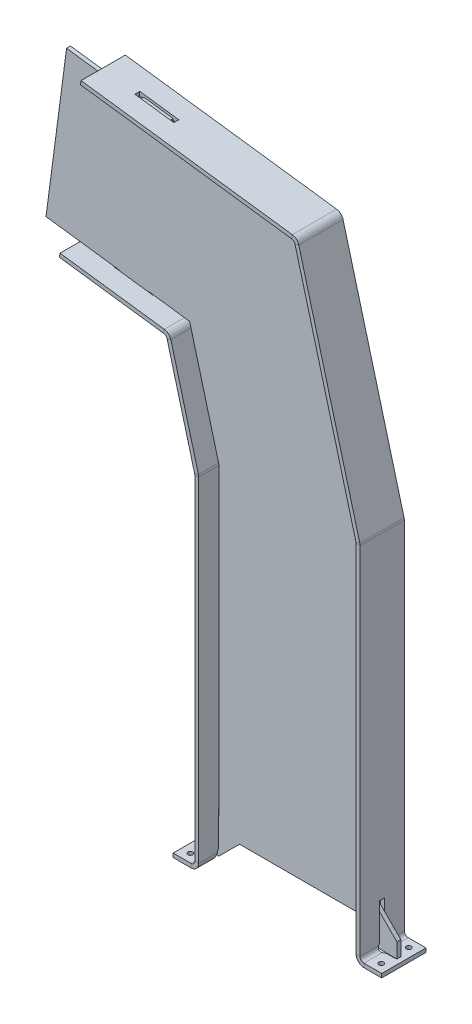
ISO-10303-21;
HEADER;
FILE_DESCRIPTION(('STEP AP214'),'2;1');
FILE_NAME('part.step','',(''),(''),'','','');
FILE_SCHEMA(('AUTOMOTIVE_DESIGN { 1 0 10303 214 1 1 1 1 }'));
ENDSEC;
DATA;
#1=APPLICATION_CONTEXT('core data for automotive mechanical design processes');
#2=APPLICATION_PROTOCOL_DEFINITION('international standard','automotive_design',2000,#1);
#3=PRODUCT_CONTEXT('',#1,'mechanical');
#4=PRODUCT('Part','Part','',(#3));
#5=PRODUCT_RELATED_PRODUCT_CATEGORY('part','',(#4));
#6=PRODUCT_DEFINITION_FORMATION('','',#4);
#7=PRODUCT_DEFINITION_CONTEXT('part definition',#1,'design');
#8=PRODUCT_DEFINITION('design','',#6,#7);
#9=PRODUCT_DEFINITION_SHAPE('','',#8);
#10=(LENGTH_UNIT() NAMED_UNIT(*) SI_UNIT(.MILLI.,.METRE.));
#11=(NAMED_UNIT(*) PLANE_ANGLE_UNIT() SI_UNIT($,.RADIAN.));
#12=(NAMED_UNIT(*) SI_UNIT($,.STERADIAN.) SOLID_ANGLE_UNIT());
#13=UNCERTAINTY_MEASURE_WITH_UNIT(LENGTH_MEASURE(1.E-05),#10,'distance_accuracy_value','');
#14=(GEOMETRIC_REPRESENTATION_CONTEXT(3) GLOBAL_UNCERTAINTY_ASSIGNED_CONTEXT((#13)) GLOBAL_UNIT_ASSIGNED_CONTEXT((#10,
#11,#12)) REPRESENTATION_CONTEXT('',''));
#15=CARTESIAN_POINT('',(0.,0.,0.));
#16=DIRECTION('',(0.,0.,1.));
#17=DIRECTION('',(1.,0.,0.));
#18=AXIS2_PLACEMENT_3D('',#15,#16,#17);
#19=CARTESIAN_POINT('',(-106.,-2.22044604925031E-13,24.5));
#20=DIRECTION('',(0.,1.,0.));
#21=DIRECTION('',(-1.,0.,0.));
#22=AXIS2_PLACEMENT_3D('',#19,#20,#21);
#23=PLANE('',#22);
#24=CARTESIAN_POINT('',(-97.0000000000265,0.,16.));
#25=DIRECTION('',(0.,-1.,0.));
#26=DIRECTION('',(0.,0.,-1.));
#27=AXIS2_PLACEMENT_3D('',#24,#25,#26);
#28=CIRCLE('',#27,2.49999999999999);
#29=CARTESIAN_POINT('',(-97.0000000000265,0.,13.5));
#30=VERTEX_POINT('',#29);
#31=EDGE_CURVE('E317',#30,#30,#28,.T.);
#32=ORIENTED_EDGE('',*,*,#31,.F.);
#33=EDGE_LOOP('',(#32));
#34=FACE_BOUND('',#33,.T.);
#35=DIRECTION('',(0.,0.,-1.));
#36=VECTOR('',#35,1.);
#37=CARTESIAN_POINT('',(-87.9,-3.88578058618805E-13,24.5));
#38=LINE('',#37,#36);
#39=CARTESIAN_POINT('',(-87.9000000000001,-8.63198401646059E-12,-1.76630442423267));
#40=VERTEX_POINT('',#39);
#41=CARTESIAN_POINT('',(-87.9,-3.88578058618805E-13,-20.5));
#42=VERTEX_POINT('',#41);
#43=EDGE_CURVE('E401',#40,#42,#38,.T.);
#44=ORIENTED_EDGE('',*,*,#43,.F.);
#45=CARTESIAN_POINT('',(-83.266150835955,-8.54871728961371E-12,12.5));
#46=DIRECTION('',(0.,-1.,0.));
#47=DIRECTION('',(-1.,0.,0.));
#48=AXIS2_PLACEMENT_3D('',#45,#46,#47);
#49=CIRCLE('',#48,15.);
#50=CARTESIAN_POINT('',(-90.749465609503,-8.65973959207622E-12,-0.5));
#51=VERTEX_POINT('',#50);
#52=EDGE_CURVE('E913',#51,#40,#49,.T.);
#53=ORIENTED_EDGE('',*,*,#52,.F.);
#54=DIRECTION('',(1.,0.,0.));
#55=VECTOR('',#54,1.);
#56=CARTESIAN_POINT('',(-148.265209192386,-2.4980018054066E-13,-0.5));
#57=LINE('',#56,#55);
#58=CARTESIAN_POINT('',(-99.,-1.94289029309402E-13,-0.5));
#59=VERTEX_POINT('',#58);
#60=EDGE_CURVE('E398',#59,#51,#57,.T.);
#61=ORIENTED_EDGE('',*,*,#60,.F.);
#62=DIRECTION('',(0.,0.,-1.));
#63=VECTOR('',#62,1.);
#64=CARTESIAN_POINT('',(-99.,-1.94289029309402E-13,4.5));
#65=LINE('',#64,#63);
#66=CARTESIAN_POINT('',(-99.,-1.94289029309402E-13,4.5));
#67=VERTEX_POINT('',#66);
#68=EDGE_CURVE('E385',#67,#59,#65,.T.);
#69=ORIENTED_EDGE('',*,*,#68,.F.);
#70=DIRECTION('',(1.,0.,0.));
#71=VECTOR('',#70,1.);
#72=CARTESIAN_POINT('',(-148.265209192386,-2.4980018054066E-13,4.5));
#73=LINE('',#72,#71);
#74=CARTESIAN_POINT('',(-90.749465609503,-8.65973959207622E-12,4.5));
#75=VERTEX_POINT('',#74);
#76=EDGE_CURVE('E355',#67,#75,#73,.T.);
#77=ORIENTED_EDGE('',*,*,#76,.T.);
#78=CARTESIAN_POINT('',(-83.2661508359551,-2.77555756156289E-13,-8.5));
#79=DIRECTION('',(0.,1.,0.));
#80=DIRECTION('',(-1.,0.,0.));
#81=AXIS2_PLACEMENT_3D('',#78,#79,#80);
#82=CIRCLE('',#81,15.);
#83=CARTESIAN_POINT('',(-87.9,-2.4980018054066E-13,5.76630442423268));
#84=VERTEX_POINT('',#83);
#85=EDGE_CURVE('E354',#75,#84,#82,.T.);
#86=ORIENTED_EDGE('',*,*,#85,.T.);
#87=DIRECTION('',(0.,0.,-1.));
#88=VECTOR('',#87,1.);
#89=CARTESIAN_POINT('',(-87.9,-3.88578058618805E-13,24.5));
#90=LINE('',#89,#88);
#91=CARTESIAN_POINT('',(-87.9,-3.88578058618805E-13,24.5));
#92=VERTEX_POINT('',#91);
#93=EDGE_CURVE('E342',#92,#84,#90,.T.);
#94=ORIENTED_EDGE('',*,*,#93,.F.);
#95=DIRECTION('',(1.,0.,0.));
#96=VECTOR('',#95,1.);
#97=CARTESIAN_POINT('',(-106.,-2.22044604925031E-13,24.5));
#98=LINE('',#97,#96);
#99=CARTESIAN_POINT('',(-106.,-2.22044604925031E-13,24.5));
#100=VERTEX_POINT('',#99);
#101=EDGE_CURVE('E346',#100,#92,#98,.T.);
#102=ORIENTED_EDGE('',*,*,#101,.F.);
#103=DIRECTION('',(0.,0.,-1.));
#104=VECTOR('',#103,1.);
#105=CARTESIAN_POINT('',(-106.,-2.22044604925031E-13,24.5));
#106=LINE('',#105,#104);
#107=CARTESIAN_POINT('',(-106.,-2.22044604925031E-13,-20.5));
#108=VERTEX_POINT('',#107);
#109=EDGE_CURVE('E352',#100,#108,#106,.T.);
#110=ORIENTED_EDGE('',*,*,#109,.T.);
#111=DIRECTION('',(1.,0.,0.));
#112=VECTOR('',#111,1.);
#113=CARTESIAN_POINT('',(-106.,-2.22044604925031E-13,-20.5));
#114=LINE('',#113,#112);
#115=EDGE_CURVE('E349',#108,#42,#114,.T.);
#116=ORIENTED_EDGE('',*,*,#115,.T.);
#117=EDGE_LOOP('',(#44,#53,#61,#69,#77,#86,#94,#102,#110,#116));
#118=FACE_BOUND('',#117,.T.);
#119=CARTESIAN_POINT('',(-97.0000000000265,0.,-12.));
#120=DIRECTION('',(0.,-1.,0.));
#121=DIRECTION('',(0.,0.,-1.));
#122=AXIS2_PLACEMENT_3D('',#119,#120,#121);
#123=CIRCLE('',#122,2.49999999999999);
#124=CARTESIAN_POINT('',(-97.0000000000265,0.,-14.5));
#125=VERTEX_POINT('',#124);
#126=EDGE_CURVE('E325',#125,#125,#123,.T.);
#127=ORIENTED_EDGE('',*,*,#126,.F.);
#128=EDGE_LOOP('',(#127));
#129=FACE_BOUND('',#128,.T.);
#130=ADVANCED_FACE('F83',(#34,#118,#129),#23,.F.);
#131=CARTESIAN_POINT('',(-87.9000000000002,3.99999999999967,-20.5));
#132=DIRECTION('',(0.,0.,-1.));
#133=DIRECTION('',(-1.,0.,0.));
#134=AXIS2_PLACEMENT_3D('',#131,#132,#133);
#135=PLANE('',#134);
#136=DIRECTION('',(0.,1.,0.));
#137=VECTOR('',#136,1.);
#138=CARTESIAN_POINT('',(-80.0000000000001,-3.88578058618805E-13,-20.5));
#139=LINE('',#138,#137);
#140=CARTESIAN_POINT('',(-80.0000000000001,7.89999999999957,-20.5));
#141=VERTEX_POINT('',#140);
#142=CARTESIAN_POINT('',(-80.,347.95994526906,-20.5));
#143=VERTEX_POINT('',#142);
#144=EDGE_CURVE('E703',#141,#143,#139,.T.);
#145=ORIENTED_EDGE('',*,*,#144,.F.);
#146=DIRECTION('',(-1.,0.,0.));
#147=VECTOR('',#146,1.);
#148=CARTESIAN_POINT('',(-80.0000000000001,7.89999999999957,-20.5));
#149=LINE('',#148,#147);
#150=CARTESIAN_POINT('',(-84.0000000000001,7.89999999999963,-20.5));
#151=VERTEX_POINT('',#150);
#152=EDGE_CURVE('E737',#141,#151,#149,.T.);
#153=ORIENTED_EDGE('',*,*,#152,.T.);
#154=DIRECTION('',(0.,1.,0.));
#155=VECTOR('',#154,1.);
#156=CARTESIAN_POINT('',(-84.0000000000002,-3.60822483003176E-13,-20.5));
#157=LINE('',#156,#155);
#158=CARTESIAN_POINT('',(-84.,347.959945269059,-20.5));
#159=VERTEX_POINT('',#158);
#160=EDGE_CURVE('E700',#151,#159,#157,.T.);
#161=ORIENTED_EDGE('',*,*,#160,.T.);
#162=DIRECTION('',(1.,0.,0.));
#163=VECTOR('',#162,1.);
#164=CARTESIAN_POINT('',(-84.,347.959945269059,-20.5));
#165=LINE('',#164,#163);
#166=EDGE_CURVE('E728',#159,#143,#165,.T.);
#167=ORIENTED_EDGE('',*,*,#166,.T.);
#168=EDGE_LOOP('',(#145,#153,#161,#167));
#169=FACE_BOUND('',#168,.T.);
#170=ADVANCED_FACE('F799',(#169),#135,.T.);
#171=CARTESIAN_POINT('',(-84.1328892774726,348.969339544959,24.5));
#172=DIRECTION('',(0.,0.,1.));
#173=DIRECTION('',(1.,0.,0.));
#174=AXIS2_PLACEMENT_3D('',#171,#172,#173);
#175=PLANE('',#174);
#176=DIRECTION('',(0.,1.,0.));
#177=VECTOR('',#176,1.);
#178=CARTESIAN_POINT('',(-80.0000000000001,-3.88578058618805E-13,24.5));
#179=LINE('',#178,#177);
#180=CARTESIAN_POINT('',(-80.0000000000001,7.89999999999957,24.5));
#181=VERTEX_POINT('',#180);
#182=CARTESIAN_POINT('',(-80.,347.95994526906,24.5));
#183=VERTEX_POINT('',#182);
#184=EDGE_CURVE('E709',#181,#183,#179,.T.);
#185=ORIENTED_EDGE('',*,*,#184,.T.);
#186=DIRECTION('',(-1.,0.,0.));
#187=VECTOR('',#186,1.);
#188=CARTESIAN_POINT('',(-80.0000000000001,347.959945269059,24.5));
#189=LINE('',#188,#187);
#190=CARTESIAN_POINT('',(-84.,347.95994526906,24.5));
#191=VERTEX_POINT('',#190);
#192=EDGE_CURVE('E723',#183,#191,#189,.T.);
#193=ORIENTED_EDGE('',*,*,#192,.T.);
#194=DIRECTION('',(0.,1.,0.));
#195=VECTOR('',#194,1.);
#196=CARTESIAN_POINT('',(-84.0000000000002,-3.60822483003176E-13,24.5));
#197=LINE('',#196,#195);
#198=CARTESIAN_POINT('',(-84.0000000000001,7.89999999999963,24.5));
#199=VERTEX_POINT('',#198);
#200=EDGE_CURVE('E706',#199,#191,#197,.T.);
#201=ORIENTED_EDGE('',*,*,#200,.F.);
#202=DIRECTION('',(1.,0.,0.));
#203=VECTOR('',#202,1.);
#204=CARTESIAN_POINT('',(-84.0000000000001,7.89999999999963,24.5));
#205=LINE('',#204,#203);
#206=EDGE_CURVE('E732',#199,#181,#205,.T.);
#207=ORIENTED_EDGE('',*,*,#206,.T.);
#208=EDGE_LOOP('',(#185,#193,#201,#207));
#209=FACE_BOUND('',#208,.T.);
#210=ADVANCED_FACE('F802',(#209),#175,.T.);
#211=CARTESIAN_POINT('',(-84.0000000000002,-3.60822483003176E-13,24.5));
#212=DIRECTION('',(-1.,0.,0.));
#213=DIRECTION('',(0.,-1.,0.));
#214=AXIS2_PLACEMENT_3D('',#211,#212,#213);
#215=PLANE('',#214);
#216=CARTESIAN_POINT('',(-84.0000000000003,3.26615083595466,12.5));
#217=DIRECTION('',(-1.,0.,0.));
#218=DIRECTION('',(0.,-1.,0.));
#219=AXIS2_PLACEMENT_3D('',#216,#217,#218);
#220=CIRCLE('',#219,15.);
#221=CARTESIAN_POINT('',(-84.0000000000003,10.7494656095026,-0.499999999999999));
#222=VERTEX_POINT('',#221);
#223=CARTESIAN_POINT('',(-84.0000000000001,7.8999999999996,-1.76630442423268));
#224=VERTEX_POINT('',#223);
#225=EDGE_CURVE('E682',#222,#224,#220,.T.);
#226=ORIENTED_EDGE('',*,*,#225,.F.);
#227=DIRECTION('',(0.,-1.,0.));
#228=VECTOR('',#227,1.);
#229=CARTESIAN_POINT('',(-84.0000000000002,-3.60822483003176E-13,-0.5));
#230=LINE('',#229,#228);
#231=CARTESIAN_POINT('',(-84.0000000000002,46.9999999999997,-0.5));
#232=VERTEX_POINT('',#231);
#233=EDGE_CURVE('E697',#232,#222,#230,.T.);
#234=ORIENTED_EDGE('',*,*,#233,.F.);
#235=DIRECTION('',(0.,0.,-1.));
#236=VECTOR('',#235,1.);
#237=CARTESIAN_POINT('',(-84.0000000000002,46.9999999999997,24.5));
#238=LINE('',#237,#236);
#239=CARTESIAN_POINT('',(-84.0000000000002,46.9999999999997,4.5));
#240=VERTEX_POINT('',#239);
#241=EDGE_CURVE('E695',#240,#232,#238,.T.);
#242=ORIENTED_EDGE('',*,*,#241,.F.);
#243=DIRECTION('',(0.,1.,0.));
#244=VECTOR('',#243,1.);
#245=CARTESIAN_POINT('',(-84.0000000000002,-3.60822483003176E-13,4.5));
#246=LINE('',#245,#244);
#247=CARTESIAN_POINT('',(-84.0000000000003,10.7494656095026,4.5));
#248=VERTEX_POINT('',#247);
#249=EDGE_CURVE('E689',#248,#240,#246,.T.);
#250=ORIENTED_EDGE('',*,*,#249,.F.);
#251=CARTESIAN_POINT('',(-84.0000000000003,3.26615083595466,-8.5));
#252=DIRECTION('',(-1.,0.,0.));
#253=DIRECTION('',(0.,-1.,0.));
#254=AXIS2_PLACEMENT_3D('',#251,#252,#253);
#255=CIRCLE('',#254,15.);
#256=CARTESIAN_POINT('',(-84.0000000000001,7.8999999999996,5.76630442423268));
#257=VERTEX_POINT('',#256);
#258=EDGE_CURVE('E693',#257,#248,#255,.T.);
#259=ORIENTED_EDGE('',*,*,#258,.F.);
#260=DIRECTION('',(0.,0.,-1.));
#261=VECTOR('',#260,1.);
#262=CARTESIAN_POINT('',(-84.0000000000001,7.89999999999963,24.5));
#263=LINE('',#262,#261);
#264=EDGE_CURVE('E731',#199,#257,#263,.T.);
#265=ORIENTED_EDGE('',*,*,#264,.F.);
#266=ORIENTED_EDGE('',*,*,#200,.T.);
#267=DIRECTION('',(0.,0.,-1.));
#268=VECTOR('',#267,1.);
#269=CARTESIAN_POINT('',(-84.,347.959945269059,24.5));
#270=LINE('',#269,#268);
#271=EDGE_CURVE('E720',#191,#159,#270,.T.);
#272=ORIENTED_EDGE('',*,*,#271,.T.);
#273=ORIENTED_EDGE('',*,*,#160,.F.);
#274=DIRECTION('',(0.,0.,-1.));
#275=VECTOR('',#274,1.);
#276=CARTESIAN_POINT('',(-84.0000000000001,7.89999999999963,24.5));
#277=LINE('',#276,#275);
#278=EDGE_CURVE('E735',#224,#151,#277,.T.);
#279=ORIENTED_EDGE('',*,*,#278,.F.);
#280=EDGE_LOOP('',(#226,#234,#242,#250,#259,#265,#266,#272,#273,#279));
#281=FACE_BOUND('',#280,.T.);
#282=ADVANCED_FACE('F806',(#281),#215,.T.);
#283=CARTESIAN_POINT('',(-80.0000000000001,-3.88578058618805E-13,24.5));
#284=DIRECTION('',(-1.,0.,0.));
#285=DIRECTION('',(0.,-1.,0.));
#286=AXIS2_PLACEMENT_3D('',#283,#284,#285);
#287=PLANE('',#286);
#288=DIRECTION('',(0.,-1.,0.));
#289=VECTOR('',#288,1.);
#290=CARTESIAN_POINT('',(-80.0000000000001,-3.88578058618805E-13,-0.5));
#291=LINE('',#290,#289);
#292=CARTESIAN_POINT('',(-80.0000000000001,46.9999999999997,-0.5));
#293=VERTEX_POINT('',#292);
#294=CARTESIAN_POINT('',(-79.9999999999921,10.7494656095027,-0.499999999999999));
#295=VERTEX_POINT('',#294);
#296=EDGE_CURVE('E717',#293,#295,#291,.T.);
#297=ORIENTED_EDGE('',*,*,#296,.T.);
#298=CARTESIAN_POINT('',(-79.9999999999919,3.26615083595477,12.5));
#299=DIRECTION('',(1.,0.,0.));
#300=DIRECTION('',(0.,-1.,0.));
#301=AXIS2_PLACEMENT_3D('',#298,#299,#300);
#302=CIRCLE('',#301,15.);
#303=CARTESIAN_POINT('',(-79.999999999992,7.8999999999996,-1.76630442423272));
#304=VERTEX_POINT('',#303);
#305=EDGE_CURVE('E683',#304,#295,#302,.T.);
#306=ORIENTED_EDGE('',*,*,#305,.F.);
#307=DIRECTION('',(0.,0.,-1.));
#308=VECTOR('',#307,1.);
#309=CARTESIAN_POINT('',(-80.0000000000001,7.89999999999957,24.5));
#310=LINE('',#309,#308);
#311=EDGE_CURVE('E740',#304,#141,#310,.T.);
#312=ORIENTED_EDGE('',*,*,#311,.T.);
#313=ORIENTED_EDGE('',*,*,#144,.T.);
#314=DIRECTION('',(0.,0.,-1.));
#315=VECTOR('',#314,1.);
#316=CARTESIAN_POINT('',(-80.0000000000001,347.959945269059,24.5));
#317=LINE('',#316,#315);
#318=EDGE_CURVE('E726',#183,#143,#317,.T.);
#319=ORIENTED_EDGE('',*,*,#318,.F.);
#320=ORIENTED_EDGE('',*,*,#184,.F.);
#321=DIRECTION('',(0.,0.,-1.));
#322=VECTOR('',#321,1.);
#323=CARTESIAN_POINT('',(-80.0000000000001,7.89999999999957,24.5));
#324=LINE('',#323,#322);
#325=CARTESIAN_POINT('',(-80.0000000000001,7.8999999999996,5.76630442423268));
#326=VERTEX_POINT('',#325);
#327=EDGE_CURVE('E736',#181,#326,#324,.T.);
#328=ORIENTED_EDGE('',*,*,#327,.T.);
#329=CARTESIAN_POINT('',(-79.9999999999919,3.26615083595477,-8.5));
#330=DIRECTION('',(1.,0.,0.));
#331=DIRECTION('',(0.,1.,0.));
#332=AXIS2_PLACEMENT_3D('',#329,#330,#331);
#333=CIRCLE('',#332,15.);
#334=CARTESIAN_POINT('',(-79.9999999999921,10.7494656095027,4.5));
#335=VERTEX_POINT('',#334);
#336=EDGE_CURVE('E606',#335,#326,#333,.T.);
#337=ORIENTED_EDGE('',*,*,#336,.F.);
#338=DIRECTION('',(0.,1.,0.));
#339=VECTOR('',#338,1.);
#340=CARTESIAN_POINT('',(-80.0000000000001,-3.88578058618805E-13,4.5));
#341=LINE('',#340,#339);
#342=CARTESIAN_POINT('',(-80.0000000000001,46.9999999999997,4.5));
#343=VERTEX_POINT('',#342);
#344=EDGE_CURVE('E712',#335,#343,#341,.T.);
#345=ORIENTED_EDGE('',*,*,#344,.T.);
#346=DIRECTION('',(0.,0.,-1.));
#347=VECTOR('',#346,1.);
#348=CARTESIAN_POINT('',(-80.0000000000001,46.9999999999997,24.5));
#349=LINE('',#348,#347);
#350=EDGE_CURVE('E714',#343,#293,#349,.T.);
#351=ORIENTED_EDGE('',*,*,#350,.T.);
#352=EDGE_LOOP('',(#297,#306,#312,#313,#319,#320,#328,#337,#345,#351));
#353=FACE_BOUND('',#352,.T.);
#354=ADVANCED_FACE('F794',(#353),#287,.F.);
#355=CARTESIAN_POINT('',(-148.265209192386,-3.60822483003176E-13,-0.5));
#356=DIRECTION('',(0.,0.,-1.));
#357=DIRECTION('',(0.,1.,0.));
#358=AXIS2_PLACEMENT_3D('',#355,#356,#357);
#359=PLANE('',#358);
#360=ORIENTED_EDGE('',*,*,#233,.T.);
#361=DIRECTION('',(1.,0.,0.));
#362=VECTOR('',#361,1.);
#363=CARTESIAN_POINT('',(-555.86370470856,10.7494656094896,-0.499999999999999));
#364=LINE('',#363,#362);
#365=EDGE_CURVE('E679',#222,#295,#364,.T.);
#366=ORIENTED_EDGE('',*,*,#365,.T.);
#367=ORIENTED_EDGE('',*,*,#296,.F.);
#368=DIRECTION('',(1.,0.,0.));
#369=VECTOR('',#368,1.);
#370=CARTESIAN_POINT('',(-148.265209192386,46.9999999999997,-0.5));
#371=LINE('',#370,#369);
#372=EDGE_CURVE('E690',#232,#293,#371,.T.);
#373=ORIENTED_EDGE('',*,*,#372,.F.);
#374=EDGE_LOOP('',(#360,#366,#367,#373));
#375=FACE_BOUND('',#374,.T.);
#376=ADVANCED_FACE('F790',(#375),#359,.F.);
#377=CARTESIAN_POINT('',(-148.265209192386,46.9999999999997,4.5));
#378=DIRECTION('',(0.,1.,0.));
#379=DIRECTION('',(0.,0.,1.));
#380=AXIS2_PLACEMENT_3D('',#377,#378,#379);
#381=PLANE('',#380);
#382=ORIENTED_EDGE('',*,*,#241,.T.);
#383=ORIENTED_EDGE('',*,*,#372,.T.);
#384=ORIENTED_EDGE('',*,*,#350,.F.);
#385=DIRECTION('',(1.,0.,0.));
#386=VECTOR('',#385,1.);
#387=CARTESIAN_POINT('',(-148.265209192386,46.9999999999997,4.5));
#388=LINE('',#387,#386);
#389=EDGE_CURVE('E686',#240,#343,#388,.T.);
#390=ORIENTED_EDGE('',*,*,#389,.F.);
#391=EDGE_LOOP('',(#382,#383,#384,#390));
#392=FACE_BOUND('',#391,.T.);
#393=ADVANCED_FACE('F793',(#392),#381,.F.);
#394=CARTESIAN_POINT('',(-148.265209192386,-3.60822483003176E-13,4.5));
#395=DIRECTION('',(0.,0.,1.));
#396=DIRECTION('',(1.,0.,0.));
#397=AXIS2_PLACEMENT_3D('',#394,#395,#396);
#398=PLANE('',#397);
#399=ORIENTED_EDGE('',*,*,#344,.F.);
#400=DIRECTION('',(1.,0.,0.));
#401=VECTOR('',#400,1.);
#402=CARTESIAN_POINT('',(-555.86370470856,10.7494656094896,4.5));
#403=LINE('',#402,#401);
#404=EDGE_CURVE('E684',#248,#335,#403,.T.);
#405=ORIENTED_EDGE('',*,*,#404,.F.);
#406=ORIENTED_EDGE('',*,*,#249,.T.);
#407=ORIENTED_EDGE('',*,*,#389,.T.);
#408=EDGE_LOOP('',(#399,#405,#406,#407));
#409=FACE_BOUND('',#408,.T.);
#410=ADVANCED_FACE('F789',(#409),#398,.F.);
#411=CARTESIAN_POINT('',(-555.86370470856,3.26615083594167,12.5));
#412=DIRECTION('',(1.,0.,0.));
#413=DIRECTION('',(0.,1.,0.));
#414=AXIS2_PLACEMENT_3D('',#411,#412,#413);
#415=CYLINDRICAL_SURFACE('',#414,15.);
#416=CARTESIAN_POINT('',(-80.0000000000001,7.8999999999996,-1.76630442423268));
#417=CARTESIAN_POINT('',(-84.0000000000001,7.8999999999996,-1.76630442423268));
#418=B_SPLINE_CURVE_WITH_KNOTS('',1,(#416,#417),.UNSPECIFIED.,.F.,.F.,(2,2),(0.,1.),.UNSPECIFIED.);
#419=EDGE_CURVE('E297',#304,#224,#418,.T.);
#420=ORIENTED_EDGE('',*,*,#419,.F.);
#421=ORIENTED_EDGE('',*,*,#305,.T.);
#422=ORIENTED_EDGE('',*,*,#365,.F.);
#423=ORIENTED_EDGE('',*,*,#225,.T.);
#424=EDGE_LOOP('',(#420,#421,#422,#423));
#425=FACE_BOUND('',#424,.T.);
#426=ADVANCED_FACE('F780',(#425),#415,.F.);
#427=CARTESIAN_POINT('',(-555.86370470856,3.26615083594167,-8.5));
#428=DIRECTION('',(1.,0.,0.));
#429=DIRECTION('',(0.,1.,0.));
#430=AXIS2_PLACEMENT_3D('',#427,#428,#429);
#431=CYLINDRICAL_SURFACE('',#430,15.);
#432=CARTESIAN_POINT('',(-84.0000000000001,7.8999999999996,5.76630442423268));
#433=CARTESIAN_POINT('',(-80.0000000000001,7.8999999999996,5.76630442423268));
#434=B_SPLINE_CURVE_WITH_KNOTS('',1,(#432,#433),.UNSPECIFIED.,.F.,.F.,(2,2),(0.,1.),.UNSPECIFIED.);
#435=EDGE_CURVE('E584',#257,#326,#434,.T.);
#436=ORIENTED_EDGE('',*,*,#435,.F.);
#437=ORIENTED_EDGE('',*,*,#258,.T.);
#438=ORIENTED_EDGE('',*,*,#404,.T.);
#439=ORIENTED_EDGE('',*,*,#336,.T.);
#440=EDGE_LOOP('',(#436,#437,#438,#439));
#441=FACE_BOUND('',#440,.T.);
#442=ADVANCED_FACE('F85',(#441),#431,.F.);
#443=CARTESIAN_POINT('',(-221.506661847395,470.529153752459,24.5));
#444=DIRECTION('',(-0.99144486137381,0.130526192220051,0.));
#445=DIRECTION('',(-0.130526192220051,-0.991444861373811,0.));
#446=AXIS2_PLACEMENT_3D('',#443,#444,#445);
#447=PLANE('',#446);
#448=DIRECTION('',(0.,0.,-1.));
#449=VECTOR('',#448,1.);
#450=CARTESIAN_POINT('',(-220.984557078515,474.494933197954,24.5));
#451=LINE('',#450,#449);
#452=CARTESIAN_POINT('',(-220.984557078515,474.494933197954,24.5));
#453=VERTEX_POINT('',#452);
#454=CARTESIAN_POINT('',(-220.984557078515,474.494933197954,-20.5));
#455=VERTEX_POINT('',#454);
#456=EDGE_CURVE('E676',#453,#455,#451,.T.);
#457=ORIENTED_EDGE('',*,*,#456,.T.);
#458=DIRECTION('',(0.130526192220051,0.991444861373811,0.));
#459=VECTOR('',#458,1.);
#460=CARTESIAN_POINT('',(-221.506661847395,470.529153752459,-20.5));
#461=LINE('',#460,#459);
#462=CARTESIAN_POINT('',(-221.506661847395,470.529153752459,-20.5));
#463=VERTEX_POINT('',#462);
#464=EDGE_CURVE('E664',#463,#455,#461,.T.);
#465=ORIENTED_EDGE('',*,*,#464,.F.);
#466=DIRECTION('',(0.,0.,-1.));
#467=VECTOR('',#466,1.);
#468=CARTESIAN_POINT('',(-221.506661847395,470.529153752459,24.5));
#469=LINE('',#468,#467);
#470=CARTESIAN_POINT('',(-221.506661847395,470.529153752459,24.5));
#471=VERTEX_POINT('',#470);
#472=EDGE_CURVE('E651',#471,#463,#469,.T.);
#473=ORIENTED_EDGE('',*,*,#472,.F.);
#474=DIRECTION('',(0.130526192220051,0.991444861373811,0.));
#475=VECTOR('',#474,1.);
#476=CARTESIAN_POINT('',(-221.506661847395,470.529153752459,24.5));
#477=LINE('',#476,#475);
#478=EDGE_CURVE('E673',#471,#453,#477,.T.);
#479=ORIENTED_EDGE('',*,*,#478,.T.);
#480=EDGE_LOOP('',(#457,#465,#473,#479));
#481=FACE_BOUND('',#480,.T.);
#482=ADVANCED_FACE('F863',(#481),#447,.T.);
#483=CARTESIAN_POINT('',(-112.19809098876,453.710098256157,-20.5));
#484=DIRECTION('',(0.,0.,-1.));
#485=DIRECTION('',(-1.,0.,0.));
#486=AXIS2_PLACEMENT_3D('',#483,#484,#485);
#487=PLANE('',#486);
#488=DIRECTION('',(-0.991444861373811,0.130526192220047,0.));
#489=VECTOR('',#488,1.);
#490=CARTESIAN_POINT('',(-109.700592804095,459.8441213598,-20.5));
#491=LINE('',#490,#489);
#492=CARTESIAN_POINT('',(-114.934044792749,460.533118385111,-20.5));
#493=VERTEX_POINT('',#492);
#494=EDGE_CURVE('E658',#493,#455,#491,.T.);
#495=ORIENTED_EDGE('',*,*,#494,.F.);
#496=DIRECTION('',(-0.130526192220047,-0.991444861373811,0.));
#497=VECTOR('',#496,1.);
#498=CARTESIAN_POINT('',(-114.934044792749,460.533118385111,-20.5));
#499=LINE('',#498,#497);
#500=CARTESIAN_POINT('',(-115.45614956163,456.567338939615,-20.5));
#501=VERTEX_POINT('',#500);
#502=EDGE_CURVE('E670',#493,#501,#499,.T.);
#503=ORIENTED_EDGE('',*,*,#502,.T.);
#504=DIRECTION('',(-0.991444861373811,0.130526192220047,0.));
#505=VECTOR('',#504,1.);
#506=CARTESIAN_POINT('',(-110.222697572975,455.878341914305,-20.5));
#507=LINE('',#506,#505);
#508=EDGE_CURVE('E667',#501,#463,#507,.T.);
#509=ORIENTED_EDGE('',*,*,#508,.T.);
#510=ORIENTED_EDGE('',*,*,#464,.T.);
#511=EDGE_LOOP('',(#495,#503,#509,#510));
#512=FACE_BOUND('',#511,.T.);
#513=ADVANCED_FACE('F859',(#512),#487,.T.);
#514=CARTESIAN_POINT('',(-109.700592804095,459.8441213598,24.5));
#515=DIRECTION('',(-0.130526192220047,-0.991444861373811,0.));
#516=DIRECTION('',(0.991444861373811,-0.130526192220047,0.));
#517=AXIS2_PLACEMENT_3D('',#514,#515,#516);
#518=PLANE('',#517);
#519=DIRECTION('',(-0.991444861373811,0.130526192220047,0.));
#520=VECTOR('',#519,1.);
#521=CARTESIAN_POINT('',(-109.700592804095,459.8441213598,4.5));
#522=LINE('',#521,#520);
#523=CARTESIAN_POINT('',(-146.62619247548,464.70546878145,4.5));
#524=VERTEX_POINT('',#523);
#525=CARTESIAN_POINT('',(-186.283986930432,469.926516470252,4.5));
#526=VERTEX_POINT('',#525);
#527=EDGE_CURVE('E330',#524,#526,#522,.T.);
#528=ORIENTED_EDGE('',*,*,#527,.T.);
#529=DIRECTION('',(0.,0.,-1.));
#530=VECTOR('',#529,1.);
#531=CARTESIAN_POINT('',(-186.283986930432,469.926516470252,24.5));
#532=LINE('',#531,#530);
#533=CARTESIAN_POINT('',(-186.283986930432,469.926516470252,-0.5));
#534=VERTEX_POINT('',#533);
#535=EDGE_CURVE('E304',#526,#534,#532,.T.);
#536=ORIENTED_EDGE('',*,*,#535,.T.);
#537=DIRECTION('',(0.991444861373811,-0.130526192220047,0.));
#538=VECTOR('',#537,1.);
#539=CARTESIAN_POINT('',(-109.700592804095,459.8441213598,-0.5));
#540=LINE('',#539,#538);
#541=CARTESIAN_POINT('',(-146.62619247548,464.70546878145,-0.5));
#542=VERTEX_POINT('',#541);
#543=EDGE_CURVE('E338',#534,#542,#540,.T.);
#544=ORIENTED_EDGE('',*,*,#543,.T.);
#545=DIRECTION('',(0.,0.,1.));
#546=VECTOR('',#545,1.);
#547=CARTESIAN_POINT('',(-146.62619247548,464.70546878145,24.5));
#548=LINE('',#547,#546);
#549=EDGE_CURVE('E335',#542,#524,#548,.T.);
#550=ORIENTED_EDGE('',*,*,#549,.T.);
#551=EDGE_LOOP('',(#528,#536,#544,#550));
#552=FACE_BOUND('',#551,.T.);
#553=DIRECTION('',(0.,0.,-1.));
#554=VECTOR('',#553,1.);
#555=CARTESIAN_POINT('',(-114.934044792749,460.533118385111,24.5));
#556=LINE('',#555,#554);
#557=CARTESIAN_POINT('',(-114.934044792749,460.533118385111,24.5));
#558=VERTEX_POINT('',#557);
#559=EDGE_CURVE('E661',#558,#493,#556,.T.);
#560=ORIENTED_EDGE('',*,*,#559,.T.);
#561=ORIENTED_EDGE('',*,*,#494,.T.);
#562=ORIENTED_EDGE('',*,*,#456,.F.);
#563=DIRECTION('',(-0.991444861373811,0.130526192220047,0.));
#564=VECTOR('',#563,1.);
#565=CARTESIAN_POINT('',(-109.700592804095,459.8441213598,24.5));
#566=LINE('',#565,#564);
#567=EDGE_CURVE('E656',#558,#453,#566,.T.);
#568=ORIENTED_EDGE('',*,*,#567,.F.);
#569=EDGE_LOOP('',(#560,#561,#562,#568));
#570=FACE_BOUND('',#569,.T.);
#571=ADVANCED_FACE('F855',(#552,#570),#518,.F.);
#572=CARTESIAN_POINT('',(-115.965201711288,452.700703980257,24.5));
#573=DIRECTION('',(0.,0.,1.));
#574=DIRECTION('',(1.,0.,0.));
#575=AXIS2_PLACEMENT_3D('',#572,#573,#574);
#576=PLANE('',#575);
#577=ORIENTED_EDGE('',*,*,#567,.T.);
#578=ORIENTED_EDGE('',*,*,#478,.F.);
#579=DIRECTION('',(-0.991444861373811,0.130526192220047,0.));
#580=VECTOR('',#579,1.);
#581=CARTESIAN_POINT('',(-110.222697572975,455.878341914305,24.5));
#582=LINE('',#581,#580);
#583=CARTESIAN_POINT('',(-115.45614956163,456.567338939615,24.5));
#584=VERTEX_POINT('',#583);
#585=EDGE_CURVE('E648',#584,#471,#582,.T.);
#586=ORIENTED_EDGE('',*,*,#585,.F.);
#587=DIRECTION('',(0.130526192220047,0.991444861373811,0.));
#588=VECTOR('',#587,1.);
#589=CARTESIAN_POINT('',(-115.45614956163,456.567338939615,24.5));
#590=LINE('',#589,#588);
#591=EDGE_CURVE('E653',#584,#558,#590,.T.);
#592=ORIENTED_EDGE('',*,*,#591,.T.);
#593=EDGE_LOOP('',(#577,#578,#586,#592));
#594=FACE_BOUND('',#593,.T.);
#595=ADVANCED_FACE('F852',(#594),#576,.T.);
#596=CARTESIAN_POINT('',(-110.222697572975,455.878341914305,24.5));
#597=DIRECTION('',(-0.130526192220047,-0.991444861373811,0.));
#598=DIRECTION('',(0.991444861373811,-0.130526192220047,0.));
#599=AXIS2_PLACEMENT_3D('',#596,#597,#598);
#600=PLANE('',#599);
#601=DIRECTION('',(0.,0.,-1.));
#602=VECTOR('',#601,1.);
#603=CARTESIAN_POINT('',(-186.806091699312,465.960737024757,24.5));
#604=LINE('',#603,#602);
#605=CARTESIAN_POINT('',(-186.806091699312,465.960737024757,4.5));
#606=VERTEX_POINT('',#605);
#607=CARTESIAN_POINT('',(-186.806091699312,465.960737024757,-0.5));
#608=VERTEX_POINT('',#607);
#609=EDGE_CURVE('E13',#606,#608,#604,.T.);
#610=ORIENTED_EDGE('',*,*,#609,.F.);
#611=DIRECTION('',(-0.991444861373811,0.130526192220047,0.));
#612=VECTOR('',#611,1.);
#613=CARTESIAN_POINT('',(-110.222697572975,455.878341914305,4.5));
#614=LINE('',#613,#612);
#615=CARTESIAN_POINT('',(-147.14829724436,460.739689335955,4.5));
#616=VERTEX_POINT('',#615);
#617=EDGE_CURVE('E291',#616,#606,#614,.T.);
#618=ORIENTED_EDGE('',*,*,#617,.F.);
#619=DIRECTION('',(0.,0.,1.));
#620=VECTOR('',#619,1.);
#621=CARTESIAN_POINT('',(-147.14829724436,460.739689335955,24.5));
#622=LINE('',#621,#620);
#623=CARTESIAN_POINT('',(-147.14829724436,460.739689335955,-0.5));
#624=VERTEX_POINT('',#623);
#625=EDGE_CURVE('E296',#624,#616,#622,.T.);
#626=ORIENTED_EDGE('',*,*,#625,.F.);
#627=DIRECTION('',(0.991444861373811,-0.130526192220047,0.));
#628=VECTOR('',#627,1.);
#629=CARTESIAN_POINT('',(-110.222697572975,455.878341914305,-0.5));
#630=LINE('',#629,#628);
#631=EDGE_CURVE('E93',#608,#624,#630,.T.);
#632=ORIENTED_EDGE('',*,*,#631,.F.);
#633=EDGE_LOOP('',(#610,#618,#626,#632));
#634=FACE_BOUND('',#633,.T.);
#635=ORIENTED_EDGE('',*,*,#472,.T.);
#636=ORIENTED_EDGE('',*,*,#508,.F.);
#637=DIRECTION('',(0.,0.,-1.));
#638=VECTOR('',#637,1.);
#639=CARTESIAN_POINT('',(-115.45614956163,456.567338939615,24.5));
#640=LINE('',#639,#638);
#641=EDGE_CURVE('E639',#584,#501,#640,.T.);
#642=ORIENTED_EDGE('',*,*,#641,.F.);
#643=ORIENTED_EDGE('',*,*,#585,.T.);
#644=EDGE_LOOP('',(#635,#636,#642,#643));
#645=FACE_BOUND('',#644,.T.);
#646=ADVANCED_FACE('F309',(#634,#645),#600,.T.);
#647=CARTESIAN_POINT('',(-115.965201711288,452.700703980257,-20.5));
#648=DIRECTION('',(0.,0.,1.));
#649=DIRECTION('',(1.,0.,0.));
#650=AXIS2_PLACEMENT_3D('',#647,#648,#649);
#651=PLANE('',#650);
#652=CARTESIAN_POINT('',(-115.965201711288,452.700703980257,-20.5));
#653=DIRECTION('',(0.,0.,1.));
#654=DIRECTION('',(1.,0.,0.));
#655=AXIS2_PLACEMENT_3D('',#652,#653,#654);
#656=CIRCLE('',#655,7.9);
#657=CARTESIAN_POINT('',(-108.334387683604,454.745374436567,-20.5));
#658=VERTEX_POINT('',#657);
#659=EDGE_CURVE('E645',#493,#658,#656,.F.);
#660=ORIENTED_EDGE('',*,*,#659,.T.);
#661=DIRECTION('',(0.965925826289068,0.258819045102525,0.));
#662=VECTOR('',#661,1.);
#663=CARTESIAN_POINT('',(-112.19809098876,453.710098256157,-20.5));
#664=LINE('',#663,#662);
#665=CARTESIAN_POINT('',(-112.19809098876,453.710098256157,-20.5));
#666=VERTEX_POINT('',#665);
#667=EDGE_CURVE('E603',#666,#658,#664,.T.);
#668=ORIENTED_EDGE('',*,*,#667,.F.);
#669=CARTESIAN_POINT('',(-115.965201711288,452.700703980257,-20.5));
#670=DIRECTION('',(0.,0.,-1.));
#671=DIRECTION('',(-1.,0.,0.));
#672=AXIS2_PLACEMENT_3D('',#669,#670,#671);
#673=CIRCLE('',#672,3.89999999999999);
#674=EDGE_CURVE('E637',#501,#666,#673,.T.);
#675=ORIENTED_EDGE('',*,*,#674,.F.);
#676=ORIENTED_EDGE('',*,*,#502,.F.);
#677=EDGE_LOOP('',(#660,#668,#675,#676));
#678=FACE_BOUND('',#677,.T.);
#679=ADVANCED_FACE('F845',(#678),#651,.F.);
#680=CARTESIAN_POINT('',(-115.965201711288,452.700703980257,-43.866166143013));
#681=DIRECTION('',(0.,0.,1.));
#682=DIRECTION('',(1.,0.,0.));
#683=AXIS2_PLACEMENT_3D('',#680,#681,#682);
#684=CYLINDRICAL_SURFACE('',#683,7.9);
#685=ORIENTED_EDGE('',*,*,#559,.F.);
#686=CARTESIAN_POINT('',(-115.965201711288,452.700703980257,24.5));
#687=DIRECTION('',(0.,0.,1.));
#688=DIRECTION('',(1.,0.,0.));
#689=AXIS2_PLACEMENT_3D('',#686,#687,#688);
#690=CIRCLE('',#689,7.9);
#691=CARTESIAN_POINT('',(-108.334387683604,454.745374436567,24.5));
#692=VERTEX_POINT('',#691);
#693=EDGE_CURVE('E641',#692,#558,#690,.T.);
#694=ORIENTED_EDGE('',*,*,#693,.F.);
#695=DIRECTION('',(0.,0.,-1.));
#696=VECTOR('',#695,1.);
#697=CARTESIAN_POINT('',(-108.334387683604,454.745374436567,24.5));
#698=LINE('',#697,#696);
#699=EDGE_CURVE('E643',#692,#658,#698,.T.);
#700=ORIENTED_EDGE('',*,*,#699,.T.);
#701=ORIENTED_EDGE('',*,*,#659,.F.);
#702=EDGE_LOOP('',(#685,#694,#700,#701));
#703=FACE_BOUND('',#702,.T.);
#704=ADVANCED_FACE('F841',(#703),#684,.T.);
#705=CARTESIAN_POINT('',(-115.965201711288,452.700703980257,24.5));
#706=DIRECTION('',(0.,0.,-1.));
#707=DIRECTION('',(-1.,0.,0.));
#708=AXIS2_PLACEMENT_3D('',#705,#706,#707);
#709=PLANE('',#708);
#710=DIRECTION('',(-0.965925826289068,-0.258819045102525,0.));
#711=VECTOR('',#710,1.);
#712=CARTESIAN_POINT('',(-108.334387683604,454.745374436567,24.5));
#713=LINE('',#712,#711);
#714=CARTESIAN_POINT('',(-112.19809098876,453.710098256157,24.5));
#715=VERTEX_POINT('',#714);
#716=EDGE_CURVE('E622',#692,#715,#713,.T.);
#717=ORIENTED_EDGE('',*,*,#716,.F.);
#718=ORIENTED_EDGE('',*,*,#693,.T.);
#719=ORIENTED_EDGE('',*,*,#591,.F.);
#720=CARTESIAN_POINT('',(-115.965201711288,452.700703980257,24.5));
#721=DIRECTION('',(0.,0.,1.));
#722=DIRECTION('',(1.,0.,0.));
#723=AXIS2_PLACEMENT_3D('',#720,#721,#722);
#724=CIRCLE('',#723,3.89999999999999);
#725=EDGE_CURVE('E634',#715,#584,#724,.T.);
#726=ORIENTED_EDGE('',*,*,#725,.F.);
#727=EDGE_LOOP('',(#717,#718,#719,#726));
#728=FACE_BOUND('',#727,.T.);
#729=ADVANCED_FACE('F837',(#728),#709,.F.);
#730=CARTESIAN_POINT('',(-115.965201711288,452.700703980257,-43.866166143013));
#731=DIRECTION('',(0.,0.,1.));
#732=DIRECTION('',(1.,0.,0.));
#733=AXIS2_PLACEMENT_3D('',#730,#731,#732);
#734=CYLINDRICAL_SURFACE('',#733,3.9);
#735=ORIENTED_EDGE('',*,*,#641,.T.);
#736=ORIENTED_EDGE('',*,*,#674,.T.);
#737=DIRECTION('',(0.,0.,-1.));
#738=VECTOR('',#737,1.);
#739=CARTESIAN_POINT('',(-112.19809098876,453.710098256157,24.5));
#740=LINE('',#739,#738);
#741=EDGE_CURVE('E631',#715,#666,#740,.T.);
#742=ORIENTED_EDGE('',*,*,#741,.F.);
#743=ORIENTED_EDGE('',*,*,#725,.T.);
#744=EDGE_LOOP('',(#735,#736,#742,#743));
#745=FACE_BOUND('',#744,.T.);
#746=ADVANCED_FACE('F833',(#745),#734,.F.);
#747=CARTESIAN_POINT('',(-83.8637033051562,347.96472381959,24.5));
#748=DIRECTION('',(-0.96592582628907,-0.258819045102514,0.));
#749=DIRECTION('',(0.258819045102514,-0.96592582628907,0.));
#750=AXIS2_PLACEMENT_3D('',#747,#748,#749);
#751=PLANE('',#750);
#752=ORIENTED_EDGE('',*,*,#741,.T.);
#753=DIRECTION('',(-0.258819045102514,0.965925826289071,0.));
#754=VECTOR('',#753,1.);
#755=CARTESIAN_POINT('',(-83.8637033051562,347.96472381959,-20.5));
#756=LINE('',#755,#754);
#757=CARTESIAN_POINT('',(-84.1328892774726,348.969339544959,-20.5));
#758=VERTEX_POINT('',#757);
#759=EDGE_CURVE('E607',#758,#666,#756,.T.);
#760=ORIENTED_EDGE('',*,*,#759,.F.);
#761=DIRECTION('',(0.,0.,-1.));
#762=VECTOR('',#761,1.);
#763=CARTESIAN_POINT('',(-84.1328892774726,348.969339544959,24.5));
#764=LINE('',#763,#762);
#765=CARTESIAN_POINT('',(-84.1328892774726,348.969339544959,24.5));
#766=VERTEX_POINT('',#765);
#767=EDGE_CURVE('E599',#766,#758,#764,.T.);
#768=ORIENTED_EDGE('',*,*,#767,.F.);
#769=DIRECTION('',(-0.258819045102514,0.965925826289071,0.));
#770=VECTOR('',#769,1.);
#771=CARTESIAN_POINT('',(-83.8637033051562,347.96472381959,24.5));
#772=LINE('',#771,#770);
#773=EDGE_CURVE('E628',#766,#715,#772,.T.);
#774=ORIENTED_EDGE('',*,*,#773,.T.);
#775=EDGE_LOOP('',(#752,#760,#768,#774));
#776=FACE_BOUND('',#775,.T.);
#777=ADVANCED_FACE('F829',(#776),#751,.T.);
#778=CARTESIAN_POINT('',(-115.45614956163,456.567338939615,24.5));
#779=DIRECTION('',(0.,0.,1.));
#780=DIRECTION('',(1.,0.,0.));
#781=AXIS2_PLACEMENT_3D('',#778,#779,#780);
#782=PLANE('',#781);
#783=DIRECTION('',(-0.258819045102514,0.965925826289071,0.));
#784=VECTOR('',#783,1.);
#785=CARTESIAN_POINT('',(-80.,349.,24.5));
#786=LINE('',#785,#784);
#787=CARTESIAN_POINT('',(-80.2691859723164,350.004615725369,24.5));
#788=VERTEX_POINT('',#787);
#789=EDGE_CURVE('E625',#788,#692,#786,.T.);
#790=ORIENTED_EDGE('',*,*,#789,.T.);
#791=ORIENTED_EDGE('',*,*,#716,.T.);
#792=ORIENTED_EDGE('',*,*,#773,.F.);
#793=DIRECTION('',(0.965925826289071,0.258819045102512,0.));
#794=VECTOR('',#793,1.);
#795=CARTESIAN_POINT('',(-84.1328892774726,348.969339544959,24.5));
#796=LINE('',#795,#794);
#797=EDGE_CURVE('E619',#766,#788,#796,.T.);
#798=ORIENTED_EDGE('',*,*,#797,.T.);
#799=EDGE_LOOP('',(#790,#791,#792,#798));
#800=FACE_BOUND('',#799,.T.);
#801=ADVANCED_FACE('F825',(#800),#782,.T.);
#802=CARTESIAN_POINT('',(-80.,349.,24.5));
#803=DIRECTION('',(-0.96592582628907,-0.258819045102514,0.));
#804=DIRECTION('',(0.258819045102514,-0.96592582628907,0.));
#805=AXIS2_PLACEMENT_3D('',#802,#803,#804);
#806=PLANE('',#805);
#807=DIRECTION('',(0.,0.,-1.));
#808=VECTOR('',#807,1.);
#809=CARTESIAN_POINT('',(-80.2691859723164,350.004615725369,24.5));
#810=LINE('',#809,#808);
#811=CARTESIAN_POINT('',(-80.2691859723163,350.004615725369,-20.5));
#812=VERTEX_POINT('',#811);
#813=EDGE_CURVE('E616',#788,#812,#810,.T.);
#814=ORIENTED_EDGE('',*,*,#813,.T.);
#815=DIRECTION('',(-0.258819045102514,0.965925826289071,0.));
#816=VECTOR('',#815,1.);
#817=CARTESIAN_POINT('',(-80.,349.,-20.5));
#818=LINE('',#817,#816);
#819=EDGE_CURVE('E613',#812,#658,#818,.T.);
#820=ORIENTED_EDGE('',*,*,#819,.T.);
#821=ORIENTED_EDGE('',*,*,#699,.F.);
#822=ORIENTED_EDGE('',*,*,#789,.F.);
#823=EDGE_LOOP('',(#814,#820,#821,#822));
#824=FACE_BOUND('',#823,.T.);
#825=ADVANCED_FACE('F821',(#824),#806,.F.);
#826=CARTESIAN_POINT('',(-84.,347.95994526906,-20.5));
#827=DIRECTION('',(0.,0.,-1.));
#828=DIRECTION('',(-1.,0.,0.));
#829=AXIS2_PLACEMENT_3D('',#826,#827,#828);
#830=PLANE('',#829);
#831=ORIENTED_EDGE('',*,*,#819,.F.);
#832=DIRECTION('',(-0.965925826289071,-0.258819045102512,0.));
#833=VECTOR('',#832,1.);
#834=CARTESIAN_POINT('',(-80.2691859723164,350.004615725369,-20.5));
#835=LINE('',#834,#833);
#836=EDGE_CURVE('E610',#812,#758,#835,.T.);
#837=ORIENTED_EDGE('',*,*,#836,.T.);
#838=ORIENTED_EDGE('',*,*,#759,.T.);
#839=ORIENTED_EDGE('',*,*,#667,.T.);
#840=EDGE_LOOP('',(#831,#837,#838,#839));
#841=FACE_BOUND('',#840,.T.);
#842=ADVANCED_FACE('F817',(#841),#830,.T.);
#843=CARTESIAN_POINT('',(-87.9,347.959945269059,24.5));
#844=DIRECTION('',(0.,0.,-1.));
#845=DIRECTION('',(-1.,0.,0.));
#846=AXIS2_PLACEMENT_3D('',#843,#844,#845);
#847=PLANE('',#846);
#848=ORIENTED_EDGE('',*,*,#192,.F.);
#849=CARTESIAN_POINT('',(-87.9,347.959945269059,24.5));
#850=DIRECTION('',(0.,0.,1.));
#851=DIRECTION('',(1.,0.,0.));
#852=AXIS2_PLACEMENT_3D('',#849,#850,#851);
#853=CIRCLE('',#852,7.9);
#854=EDGE_CURVE('E507',#183,#788,#853,.T.);
#855=ORIENTED_EDGE('',*,*,#854,.T.);
#856=ORIENTED_EDGE('',*,*,#797,.F.);
#857=CARTESIAN_POINT('',(-87.9,347.959945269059,24.5));
#858=DIRECTION('',(0.,0.,1.));
#859=DIRECTION('',(1.,0.,0.));
#860=AXIS2_PLACEMENT_3D('',#857,#858,#859);
#861=CIRCLE('',#860,3.9);
#862=EDGE_CURVE('E588',#191,#766,#861,.T.);
#863=ORIENTED_EDGE('',*,*,#862,.F.);
#864=EDGE_LOOP('',(#848,#855,#856,#863));
#865=FACE_BOUND('',#864,.T.);
#866=ADVANCED_FACE('F820',(#865),#847,.F.);
#867=CARTESIAN_POINT('',(-87.9,347.959945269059,-20.5));
#868=DIRECTION('',(0.,0.,1.));
#869=DIRECTION('',(1.,0.,0.));
#870=AXIS2_PLACEMENT_3D('',#867,#868,#869);
#871=PLANE('',#870);
#872=CARTESIAN_POINT('',(-87.9,347.959945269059,-20.5));
#873=DIRECTION('',(0.,0.,1.));
#874=DIRECTION('',(1.,0.,0.));
#875=AXIS2_PLACEMENT_3D('',#872,#873,#874);
#876=CIRCLE('',#875,7.9);
#877=EDGE_CURVE('E597',#812,#143,#876,.F.);
#878=ORIENTED_EDGE('',*,*,#877,.T.);
#879=ORIENTED_EDGE('',*,*,#166,.F.);
#880=CARTESIAN_POINT('',(-87.9,347.959945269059,-20.5));
#881=DIRECTION('',(0.,0.,-1.));
#882=DIRECTION('',(-1.,0.,0.));
#883=AXIS2_PLACEMENT_3D('',#880,#881,#882);
#884=CIRCLE('',#883,3.9);
#885=EDGE_CURVE('E596',#758,#159,#884,.T.);
#886=ORIENTED_EDGE('',*,*,#885,.F.);
#887=ORIENTED_EDGE('',*,*,#836,.F.);
#888=EDGE_LOOP('',(#878,#879,#886,#887));
#889=FACE_BOUND('',#888,.T.);
#890=ADVANCED_FACE('F868',(#889),#871,.F.);
#891=CARTESIAN_POINT('',(-87.9,347.959945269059,-43.2721139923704));
#892=DIRECTION('',(0.,0.,1.));
#893=DIRECTION('',(1.,0.,0.));
#894=AXIS2_PLACEMENT_3D('',#891,#892,#893);
#895=CYLINDRICAL_SURFACE('',#894,3.9);
#896=ORIENTED_EDGE('',*,*,#767,.T.);
#897=ORIENTED_EDGE('',*,*,#885,.T.);
#898=ORIENTED_EDGE('',*,*,#271,.F.);
#899=ORIENTED_EDGE('',*,*,#862,.T.);
#900=EDGE_LOOP('',(#896,#897,#898,#899));
#901=FACE_BOUND('',#900,.T.);
#902=ADVANCED_FACE('F555',(#901),#895,.F.);
#903=CARTESIAN_POINT('',(-87.9,347.959945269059,-43.2721139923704));
#904=DIRECTION('',(0.,0.,1.));
#905=DIRECTION('',(1.,0.,0.));
#906=AXIS2_PLACEMENT_3D('',#903,#904,#905);
#907=CYLINDRICAL_SURFACE('',#906,7.9);
#908=ORIENTED_EDGE('',*,*,#813,.F.);
#909=ORIENTED_EDGE('',*,*,#854,.F.);
#910=ORIENTED_EDGE('',*,*,#318,.T.);
#911=ORIENTED_EDGE('',*,*,#877,.F.);
#912=EDGE_LOOP('',(#908,#909,#910,#911));
#913=FACE_BOUND('',#912,.T.);
#914=ADVANCED_FACE('F553',(#913),#907,.T.);
#915=CARTESIAN_POINT('',(-80.0000000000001,7.8999999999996,5.76630442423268));
#916=CARTESIAN_POINT('',(-80.0000000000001,6.74101550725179,6.0104177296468));
#917=CARTESIAN_POINT('',(-80.2559240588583,5.65337260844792,6.19297808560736));
#918=CARTESIAN_POINT('',(-80.8827212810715,4.23460680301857,6.37643829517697));
#919=CARTESIAN_POINT('',(-81.1318296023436,3.79654381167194,6.4224200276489));
#920=CARTESIAN_POINT('',(-81.547613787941,3.19720187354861,6.4686351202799));
#921=CARTESIAN_POINT('',(-81.6932370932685,3.00699081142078,6.48024723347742));
#922=CARTESIAN_POINT('',(-81.9200678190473,2.73625404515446,6.49197602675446));
#923=CARTESIAN_POINT('',(-81.9970784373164,2.64843549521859,6.49493739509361));
#924=CARTESIAN_POINT('',(-82.1144373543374,2.52035149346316,6.49795710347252));
#925=CARTESIAN_POINT('',(-82.1538642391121,2.47826396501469,6.49872661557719));
#926=CARTESIAN_POINT('',(-82.2332905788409,2.39530181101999,6.4997915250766));
#927=CARTESIAN_POINT('',(-82.2750275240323,2.35268950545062,6.50008943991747));
#928=CARTESIAN_POINT('',(-82.9299974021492,1.69764897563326,6.50103842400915));
#929=CARTESIAN_POINT('',(-83.7102968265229,1.12313400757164,6.44033160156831));
#930=CARTESIAN_POINT('',(-85.5958831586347,0.273036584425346,6.19571798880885));
#931=CARTESIAN_POINT('',(-86.700736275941,-3.88578058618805E-13,6.01237227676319));
#932=CARTESIAN_POINT('',(-87.9,-3.88578058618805E-13,5.76630442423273));
#933=CARTESIAN_POINT('',(-84.0000000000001,7.8999999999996,5.76630442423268));
#934=CARTESIAN_POINT('',(-84.0000000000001,7.32796133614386,6.01036728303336));
#935=CARTESIAN_POINT('',(-84.1263422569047,6.7909054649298,6.19297808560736));
#936=CARTESIAN_POINT('',(-84.4357737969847,6.09050209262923,6.37643829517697));
#937=CARTESIAN_POINT('',(-84.558751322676,5.87424314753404,6.4224200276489));
#938=CARTESIAN_POINT('',(-84.7640118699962,5.57836548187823,6.4686351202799));
#939=CARTESIAN_POINT('',(-84.8359018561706,5.48446381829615,6.48024723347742));
#940=CARTESIAN_POINT('',(-84.947881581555,5.35080895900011,6.49197602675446));
#941=CARTESIAN_POINT('',(-84.9858994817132,5.30745549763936,6.49493739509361));
#942=CARTESIAN_POINT('',(-85.0438361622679,5.24422415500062,6.49795710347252));
#943=CARTESIAN_POINT('',(-85.0633000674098,5.22344676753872,6.49872661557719));
#944=CARTESIAN_POINT('',(-85.1025105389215,5.18249076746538,6.4997915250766));
#945=CARTESIAN_POINT('',(-85.1231148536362,5.1614543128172,6.50008943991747));
#946=CARTESIAN_POINT('',(-85.4464544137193,4.83807987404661,6.50103842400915));
#947=CARTESIAN_POINT('',(-85.8316655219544,4.55445856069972,6.44033160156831));
#948=CARTESIAN_POINT('',(-86.7625245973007,4.13479021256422,6.19571798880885));
#949=CARTESIAN_POINT('',(-87.3081088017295,3.99999999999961,6.01230977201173));
#950=CARTESIAN_POINT('',(-87.9000000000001,3.99999999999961,5.76630442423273));
#951=B_SPLINE_SURFACE_WITH_KNOTS('',1,3,((#915,#916,#917,#918,#919,#920,#921,#922,#923,#924,
#925,#926,#927,#928,#929,#930,#931,#932),(#933,#934,#935,#936,#937,#938,#939,#940,#941,#942,
#943,#944,#945,#946,#947,#948,#949,#950)),.UNSPECIFIED.,.F.,.F.,.F.,(2,2),(4,2,2,2,2,2,2,2,4),
(0.,1.),(0.,0.25,0.375,0.4375,0.46875,0.484375,0.5,0.75,1.),.UNSPECIFIED.);
#952=CARTESIAN_POINT('',(-80.0000000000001,7.8999999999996,5.76630442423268));
#953=CARTESIAN_POINT('',(-80.0000000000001,6.74101550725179,6.0104177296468));
#954=CARTESIAN_POINT('',(-80.2559240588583,5.65337260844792,6.19297808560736));
#955=CARTESIAN_POINT('',(-80.8827212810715,4.23460680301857,6.37643829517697));
#956=CARTESIAN_POINT('',(-81.1318296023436,3.79654381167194,6.4224200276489));
#957=CARTESIAN_POINT('',(-81.547613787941,3.19720187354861,6.4686351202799));
#958=CARTESIAN_POINT('',(-81.6932370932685,3.00699081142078,6.48024723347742));
#959=CARTESIAN_POINT('',(-81.9200678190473,2.73625404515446,6.49197602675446));
#960=CARTESIAN_POINT('',(-81.9970784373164,2.64843549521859,6.49493739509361));
#961=CARTESIAN_POINT('',(-82.1144373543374,2.52035149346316,6.49795710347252));
#962=CARTESIAN_POINT('',(-82.1538642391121,2.47826396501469,6.49872661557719));
#963=CARTESIAN_POINT('',(-82.2332905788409,2.39530181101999,6.4997915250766));
#964=CARTESIAN_POINT('',(-82.2750275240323,2.35268950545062,6.50008943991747));
#965=CARTESIAN_POINT('',(-82.9299974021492,1.69764897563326,6.50103842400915));
#966=CARTESIAN_POINT('',(-83.7102968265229,1.12313400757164,6.44033160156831));
#967=CARTESIAN_POINT('',(-85.5958831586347,0.273036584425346,6.19571798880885));
#968=CARTESIAN_POINT('',(-86.700736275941,-3.88578058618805E-13,6.01237227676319));
#969=CARTESIAN_POINT('',(-87.9,-3.88578058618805E-13,5.76630442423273));
#970=B_SPLINE_CURVE_WITH_KNOTS('',3,(#952,#953,#954,#955,#956,#957,#958,#959,#960,#961,#962,
#963,#964,#965,#966,#967,#968,#969),.UNSPECIFIED.,.F.,.F.,(4,2,2,2,2,2,2,2,4),(0.,0.25,0.375,
0.4375,0.46875,0.484375,0.5,0.75,1.),.UNSPECIFIED.);
#971=EDGE_CURVE('E405',#326,#84,#970,.T.);
#972=CARTESIAN_POINT('',(-87.9,-3.88578058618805E-13,5.76630442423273));
#973=CARTESIAN_POINT('',(-87.9000000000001,3.99999999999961,5.76630442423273));
#974=B_SPLINE_CURVE_WITH_KNOTS('',1,(#972,#973),.UNSPECIFIED.,.F.,.F.,(2,2),(0.,1.),.UNSPECIFIED.);
#975=CARTESIAN_POINT('',(-87.9000000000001,3.99999999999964,5.76630442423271));
#976=VERTEX_POINT('',#975);
#977=EDGE_CURVE('E926',#84,#976,#974,.T.);
#978=CARTESIAN_POINT('',(-87.9000000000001,3.99999999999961,5.76630442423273));
#979=CARTESIAN_POINT('',(-87.3081088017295,3.99999999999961,6.01230977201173));
#980=CARTESIAN_POINT('',(-86.7625245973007,4.13479021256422,6.19571798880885));
#981=CARTESIAN_POINT('',(-85.8316655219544,4.55445856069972,6.44033160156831));
#982=CARTESIAN_POINT('',(-85.4464544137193,4.83807987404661,6.50103842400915));
#983=CARTESIAN_POINT('',(-85.1231148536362,5.1614543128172,6.50008943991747));
#984=CARTESIAN_POINT('',(-85.1025105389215,5.18249076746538,6.4997915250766));
#985=CARTESIAN_POINT('',(-85.0633000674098,5.22344676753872,6.49872661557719));
#986=CARTESIAN_POINT('',(-85.0438361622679,5.24422415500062,6.49795710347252));
#987=CARTESIAN_POINT('',(-84.9858994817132,5.30745549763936,6.49493739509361));
#988=CARTESIAN_POINT('',(-84.947881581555,5.35080895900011,6.49197602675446));
#989=CARTESIAN_POINT('',(-84.8359018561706,5.48446381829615,6.48024723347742));
#990=CARTESIAN_POINT('',(-84.7640118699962,5.57836548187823,6.4686351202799));
#991=CARTESIAN_POINT('',(-84.558751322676,5.87424314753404,6.4224200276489));
#992=CARTESIAN_POINT('',(-84.4357737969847,6.09050209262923,6.37643829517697));
#993=CARTESIAN_POINT('',(-84.1263422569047,6.7909054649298,6.19297808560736));
#994=CARTESIAN_POINT('',(-84.0000000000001,7.32796133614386,6.01036728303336));
#995=CARTESIAN_POINT('',(-84.0000000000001,7.8999999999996,5.76630442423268));
#996=B_SPLINE_CURVE_WITH_KNOTS('',3,(#978,#979,#980,#981,#982,#983,#984,#985,#986,#987,#988,
#989,#990,#991,#992,#993,#994,#995),.UNSPECIFIED.,.F.,.F.,(4,2,2,2,2,2,2,2,4),(0.,0.25,0.5,
0.515625,0.53125,0.5625,0.625,0.75,1.),.UNSPECIFIED.);
#997=EDGE_CURVE('E508',#257,#976,#996,.F.);
#998=ORIENTED_EDGE('',*,*,#435,.T.);
#999=ORIENTED_EDGE('',*,*,#971,.T.);
#1000=ORIENTED_EDGE('',*,*,#977,.T.);
#1001=ORIENTED_EDGE('',*,*,#997,.F.);
#1002=EDGE_LOOP('',(#998,#999,#1000,#1001));
#1003=FACE_BOUND('',#1002,.T.);
#1004=ADVANCED_FACE('F546',(#1003),#951,.F.);
#1005=CARTESIAN_POINT('',(-87.9000000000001,7.89999999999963,24.5));
#1006=DIRECTION('',(0.,0.,-1.));
#1007=DIRECTION('',(-1.,0.,0.));
#1008=AXIS2_PLACEMENT_3D('',#1005,#1006,#1007);
#1009=PLANE('',#1008);
#1010=DIRECTION('',(0.,1.,0.));
#1011=VECTOR('',#1010,1.);
#1012=CARTESIAN_POINT('',(-87.9,-3.88578058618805E-13,24.5));
#1013=LINE('',#1012,#1011);
#1014=CARTESIAN_POINT('',(-87.9000000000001,3.99999999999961,24.5));
#1015=VERTEX_POINT('',#1014);
#1016=EDGE_CURVE('E343',#92,#1015,#1013,.T.);
#1017=ORIENTED_EDGE('',*,*,#1016,.F.);
#1018=CARTESIAN_POINT('',(-87.9000000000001,7.89999999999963,24.5));
#1019=DIRECTION('',(0.,0.,1.));
#1020=DIRECTION('',(1.,0.,0.));
#1021=AXIS2_PLACEMENT_3D('',#1018,#1019,#1020);
#1022=CIRCLE('',#1021,7.9);
#1023=EDGE_CURVE('E509',#92,#181,#1022,.T.);
#1024=ORIENTED_EDGE('',*,*,#1023,.T.);
#1025=ORIENTED_EDGE('',*,*,#206,.F.);
#1026=CARTESIAN_POINT('',(-87.9000000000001,7.89999999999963,24.5));
#1027=DIRECTION('',(0.,0.,1.));
#1028=DIRECTION('',(1.,0.,0.));
#1029=AXIS2_PLACEMENT_3D('',#1026,#1027,#1028);
#1030=CIRCLE('',#1029,3.9);
#1031=EDGE_CURVE('E499',#1015,#199,#1030,.T.);
#1032=ORIENTED_EDGE('',*,*,#1031,.F.);
#1033=EDGE_LOOP('',(#1017,#1024,#1025,#1032));
#1034=FACE_BOUND('',#1033,.T.);
#1035=ADVANCED_FACE('F543',(#1034),#1009,.F.);
#1036=CARTESIAN_POINT('',(-87.9000000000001,7.89999999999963,-6.14692255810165));
#1037=DIRECTION('',(0.,0.,1.));
#1038=DIRECTION('',(1.,0.,0.));
#1039=AXIS2_PLACEMENT_3D('',#1036,#1037,#1038);
#1040=CYLINDRICAL_SURFACE('',#1039,3.9);
#1041=ORIENTED_EDGE('',*,*,#1031,.T.);
#1042=ORIENTED_EDGE('',*,*,#264,.T.);
#1043=ORIENTED_EDGE('',*,*,#997,.T.);
#1044=DIRECTION('',(0.,0.,-1.));
#1045=VECTOR('',#1044,1.);
#1046=CARTESIAN_POINT('',(-87.9000000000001,3.9999999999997,24.5));
#1047=LINE('',#1046,#1045);
#1048=EDGE_CURVE('E366',#1015,#976,#1047,.T.);
#1049=ORIENTED_EDGE('',*,*,#1048,.F.);
#1050=EDGE_LOOP('',(#1041,#1042,#1043,#1049));
#1051=FACE_BOUND('',#1050,.T.);
#1052=ADVANCED_FACE('F470',(#1051),#1040,.F.);
#1053=CARTESIAN_POINT('',(-87.9000000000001,7.89999999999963,-6.14692255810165));
#1054=DIRECTION('',(0.,0.,1.));
#1055=DIRECTION('',(1.,0.,0.));
#1056=AXIS2_PLACEMENT_3D('',#1053,#1054,#1055);
#1057=CYLINDRICAL_SURFACE('',#1056,7.9);
#1058=ORIENTED_EDGE('',*,*,#1023,.F.);
#1059=ORIENTED_EDGE('',*,*,#93,.T.);
#1060=ORIENTED_EDGE('',*,*,#971,.F.);
#1061=ORIENTED_EDGE('',*,*,#327,.F.);
#1062=EDGE_LOOP('',(#1058,#1059,#1060,#1061));
#1063=FACE_BOUND('',#1062,.T.);
#1064=ADVANCED_FACE('F469',(#1063),#1057,.T.);
#1065=CARTESIAN_POINT('',(-87.9,-3.88578058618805E-13,-1.76630442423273));
#1066=CARTESIAN_POINT('',(-86.7410155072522,-3.88578058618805E-13,-2.01041772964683));
#1067=CARTESIAN_POINT('',(-85.6533726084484,0.255924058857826,-2.19297808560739));
#1068=CARTESIAN_POINT('',(-84.234606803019,0.882721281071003,-2.37643829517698));
#1069=CARTESIAN_POINT('',(-83.7965438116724,1.13182960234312,-2.42242002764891));
#1070=CARTESIAN_POINT('',(-83.197201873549,1.54761378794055,-2.4686351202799));
#1071=CARTESIAN_POINT('',(-83.0069908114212,1.69323709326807,-2.48024723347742));
#1072=CARTESIAN_POINT('',(-82.7362540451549,1.92006781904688,-2.49197602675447));
#1073=CARTESIAN_POINT('',(-82.648435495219,1.997078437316,-2.49493739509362));
#1074=CARTESIAN_POINT('',(-82.5203514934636,2.11443735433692,-2.49795710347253));
#1075=CARTESIAN_POINT('',(-82.4782639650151,2.15386423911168,-2.4987266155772));
#1076=CARTESIAN_POINT('',(-82.3953018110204,2.23329057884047,-2.4997915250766));
#1077=CARTESIAN_POINT('',(-82.352689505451,2.27502752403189,-2.50008943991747));
#1078=CARTESIAN_POINT('',(-81.6976489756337,2.92999740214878,-2.50103842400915));
#1079=CARTESIAN_POINT('',(-81.1231340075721,3.71029682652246,-2.44033160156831));
#1080=CARTESIAN_POINT('',(-80.2730365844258,5.5958831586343,-2.19571798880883));
#1081=CARTESIAN_POINT('',(-80.0000000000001,6.70073627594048,-2.01237227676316));
#1082=CARTESIAN_POINT('',(-80.0000000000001,7.8999999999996,-1.76630442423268));
#1083=CARTESIAN_POINT('',(-87.9000000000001,3.99999999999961,-1.76630442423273));
#1084=CARTESIAN_POINT('',(-87.3279613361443,3.99999999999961,-2.01036728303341));
#1085=CARTESIAN_POINT('',(-86.7909054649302,4.12634225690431,-2.19297808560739));
#1086=CARTESIAN_POINT('',(-86.0905020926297,4.43577379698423,-2.37643829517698));
#1087=CARTESIAN_POINT('',(-85.8742431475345,4.55875132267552,-2.42242002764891));
#1088=CARTESIAN_POINT('',(-85.5783654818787,4.76401186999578,-2.4686351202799));
#1089=CARTESIAN_POINT('',(-85.4844638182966,4.83590185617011,-2.48024723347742));
#1090=CARTESIAN_POINT('',(-85.3508089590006,4.9478815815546,-2.49197602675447));
#1091=CARTESIAN_POINT('',(-85.3074554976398,4.98589948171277,-2.49493739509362));
#1092=CARTESIAN_POINT('',(-85.244224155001,5.04383616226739,-2.49795710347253));
#1093=CARTESIAN_POINT('',(-85.2234467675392,5.06330006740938,-2.4987266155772));
#1094=CARTESIAN_POINT('',(-85.1824907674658,5.10251053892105,-2.4997915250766));
#1095=CARTESIAN_POINT('',(-85.1614543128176,5.12311485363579,-2.50008943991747));
#1096=CARTESIAN_POINT('',(-84.8380798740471,5.44645441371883,-2.50103842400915));
#1097=CARTESIAN_POINT('',(-84.5544585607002,5.83166552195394,-2.44033160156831));
#1098=CARTESIAN_POINT('',(-84.1347902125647,6.76252459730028,-2.19571798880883));
#1099=CARTESIAN_POINT('',(-84.0000000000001,7.30810880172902,-2.01230977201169));
#1100=CARTESIAN_POINT('',(-84.0000000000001,7.8999999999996,-1.76630442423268));
#1101=B_SPLINE_SURFACE_WITH_KNOTS('',1,3,((#1065,#1066,#1067,#1068,#1069,#1070,#1071,#1072,
#1073,#1074,#1075,#1076,#1077,#1078,#1079,#1080,#1081,#1082),(#1083,#1084,#1085,#1086,#1087,
#1088,#1089,#1090,#1091,#1092,#1093,#1094,#1095,#1096,#1097,#1098,#1099,#1100)),.UNSPECIFIED.,
.F.,.F.,.F.,(2,2),(4,2,2,2,2,2,2,2,4),(0.,1.),(0.,0.25,0.375,0.4375,0.46875,0.484375,0.5,0.75,
1.),.UNSPECIFIED.);
#1102=CARTESIAN_POINT('',(-87.9000000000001,3.99999999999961,-1.76630442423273));
#1103=CARTESIAN_POINT('',(-87.9,-3.88578058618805E-13,-1.76630442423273));
#1104=B_SPLINE_CURVE_WITH_KNOTS('',1,(#1102,#1103),.UNSPECIFIED.,.F.,.F.,(2,2),(0.,1.),.UNSPECIFIED.);
#1105=CARTESIAN_POINT('',(-87.9000000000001,3.99999999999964,-1.76630442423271));
#1106=VERTEX_POINT('',#1105);
#1107=EDGE_CURVE('E495',#1106,#40,#1104,.T.);
#1108=CARTESIAN_POINT('',(-87.9,-3.88578058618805E-13,-1.76630442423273));
#1109=CARTESIAN_POINT('',(-86.7410155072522,-3.88578058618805E-13,-2.01041772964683));
#1110=CARTESIAN_POINT('',(-85.6533726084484,0.255924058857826,-2.19297808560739));
#1111=CARTESIAN_POINT('',(-84.234606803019,0.882721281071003,-2.37643829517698));
#1112=CARTESIAN_POINT('',(-83.7965438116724,1.13182960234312,-2.42242002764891));
#1113=CARTESIAN_POINT('',(-83.197201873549,1.54761378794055,-2.4686351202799));
#1114=CARTESIAN_POINT('',(-83.0069908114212,1.69323709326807,-2.48024723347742));
#1115=CARTESIAN_POINT('',(-82.7362540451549,1.92006781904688,-2.49197602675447));
#1116=CARTESIAN_POINT('',(-82.648435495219,1.997078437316,-2.49493739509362));
#1117=CARTESIAN_POINT('',(-82.5203514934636,2.11443735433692,-2.49795710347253));
#1118=CARTESIAN_POINT('',(-82.4782639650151,2.15386423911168,-2.4987266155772));
#1119=CARTESIAN_POINT('',(-82.3953018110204,2.23329057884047,-2.4997915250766));
#1120=CARTESIAN_POINT('',(-82.352689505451,2.27502752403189,-2.50008943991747));
#1121=CARTESIAN_POINT('',(-81.6976489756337,2.92999740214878,-2.50103842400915));
#1122=CARTESIAN_POINT('',(-81.1231340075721,3.71029682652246,-2.44033160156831));
#1123=CARTESIAN_POINT('',(-80.2730365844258,5.5958831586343,-2.19571798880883));
#1124=CARTESIAN_POINT('',(-80.0000000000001,6.70073627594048,-2.01237227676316));
#1125=CARTESIAN_POINT('',(-80.0000000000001,7.8999999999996,-1.76630442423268));
#1126=B_SPLINE_CURVE_WITH_KNOTS('',3,(#1108,#1109,#1110,#1111,#1112,#1113,#1114,#1115,#1116,
#1117,#1118,#1119,#1120,#1121,#1122,#1123,#1124,#1125),.UNSPECIFIED.,.F.,.F.,(4,2,2,2,2,2,2,2,
4),(0.,0.25,0.375,0.4375,0.46875,0.484375,0.5,0.75,1.),.UNSPECIFIED.);
#1127=EDGE_CURVE('E345',#40,#304,#1126,.T.);
#1128=CARTESIAN_POINT('',(-84.0000000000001,7.8999999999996,-1.76630442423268));
#1129=CARTESIAN_POINT('',(-84.0000000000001,7.30810880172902,-2.01230977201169));
#1130=CARTESIAN_POINT('',(-84.1347902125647,6.76252459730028,-2.19571798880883));
#1131=CARTESIAN_POINT('',(-84.5544585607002,5.83166552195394,-2.44033160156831));
#1132=CARTESIAN_POINT('',(-84.8380798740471,5.44645441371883,-2.50103842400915));
#1133=CARTESIAN_POINT('',(-85.1614543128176,5.12311485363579,-2.50008943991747));
#1134=CARTESIAN_POINT('',(-85.1824907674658,5.10251053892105,-2.4997915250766));
#1135=CARTESIAN_POINT('',(-85.2234467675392,5.06330006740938,-2.4987266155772));
#1136=CARTESIAN_POINT('',(-85.244224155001,5.04383616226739,-2.49795710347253));
#1137=CARTESIAN_POINT('',(-85.3074554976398,4.98589948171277,-2.49493739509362));
#1138=CARTESIAN_POINT('',(-85.3508089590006,4.9478815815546,-2.49197602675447));
#1139=CARTESIAN_POINT('',(-85.4844638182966,4.83590185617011,-2.48024723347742));
#1140=CARTESIAN_POINT('',(-85.5783654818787,4.76401186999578,-2.4686351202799));
#1141=CARTESIAN_POINT('',(-85.8742431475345,4.55875132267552,-2.42242002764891));
#1142=CARTESIAN_POINT('',(-86.0905020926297,4.43577379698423,-2.37643829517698));
#1143=CARTESIAN_POINT('',(-86.7909054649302,4.12634225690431,-2.19297808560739));
#1144=CARTESIAN_POINT('',(-87.3279613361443,3.99999999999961,-2.01036728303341));
#1145=CARTESIAN_POINT('',(-87.9000000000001,3.99999999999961,-1.76630442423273));
#1146=B_SPLINE_CURVE_WITH_KNOTS('',3,(#1128,#1129,#1130,#1131,#1132,#1133,#1134,#1135,#1136,
#1137,#1138,#1139,#1140,#1141,#1142,#1143,#1144,#1145),.UNSPECIFIED.,.F.,.F.,(4,2,2,2,2,2,2,2,
4),(0.,0.25,0.5,0.515625,0.53125,0.5625,0.625,0.75,1.),.UNSPECIFIED.);
#1147=EDGE_CURVE('E406',#1106,#224,#1146,.F.);
#1148=ORIENTED_EDGE('',*,*,#1107,.T.);
#1149=ORIENTED_EDGE('',*,*,#1127,.T.);
#1150=ORIENTED_EDGE('',*,*,#419,.T.);
#1151=ORIENTED_EDGE('',*,*,#1147,.F.);
#1152=EDGE_LOOP('',(#1148,#1149,#1150,#1151));
#1153=FACE_BOUND('',#1152,.T.);
#1154=ADVANCED_FACE('F458',(#1153),#1101,.F.);
#1155=CARTESIAN_POINT('',(-87.9000000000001,7.89999999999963,-20.5));
#1156=DIRECTION('',(0.,0.,1.));
#1157=DIRECTION('',(1.,0.,0.));
#1158=AXIS2_PLACEMENT_3D('',#1155,#1156,#1157);
#1159=PLANE('',#1158);
#1160=ORIENTED_EDGE('',*,*,#152,.F.);
#1161=CARTESIAN_POINT('',(-87.9000000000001,7.89999999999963,-20.5));
#1162=DIRECTION('',(0.,0.,1.));
#1163=DIRECTION('',(1.,0.,0.));
#1164=AXIS2_PLACEMENT_3D('',#1161,#1162,#1163);
#1165=CIRCLE('',#1164,7.9);
#1166=EDGE_CURVE('E407',#141,#42,#1165,.F.);
#1167=ORIENTED_EDGE('',*,*,#1166,.T.);
#1168=DIRECTION('',(0.,-1.,0.));
#1169=VECTOR('',#1168,1.);
#1170=CARTESIAN_POINT('',(-87.9000000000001,3.9999999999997,-20.5));
#1171=LINE('',#1170,#1169);
#1172=CARTESIAN_POINT('',(-87.9000000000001,3.99999999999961,-20.5));
#1173=VERTEX_POINT('',#1172);
#1174=EDGE_CURVE('E361',#1173,#42,#1171,.T.);
#1175=ORIENTED_EDGE('',*,*,#1174,.F.);
#1176=CARTESIAN_POINT('',(-87.9000000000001,7.89999999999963,-20.5));
#1177=DIRECTION('',(0.,0.,-1.));
#1178=DIRECTION('',(-1.,0.,0.));
#1179=AXIS2_PLACEMENT_3D('',#1176,#1177,#1178);
#1180=CIRCLE('',#1179,3.9);
#1181=EDGE_CURVE('E402',#151,#1173,#1180,.T.);
#1182=ORIENTED_EDGE('',*,*,#1181,.F.);
#1183=EDGE_LOOP('',(#1160,#1167,#1175,#1182));
#1184=FACE_BOUND('',#1183,.T.);
#1185=ADVANCED_FACE('F427',(#1184),#1159,.F.);
#1186=CARTESIAN_POINT('',(-87.9000000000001,7.89999999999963,-32.4132269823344));
#1187=DIRECTION('',(0.,0.,1.));
#1188=DIRECTION('',(1.,0.,0.));
#1189=AXIS2_PLACEMENT_3D('',#1186,#1187,#1188);
#1190=CYLINDRICAL_SURFACE('',#1189,3.9);
#1191=ORIENTED_EDGE('',*,*,#1181,.T.);
#1192=DIRECTION('',(0.,0.,-1.));
#1193=VECTOR('',#1192,1.);
#1194=CARTESIAN_POINT('',(-87.9000000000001,3.9999999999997,24.5));
#1195=LINE('',#1194,#1193);
#1196=EDGE_CURVE('E370',#1106,#1173,#1195,.T.);
#1197=ORIENTED_EDGE('',*,*,#1196,.F.);
#1198=ORIENTED_EDGE('',*,*,#1147,.T.);
#1199=ORIENTED_EDGE('',*,*,#278,.T.);
#1200=EDGE_LOOP('',(#1191,#1197,#1198,#1199));
#1201=FACE_BOUND('',#1200,.T.);
#1202=ADVANCED_FACE('F416',(#1201),#1190,.F.);
#1203=CARTESIAN_POINT('',(-87.9000000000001,7.89999999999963,-32.4132269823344));
#1204=DIRECTION('',(0.,0.,1.));
#1205=DIRECTION('',(1.,0.,0.));
#1206=AXIS2_PLACEMENT_3D('',#1203,#1204,#1205);
#1207=CYLINDRICAL_SURFACE('',#1206,7.9);
#1208=ORIENTED_EDGE('',*,*,#1166,.F.);
#1209=ORIENTED_EDGE('',*,*,#311,.F.);
#1210=ORIENTED_EDGE('',*,*,#1127,.F.);
#1211=ORIENTED_EDGE('',*,*,#43,.T.);
#1212=EDGE_LOOP('',(#1208,#1209,#1210,#1211));
#1213=FACE_BOUND('',#1212,.T.);
#1214=ADVANCED_FACE('F426',(#1213),#1207,.T.);
#1215=CARTESIAN_POINT('',(-148.265209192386,-2.4980018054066E-13,-0.5));
#1216=DIRECTION('',(0.,0.,-1.));
#1217=DIRECTION('',(0.,1.,0.));
#1218=AXIS2_PLACEMENT_3D('',#1215,#1216,#1217);
#1219=PLANE('',#1218);
#1220=ORIENTED_EDGE('',*,*,#60,.T.);
#1221=DIRECTION('',(0.,-1.,0.));
#1222=VECTOR('',#1221,1.);
#1223=CARTESIAN_POINT('',(-90.7494656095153,475.86370470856,-0.499999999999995));
#1224=LINE('',#1223,#1222);
#1225=CARTESIAN_POINT('',(-90.7494656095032,3.99999999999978,-0.499999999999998));
#1226=VERTEX_POINT('',#1225);
#1227=EDGE_CURVE('E395',#51,#1226,#1224,.F.);
#1228=ORIENTED_EDGE('',*,*,#1227,.T.);
#1229=DIRECTION('',(-1.,0.,0.));
#1230=VECTOR('',#1229,1.);
#1231=CARTESIAN_POINT('',(-106.,3.9999999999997,-0.5));
#1232=LINE('',#1231,#1230);
#1233=CARTESIAN_POINT('',(-99.,3.99999999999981,-0.5));
#1234=VERTEX_POINT('',#1233);
#1235=EDGE_CURVE('E393',#1226,#1234,#1232,.T.);
#1236=ORIENTED_EDGE('',*,*,#1235,.T.);
#1237=DIRECTION('',(0.,1.,0.));
#1238=VECTOR('',#1237,1.);
#1239=CARTESIAN_POINT('',(-99.,-1.94289029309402E-13,-0.5));
#1240=LINE('',#1239,#1238);
#1241=EDGE_CURVE('E382',#59,#1234,#1240,.T.);
#1242=ORIENTED_EDGE('',*,*,#1241,.F.);
#1243=EDGE_LOOP('',(#1220,#1228,#1236,#1242));
#1244=FACE_BOUND('',#1243,.T.);
#1245=ADVANCED_FACE('F434',(#1244),#1219,.F.);
#1246=CARTESIAN_POINT('',(-99.,18.9999999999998,0.));
#1247=DIRECTION('',(-1.,0.,0.));
#1248=DIRECTION('',(0.,0.,1.));
#1249=AXIS2_PLACEMENT_3D('',#1246,#1247,#1248);
#1250=PLANE('',#1249);
#1251=DIRECTION('',(0.,0.,1.));
#1252=VECTOR('',#1251,1.);
#1253=CARTESIAN_POINT('',(-99.,3.99999999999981,24.5));
#1254=LINE('',#1253,#1252);
#1255=CARTESIAN_POINT('',(-99.,3.99999999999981,4.5));
#1256=VERTEX_POINT('',#1255);
#1257=EDGE_CURVE('E390',#1234,#1256,#1254,.T.);
#1258=ORIENTED_EDGE('',*,*,#1257,.T.);
#1259=DIRECTION('',(0.,-1.,0.));
#1260=VECTOR('',#1259,1.);
#1261=CARTESIAN_POINT('',(-99.,-1.94289029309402E-13,4.5));
#1262=LINE('',#1261,#1260);
#1263=EDGE_CURVE('E388',#1256,#67,#1262,.T.);
#1264=ORIENTED_EDGE('',*,*,#1263,.T.);
#1265=ORIENTED_EDGE('',*,*,#68,.T.);
#1266=ORIENTED_EDGE('',*,*,#1241,.T.);
#1267=EDGE_LOOP('',(#1258,#1264,#1265,#1266));
#1268=FACE_BOUND('',#1267,.T.);
#1269=ADVANCED_FACE('F1134',(#1268),#1250,.F.);
#1270=CARTESIAN_POINT('',(-148.265209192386,-2.4980018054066E-13,4.5));
#1271=DIRECTION('',(0.,0.,1.));
#1272=DIRECTION('',(1.,0.,0.));
#1273=AXIS2_PLACEMENT_3D('',#1270,#1271,#1272);
#1274=PLANE('',#1273);
#1275=DIRECTION('',(1.,0.,0.));
#1276=VECTOR('',#1275,1.);
#1277=CARTESIAN_POINT('',(-106.,3.9999999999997,4.5));
#1278=LINE('',#1277,#1276);
#1279=CARTESIAN_POINT('',(-90.7494656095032,3.99999999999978,4.5));
#1280=VERTEX_POINT('',#1279);
#1281=EDGE_CURVE('E379',#1256,#1280,#1278,.T.);
#1282=ORIENTED_EDGE('',*,*,#1281,.T.);
#1283=DIRECTION('',(0.,-1.,0.));
#1284=VECTOR('',#1283,1.);
#1285=CARTESIAN_POINT('',(-90.7494656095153,475.86370470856,4.5));
#1286=LINE('',#1285,#1284);
#1287=EDGE_CURVE('E376',#1280,#75,#1286,.T.);
#1288=ORIENTED_EDGE('',*,*,#1287,.T.);
#1289=ORIENTED_EDGE('',*,*,#76,.F.);
#1290=ORIENTED_EDGE('',*,*,#1263,.F.);
#1291=EDGE_LOOP('',(#1282,#1288,#1289,#1290));
#1292=FACE_BOUND('',#1291,.T.);
#1293=ADVANCED_FACE('F949',(#1292),#1274,.F.);
#1294=CARTESIAN_POINT('',(-106.,-2.22044604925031E-13,24.5));
#1295=DIRECTION('',(-1.,0.,0.));
#1296=DIRECTION('',(0.,0.,1.));
#1297=AXIS2_PLACEMENT_3D('',#1294,#1295,#1296);
#1298=PLANE('',#1297);
#1299=DIRECTION('',(0.,0.,-1.));
#1300=VECTOR('',#1299,1.);
#1301=CARTESIAN_POINT('',(-106.,3.9999999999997,24.5));
#1302=LINE('',#1301,#1300);
#1303=CARTESIAN_POINT('',(-106.,3.9999999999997,24.5));
#1304=VERTEX_POINT('',#1303);
#1305=CARTESIAN_POINT('',(-106.,3.9999999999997,-20.5));
#1306=VERTEX_POINT('',#1305);
#1307=EDGE_CURVE('E374',#1304,#1306,#1302,.T.);
#1308=ORIENTED_EDGE('',*,*,#1307,.T.);
#1309=DIRECTION('',(0.,1.,0.));
#1310=VECTOR('',#1309,1.);
#1311=CARTESIAN_POINT('',(-106.,-2.22044604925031E-13,-20.5));
#1312=LINE('',#1311,#1310);
#1313=EDGE_CURVE('E358',#108,#1306,#1312,.T.);
#1314=ORIENTED_EDGE('',*,*,#1313,.F.);
#1315=ORIENTED_EDGE('',*,*,#109,.F.);
#1316=DIRECTION('',(0.,1.,0.));
#1317=VECTOR('',#1316,1.);
#1318=CARTESIAN_POINT('',(-106.,-2.22044604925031E-13,24.5));
#1319=LINE('',#1318,#1317);
#1320=EDGE_CURVE('E371',#100,#1304,#1319,.T.);
#1321=ORIENTED_EDGE('',*,*,#1320,.T.);
#1322=EDGE_LOOP('',(#1308,#1314,#1315,#1321));
#1323=FACE_BOUND('',#1322,.T.);
#1324=ADVANCED_FACE('F991',(#1323),#1298,.T.);
#1325=CARTESIAN_POINT('',(-106.,3.9999999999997,24.5));
#1326=DIRECTION('',(0.,1.,0.));
#1327=DIRECTION('',(-1.,0.,0.));
#1328=AXIS2_PLACEMENT_3D('',#1325,#1326,#1327);
#1329=PLANE('',#1328);
#1330=CARTESIAN_POINT('',(-97.0000000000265,3.9999999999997,-12.));
#1331=DIRECTION('',(0.,1.,0.));
#1332=DIRECTION('',(-1.,0.,0.));
#1333=AXIS2_PLACEMENT_3D('',#1330,#1331,#1332);
#1334=CIRCLE('',#1333,2.49999999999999);
#1335=CARTESIAN_POINT('',(-99.5000000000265,3.9999999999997,-12.));
#1336=VERTEX_POINT('',#1335);
#1337=EDGE_CURVE('E88',#1336,#1336,#1334,.T.);
#1338=ORIENTED_EDGE('',*,*,#1337,.F.);
#1339=EDGE_LOOP('',(#1338));
#1340=FACE_BOUND('',#1339,.T.);
#1341=CARTESIAN_POINT('',(-97.0000000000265,3.9999999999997,16.));
#1342=DIRECTION('',(0.,1.,0.));
#1343=DIRECTION('',(-1.,0.,0.));
#1344=AXIS2_PLACEMENT_3D('',#1341,#1342,#1343);
#1345=CIRCLE('',#1344,2.49999999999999);
#1346=CARTESIAN_POINT('',(-99.5000000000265,3.9999999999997,16.));
#1347=VERTEX_POINT('',#1346);
#1348=EDGE_CURVE('E306',#1347,#1347,#1345,.T.);
#1349=ORIENTED_EDGE('',*,*,#1348,.F.);
#1350=EDGE_LOOP('',(#1349));
#1351=FACE_BOUND('',#1350,.T.);
#1352=CARTESIAN_POINT('',(-83.2661508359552,3.99999999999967,12.5));
#1353=DIRECTION('',(0.,1.,0.));
#1354=DIRECTION('',(-1.,0.,0.));
#1355=AXIS2_PLACEMENT_3D('',#1352,#1353,#1354);
#1356=CIRCLE('',#1355,15.);
#1357=EDGE_CURVE('E351',#1106,#1226,#1356,.T.);
#1358=ORIENTED_EDGE('',*,*,#1357,.F.);
#1359=ORIENTED_EDGE('',*,*,#1196,.T.);
#1360=DIRECTION('',(1.,0.,0.));
#1361=VECTOR('',#1360,1.);
#1362=CARTESIAN_POINT('',(-106.,3.9999999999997,-20.5));
#1363=LINE('',#1362,#1361);
#1364=EDGE_CURVE('E364',#1306,#1173,#1363,.T.);
#1365=ORIENTED_EDGE('',*,*,#1364,.F.);
#1366=ORIENTED_EDGE('',*,*,#1307,.F.);
#1367=DIRECTION('',(1.,0.,0.));
#1368=VECTOR('',#1367,1.);
#1369=CARTESIAN_POINT('',(-106.,3.9999999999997,24.5));
#1370=LINE('',#1369,#1368);
#1371=EDGE_CURVE('E367',#1304,#1015,#1370,.T.);
#1372=ORIENTED_EDGE('',*,*,#1371,.T.);
#1373=ORIENTED_EDGE('',*,*,#1048,.T.);
#1374=CARTESIAN_POINT('',(-83.2661508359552,3.99999999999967,-8.5));
#1375=DIRECTION('',(0.,1.,0.));
#1376=DIRECTION('',(-1.,0.,0.));
#1377=AXIS2_PLACEMENT_3D('',#1374,#1375,#1376);
#1378=CIRCLE('',#1377,15.);
#1379=EDGE_CURVE('E348',#1280,#976,#1378,.T.);
#1380=ORIENTED_EDGE('',*,*,#1379,.F.);
#1381=ORIENTED_EDGE('',*,*,#1281,.F.);
#1382=ORIENTED_EDGE('',*,*,#1257,.F.);
#1383=ORIENTED_EDGE('',*,*,#1235,.F.);
#1384=EDGE_LOOP('',(#1358,#1359,#1365,#1366,#1372,#1373,#1380,#1381,#1382,#1383));
#1385=FACE_BOUND('',#1384,.T.);
#1386=ADVANCED_FACE('F953',(#1340,#1351,#1385),#1329,.T.);
#1387=CARTESIAN_POINT('',(-115.965201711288,452.700703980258,-20.5));
#1388=DIRECTION('',(0.,0.,1.));
#1389=DIRECTION('',(1.,0.,0.));
#1390=AXIS2_PLACEMENT_3D('',#1387,#1388,#1389);
#1391=PLANE('',#1390);
#1392=ORIENTED_EDGE('',*,*,#1364,.T.);
#1393=ORIENTED_EDGE('',*,*,#1174,.T.);
#1394=ORIENTED_EDGE('',*,*,#115,.F.);
#1395=ORIENTED_EDGE('',*,*,#1313,.T.);
#1396=EDGE_LOOP('',(#1392,#1393,#1394,#1395));
#1397=FACE_BOUND('',#1396,.T.);
#1398=ADVANCED_FACE('F889',(#1397),#1391,.F.);
#1399=CARTESIAN_POINT('',(-83.2661508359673,475.86370470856,12.5));
#1400=DIRECTION('',(0.,-1.,0.));
#1401=DIRECTION('',(1.,0.,0.));
#1402=AXIS2_PLACEMENT_3D('',#1399,#1400,#1401);
#1403=CYLINDRICAL_SURFACE('',#1402,15.);
#1404=ORIENTED_EDGE('',*,*,#1107,.F.);
#1405=ORIENTED_EDGE('',*,*,#1357,.T.);
#1406=ORIENTED_EDGE('',*,*,#1227,.F.);
#1407=ORIENTED_EDGE('',*,*,#52,.T.);
#1408=EDGE_LOOP('',(#1404,#1405,#1406,#1407));
#1409=FACE_BOUND('',#1408,.T.);
#1410=ADVANCED_FACE('F891',(#1409),#1403,.F.);
#1411=CARTESIAN_POINT('',(-83.2661508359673,475.86370470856,-8.5));
#1412=DIRECTION('',(0.,-1.,0.));
#1413=DIRECTION('',(1.,0.,0.));
#1414=AXIS2_PLACEMENT_3D('',#1411,#1412,#1413);
#1415=CYLINDRICAL_SURFACE('',#1414,15.);
#1416=ORIENTED_EDGE('',*,*,#977,.F.);
#1417=ORIENTED_EDGE('',*,*,#85,.F.);
#1418=ORIENTED_EDGE('',*,*,#1287,.F.);
#1419=ORIENTED_EDGE('',*,*,#1379,.T.);
#1420=EDGE_LOOP('',(#1416,#1417,#1418,#1419));
#1421=FACE_BOUND('',#1420,.T.);
#1422=ADVANCED_FACE('F894',(#1421),#1415,.F.);
#1423=CARTESIAN_POINT('',(-84.0000000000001,7.89999999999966,24.5));
#1424=DIRECTION('',(0.,0.,1.));
#1425=DIRECTION('',(1.,0.,0.));
#1426=AXIS2_PLACEMENT_3D('',#1423,#1424,#1425);
#1427=PLANE('',#1426);
#1428=ORIENTED_EDGE('',*,*,#101,.T.);
#1429=ORIENTED_EDGE('',*,*,#1016,.T.);
#1430=ORIENTED_EDGE('',*,*,#1371,.F.);
#1431=ORIENTED_EDGE('',*,*,#1320,.F.);
#1432=EDGE_LOOP('',(#1428,#1429,#1430,#1431));
#1433=FACE_BOUND('',#1432,.T.);
#1434=ADVANCED_FACE('F429',(#1433),#1427,.T.);
#1435=CARTESIAN_POINT('',(-248.396664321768,-1.86610827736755,-0.5));
#1436=DIRECTION('',(-0.991444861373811,0.130526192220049,0.));
#1437=DIRECTION('',(-0.130526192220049,-0.991444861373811,0.));
#1438=AXIS2_PLACEMENT_3D('',#1435,#1436,#1437);
#1439=PLANE('',#1438);
#1440=DIRECTION('',(0.130526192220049,0.991444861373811,0.));
#1441=VECTOR('',#1440,1.);
#1442=CARTESIAN_POINT('',(-248.396664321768,-1.86610827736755,4.5));
#1443=LINE('',#1442,#1441);
#1444=EDGE_CURVE('E101',#606,#526,#1443,.T.);
#1445=ORIENTED_EDGE('',*,*,#1444,.F.);
#1446=ORIENTED_EDGE('',*,*,#609,.T.);
#1447=DIRECTION('',(0.130526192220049,0.991444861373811,0.));
#1448=VECTOR('',#1447,1.);
#1449=CARTESIAN_POINT('',(-248.396664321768,-1.86610827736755,-0.5));
#1450=LINE('',#1449,#1448);
#1451=EDGE_CURVE('E328',#608,#534,#1450,.T.);
#1452=ORIENTED_EDGE('',*,*,#1451,.T.);
#1453=ORIENTED_EDGE('',*,*,#535,.F.);
#1454=EDGE_LOOP('',(#1445,#1446,#1452,#1453));
#1455=FACE_BOUND('',#1454,.T.);
#1456=ADVANCED_FACE('F300',(#1455),#1439,.F.);
#1457=CARTESIAN_POINT('',(-248.396664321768,-1.86610827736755,-0.5));
#1458=DIRECTION('',(0.,0.,-1.));
#1459=DIRECTION('',(-1.,0.,0.));
#1460=AXIS2_PLACEMENT_3D('',#1457,#1458,#1459);
#1461=PLANE('',#1460);
#1462=ORIENTED_EDGE('',*,*,#1451,.F.);
#1463=ORIENTED_EDGE('',*,*,#631,.T.);
#1464=DIRECTION('',(0.130526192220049,0.991444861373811,0.));
#1465=VECTOR('',#1464,1.);
#1466=CARTESIAN_POINT('',(-208.738869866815,-7.08715596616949,-0.5));
#1467=LINE('',#1466,#1465);
#1468=EDGE_CURVE('E331',#624,#542,#1467,.T.);
#1469=ORIENTED_EDGE('',*,*,#1468,.T.);
#1470=ORIENTED_EDGE('',*,*,#543,.F.);
#1471=EDGE_LOOP('',(#1462,#1463,#1469,#1470));
#1472=FACE_BOUND('',#1471,.T.);
#1473=ADVANCED_FACE('F1208',(#1472),#1461,.F.);
#1474=CARTESIAN_POINT('',(-208.738869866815,-7.08715596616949,-0.5));
#1475=DIRECTION('',(0.991444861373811,-0.130526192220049,0.));
#1476=DIRECTION('',(0.130526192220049,0.991444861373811,0.));
#1477=AXIS2_PLACEMENT_3D('',#1474,#1475,#1476);
#1478=PLANE('',#1477);
#1479=ORIENTED_EDGE('',*,*,#1468,.F.);
#1480=ORIENTED_EDGE('',*,*,#625,.T.);
#1481=DIRECTION('',(0.130526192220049,0.991444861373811,0.));
#1482=VECTOR('',#1481,1.);
#1483=CARTESIAN_POINT('',(-208.738869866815,-7.08715596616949,4.5));
#1484=LINE('',#1483,#1482);
#1485=EDGE_CURVE('E106',#616,#524,#1484,.T.);
#1486=ORIENTED_EDGE('',*,*,#1485,.T.);
#1487=ORIENTED_EDGE('',*,*,#549,.F.);
#1488=EDGE_LOOP('',(#1479,#1480,#1486,#1487));
#1489=FACE_BOUND('',#1488,.T.);
#1490=ADVANCED_FACE('F1217',(#1489),#1478,.F.);
#1491=CARTESIAN_POINT('',(-248.396664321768,-1.86610827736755,4.5));
#1492=DIRECTION('',(0.,0.,1.));
#1493=DIRECTION('',(1.,0.,0.));
#1494=AXIS2_PLACEMENT_3D('',#1491,#1492,#1493);
#1495=PLANE('',#1494);
#1496=ORIENTED_EDGE('',*,*,#1485,.F.);
#1497=ORIENTED_EDGE('',*,*,#617,.T.);
#1498=ORIENTED_EDGE('',*,*,#1444,.T.);
#1499=ORIENTED_EDGE('',*,*,#527,.F.);
#1500=EDGE_LOOP('',(#1496,#1497,#1498,#1499));
#1501=FACE_BOUND('',#1500,.T.);
#1502=ADVANCED_FACE('F292',(#1501),#1495,.F.);
#1503=CARTESIAN_POINT('',(-97.0000000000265,0.,16.));
#1504=DIRECTION('',(0.,-1.,0.));
#1505=DIRECTION('',(0.,0.,-1.));
#1506=AXIS2_PLACEMENT_3D('',#1503,#1504,#1505);
#1507=CYLINDRICAL_SURFACE('',#1506,2.49999999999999);
#1508=ORIENTED_EDGE('',*,*,#1348,.T.);
#1509=EDGE_LOOP('',(#1508));
#1510=FACE_BOUND('',#1509,.T.);
#1511=ORIENTED_EDGE('',*,*,#31,.T.);
#1512=EDGE_LOOP('',(#1511));
#1513=FACE_BOUND('',#1512,.T.);
#1514=ADVANCED_FACE('F1235',(#1510,#1513),#1507,.F.);
#1515=CARTESIAN_POINT('',(-97.0000000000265,0.,-12.));
#1516=DIRECTION('',(0.,-1.,0.));
#1517=DIRECTION('',(0.,0.,-1.));
#1518=AXIS2_PLACEMENT_3D('',#1515,#1516,#1517);
#1519=CYLINDRICAL_SURFACE('',#1518,2.49999999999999);
#1520=ORIENTED_EDGE('',*,*,#1337,.T.);
#1521=EDGE_LOOP('',(#1520));
#1522=FACE_BOUND('',#1521,.T.);
#1523=ORIENTED_EDGE('',*,*,#126,.T.);
#1524=EDGE_LOOP('',(#1523));
#1525=FACE_BOUND('',#1524,.T.);
#1526=ADVANCED_FACE('F1245',(#1522,#1525),#1519,.F.);
#1527=CLOSED_SHELL('',(#130,#170,#210,#282,#354,#376,#393,#410,#426,#442,#482,#513,#571,#595,
#646,#679,#704,#729,#746,#777,#801,#825,#842,#866,#890,#902,#914,#1004,#1035,#1052,#1064,#1154,
#1185,#1202,#1214,#1245,#1269,#1293,#1324,#1386,#1398,#1410,#1422,#1434,#1456,#1473,#1490,#1502,
#1514,#1526));
#1528=MANIFOLD_SOLID_BREP('B2',#1527);
#1529=CARTESIAN_POINT('',(83.7308140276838,371.595625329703,-20.5));
#1530=DIRECTION('',(0.,0.,-1.));
#1531=DIRECTION('',(-1.,0.,0.));
#1532=AXIS2_PLACEMENT_3D('',#1529,#1530,#1531);
#1533=PLANE('',#1532);
#1534=DIRECTION('',(0.,-1.,0.));
#1535=VECTOR('',#1534,1.);
#1536=CARTESIAN_POINT('',(80.0000000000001,370.064399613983,-20.5));
#1537=LINE('',#1536,#1535);
#1538=CARTESIAN_POINT('',(80.0000000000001,369.550954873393,-20.5));
#1539=VERTEX_POINT('',#1538);
#1540=CARTESIAN_POINT('',(80.0000000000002,7.90000000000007,-20.5));
#1541=VERTEX_POINT('',#1540);
#1542=EDGE_CURVE('E2077',#1539,#1541,#1537,.T.);
#1543=ORIENTED_EDGE('',*,*,#1542,.F.);
#1544=DIRECTION('',(1.,0.,0.));
#1545=VECTOR('',#1544,1.);
#1546=CARTESIAN_POINT('',(80.0000000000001,369.550954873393,-20.5));
#1547=LINE('',#1546,#1545);
#1548=CARTESIAN_POINT('',(84.0000000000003,369.550954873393,-20.5));
#1549=VERTEX_POINT('',#1548);
#1550=EDGE_CURVE('E2252',#1539,#1549,#1547,.T.);
#1551=ORIENTED_EDGE('',*,*,#1550,.T.);
#1552=DIRECTION('',(0.,-1.,0.));
#1553=VECTOR('',#1552,1.);
#1554=CARTESIAN_POINT('',(84.0000000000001,370.064399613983,-20.5));
#1555=LINE('',#1554,#1553);
#1556=CARTESIAN_POINT('',(84.0000000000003,7.90000000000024,-20.5));
#1557=VERTEX_POINT('',#1556);
#1558=EDGE_CURVE('E2074',#1549,#1557,#1555,.T.);
#1559=ORIENTED_EDGE('',*,*,#1558,.T.);
#1560=DIRECTION('',(-1.,0.,0.));
#1561=VECTOR('',#1560,1.);
#1562=CARTESIAN_POINT('',(84.0000000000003,7.90000000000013,-20.5));
#1563=LINE('',#1562,#1561);
#1564=EDGE_CURVE('E2092',#1557,#1541,#1563,.T.);
#1565=ORIENTED_EDGE('',*,*,#1564,.T.);
#1566=EDGE_LOOP('',(#1543,#1551,#1559,#1565));
#1567=FACE_BOUND('',#1566,.T.);
#1568=ADVANCED_FACE('F1478',(#1567),#1533,.T.);
#1569=CARTESIAN_POINT('',(87.9000000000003,4.00000000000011,24.5));
#1570=DIRECTION('',(0.,0.,1.));
#1571=DIRECTION('',(1.,0.,0.));
#1572=AXIS2_PLACEMENT_3D('',#1569,#1570,#1571);
#1573=PLANE('',#1572);
#1574=DIRECTION('',(0.,-1.,0.));
#1575=VECTOR('',#1574,1.);
#1576=CARTESIAN_POINT('',(80.0000000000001,370.064399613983,24.5));
#1577=LINE('',#1576,#1575);
#1578=CARTESIAN_POINT('',(80.0000000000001,369.550954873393,24.5));
#1579=VERTEX_POINT('',#1578);
#1580=CARTESIAN_POINT('',(80.0000000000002,7.90000000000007,24.5));
#1581=VERTEX_POINT('',#1580);
#1582=EDGE_CURVE('E2082',#1579,#1581,#1577,.T.);
#1583=ORIENTED_EDGE('',*,*,#1582,.T.);
#1584=DIRECTION('',(1.,0.,0.));
#1585=VECTOR('',#1584,1.);
#1586=CARTESIAN_POINT('',(80.0000000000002,7.90000000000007,24.5));
#1587=LINE('',#1586,#1585);
#1588=CARTESIAN_POINT('',(84.0000000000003,7.90000000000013,24.5));
#1589=VERTEX_POINT('',#1588);
#1590=EDGE_CURVE('E2088',#1581,#1589,#1587,.T.);
#1591=ORIENTED_EDGE('',*,*,#1590,.T.);
#1592=DIRECTION('',(0.,-1.,0.));
#1593=VECTOR('',#1592,1.);
#1594=CARTESIAN_POINT('',(84.0000000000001,370.064399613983,24.5));
#1595=LINE('',#1594,#1593);
#1596=CARTESIAN_POINT('',(84.0000000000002,369.550954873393,24.5));
#1597=VERTEX_POINT('',#1596);
#1598=EDGE_CURVE('E2080',#1597,#1589,#1595,.T.);
#1599=ORIENTED_EDGE('',*,*,#1598,.F.);
#1600=DIRECTION('',(-1.,0.,0.));
#1601=VECTOR('',#1600,1.);
#1602=CARTESIAN_POINT('',(84.0000000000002,369.550954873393,24.5));
#1603=LINE('',#1602,#1601);
#1604=EDGE_CURVE('E2256',#1597,#1579,#1603,.T.);
#1605=ORIENTED_EDGE('',*,*,#1604,.T.);
#1606=EDGE_LOOP('',(#1583,#1591,#1599,#1605));
#1607=FACE_BOUND('',#1606,.T.);
#1608=ADVANCED_FACE('F2156',(#1607),#1573,.T.);
#1609=CARTESIAN_POINT('',(84.0000000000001,370.064399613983,24.5));
#1610=DIRECTION('',(1.,0.,0.));
#1611=DIRECTION('',(0.,1.,0.));
#1612=AXIS2_PLACEMENT_3D('',#1609,#1610,#1611);
#1613=PLANE('',#1612);
#1614=CARTESIAN_POINT('',(83.9999999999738,3.26615083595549,12.5));
#1615=DIRECTION('',(1.,0.,0.));
#1616=DIRECTION('',(0.,1.,0.));
#1617=AXIS2_PLACEMENT_3D('',#1614,#1615,#1616);
#1618=CIRCLE('',#1617,15.0000000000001);
#1619=CARTESIAN_POINT('',(84.0000000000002,7.90000000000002,-1.76630442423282));
#1620=VERTEX_POINT('',#1619);
#1621=CARTESIAN_POINT('',(83.9999999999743,10.7494656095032,-0.5));
#1622=VERTEX_POINT('',#1621);
#1623=EDGE_CURVE('E2052',#1620,#1622,#1618,.T.);
#1624=ORIENTED_EDGE('',*,*,#1623,.F.);
#1625=DIRECTION('',(0.,0.,-1.));
#1626=VECTOR('',#1625,1.);
#1627=CARTESIAN_POINT('',(84.0000000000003,7.90000000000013,24.5));
#1628=LINE('',#1627,#1626);
#1629=EDGE_CURVE('E2122',#1620,#1557,#1628,.T.);
#1630=ORIENTED_EDGE('',*,*,#1629,.T.);
#1631=ORIENTED_EDGE('',*,*,#1558,.F.);
#1632=DIRECTION('',(0.,0.,-1.));
#1633=VECTOR('',#1632,1.);
#1634=CARTESIAN_POINT('',(84.0000000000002,369.550954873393,24.5));
#1635=LINE('',#1634,#1633);
#1636=EDGE_CURVE('E2095',#1597,#1549,#1635,.T.);
#1637=ORIENTED_EDGE('',*,*,#1636,.F.);
#1638=ORIENTED_EDGE('',*,*,#1598,.T.);
#1639=DIRECTION('',(0.,0.,-1.));
#1640=VECTOR('',#1639,1.);
#1641=CARTESIAN_POINT('',(84.0000000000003,7.90000000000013,24.5));
#1642=LINE('',#1641,#1640);
#1643=CARTESIAN_POINT('',(84.0000000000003,7.90000000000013,5.76630442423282));
#1644=VERTEX_POINT('',#1643);
#1645=EDGE_CURVE('E2087',#1589,#1644,#1642,.T.);
#1646=ORIENTED_EDGE('',*,*,#1645,.T.);
#1647=CARTESIAN_POINT('',(83.9999999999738,3.26615083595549,-8.5));
#1648=DIRECTION('',(1.,0.,0.));
#1649=DIRECTION('',(0.,-1.,0.));
#1650=AXIS2_PLACEMENT_3D('',#1647,#1648,#1649);
#1651=CIRCLE('',#1650,15.0000000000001);
#1652=CARTESIAN_POINT('',(83.9999999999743,10.7494656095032,4.50000000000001));
#1653=VERTEX_POINT('',#1652);
#1654=EDGE_CURVE('E1961',#1653,#1644,#1651,.T.);
#1655=ORIENTED_EDGE('',*,*,#1654,.F.);
#1656=DIRECTION('',(0.,-1.,0.));
#1657=VECTOR('',#1656,1.);
#1658=CARTESIAN_POINT('',(84.0000000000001,370.064399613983,4.5));
#1659=LINE('',#1658,#1657);
#1660=CARTESIAN_POINT('',(84.0000000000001,47.0000000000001,4.5));
#1661=VERTEX_POINT('',#1660);
#1662=EDGE_CURVE('E2064',#1661,#1653,#1659,.T.);
#1663=ORIENTED_EDGE('',*,*,#1662,.F.);
#1664=DIRECTION('',(0.,0.,1.));
#1665=VECTOR('',#1664,1.);
#1666=CARTESIAN_POINT('',(84.0000000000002,47.0000000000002,24.5));
#1667=LINE('',#1666,#1665);
#1668=CARTESIAN_POINT('',(84.0000000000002,47.0000000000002,-0.5));
#1669=VERTEX_POINT('',#1668);
#1670=EDGE_CURVE('E2071',#1669,#1661,#1667,.T.);
#1671=ORIENTED_EDGE('',*,*,#1670,.F.);
#1672=DIRECTION('',(0.,1.,0.));
#1673=VECTOR('',#1672,1.);
#1674=CARTESIAN_POINT('',(84.0000000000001,370.064399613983,-0.499999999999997));
#1675=LINE('',#1674,#1673);
#1676=EDGE_CURVE('E2069',#1622,#1669,#1675,.T.);
#1677=ORIENTED_EDGE('',*,*,#1676,.F.);
#1678=EDGE_LOOP('',(#1624,#1630,#1631,#1637,#1638,#1646,#1655,#1663,#1671,#1677));
#1679=FACE_BOUND('',#1678,.T.);
#1680=ADVANCED_FACE('F2160',(#1679),#1613,.T.);
#1681=CARTESIAN_POINT('',(80.0000000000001,370.064399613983,24.5));
#1682=DIRECTION('',(1.,0.,0.));
#1683=DIRECTION('',(0.,1.,0.));
#1684=AXIS2_PLACEMENT_3D('',#1681,#1682,#1683);
#1685=PLANE('',#1684);
#1686=DIRECTION('',(0.,0.,-1.));
#1687=VECTOR('',#1686,1.);
#1688=CARTESIAN_POINT('',(80.0000000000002,7.90000000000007,24.5));
#1689=LINE('',#1688,#1687);
#1690=CARTESIAN_POINT('',(80.0000000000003,7.8999999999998,-1.76630442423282));
#1691=VERTEX_POINT('',#1690);
#1692=EDGE_CURVE('E2096',#1691,#1541,#1689,.T.);
#1693=ORIENTED_EDGE('',*,*,#1692,.F.);
#1694=CARTESIAN_POINT('',(80.0000000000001,3.26615083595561,12.5));
#1695=DIRECTION('',(1.,0.,0.));
#1696=DIRECTION('',(0.,1.,0.));
#1697=AXIS2_PLACEMENT_3D('',#1694,#1695,#1696);
#1698=CIRCLE('',#1697,15.0000000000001);
#1699=CARTESIAN_POINT('',(80.0000000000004,10.7494656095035,-0.5));
#1700=VERTEX_POINT('',#1699);
#1701=EDGE_CURVE('E2051',#1691,#1700,#1698,.T.);
#1702=ORIENTED_EDGE('',*,*,#1701,.T.);
#1703=DIRECTION('',(0.,1.,0.));
#1704=VECTOR('',#1703,1.);
#1705=CARTESIAN_POINT('',(80.0000000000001,370.064399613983,-0.499999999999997));
#1706=LINE('',#1705,#1704);
#1707=CARTESIAN_POINT('',(80.0000000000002,47.0000000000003,-0.5));
#1708=VERTEX_POINT('',#1707);
#1709=EDGE_CURVE('E2067',#1700,#1708,#1706,.T.);
#1710=ORIENTED_EDGE('',*,*,#1709,.T.);
#1711=DIRECTION('',(0.,0.,1.));
#1712=VECTOR('',#1711,1.);
#1713=CARTESIAN_POINT('',(80.0000000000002,47.0000000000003,24.5));
#1714=LINE('',#1713,#1712);
#1715=CARTESIAN_POINT('',(80.0000000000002,47.0000000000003,4.5));
#1716=VERTEX_POINT('',#1715);
#1717=EDGE_CURVE('E2084',#1708,#1716,#1714,.T.);
#1718=ORIENTED_EDGE('',*,*,#1717,.T.);
#1719=DIRECTION('',(0.,-1.,0.));
#1720=VECTOR('',#1719,1.);
#1721=CARTESIAN_POINT('',(80.0000000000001,370.064399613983,4.5));
#1722=LINE('',#1721,#1720);
#1723=CARTESIAN_POINT('',(80.0000000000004,10.7494656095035,4.50000000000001));
#1724=VERTEX_POINT('',#1723);
#1725=EDGE_CURVE('E2057',#1716,#1724,#1722,.T.);
#1726=ORIENTED_EDGE('',*,*,#1725,.T.);
#1727=CARTESIAN_POINT('',(80.0000000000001,3.26615083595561,-8.5));
#1728=DIRECTION('',(1.,0.,0.));
#1729=DIRECTION('',(0.,1.,0.));
#1730=AXIS2_PLACEMENT_3D('',#1727,#1728,#1729);
#1731=CIRCLE('',#1730,15.0000000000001);
#1732=CARTESIAN_POINT('',(80.0000000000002,7.90000000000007,5.76630442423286));
#1733=VERTEX_POINT('',#1732);
#1734=EDGE_CURVE('E2061',#1724,#1733,#1731,.T.);
#1735=ORIENTED_EDGE('',*,*,#1734,.T.);
#1736=DIRECTION('',(0.,0.,-1.));
#1737=VECTOR('',#1736,1.);
#1738=CARTESIAN_POINT('',(80.0000000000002,7.90000000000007,24.5));
#1739=LINE('',#1738,#1737);
#1740=EDGE_CURVE('E2091',#1581,#1733,#1739,.T.);
#1741=ORIENTED_EDGE('',*,*,#1740,.F.);
#1742=ORIENTED_EDGE('',*,*,#1582,.F.);
#1743=DIRECTION('',(0.,0.,-1.));
#1744=VECTOR('',#1743,1.);
#1745=CARTESIAN_POINT('',(80.0000000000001,369.550954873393,24.5));
#1746=LINE('',#1745,#1744);
#1747=EDGE_CURVE('E2254',#1579,#1539,#1746,.T.);
#1748=ORIENTED_EDGE('',*,*,#1747,.T.);
#1749=ORIENTED_EDGE('',*,*,#1542,.T.);
#1750=EDGE_LOOP('',(#1693,#1702,#1710,#1718,#1726,#1735,#1741,#1742,#1748,#1749));
#1751=FACE_BOUND('',#1750,.T.);
#1752=ADVANCED_FACE('F2163',(#1751),#1685,.F.);
#1753=CARTESIAN_POINT('',(-148.265209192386,47.0000000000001,4.5));
#1754=DIRECTION('',(0.,1.,0.));
#1755=DIRECTION('',(0.,0.,1.));
#1756=AXIS2_PLACEMENT_3D('',#1753,#1754,#1755);
#1757=PLANE('',#1756);
#1758=ORIENTED_EDGE('',*,*,#1670,.T.);
#1759=DIRECTION('',(1.,0.,0.));
#1760=VECTOR('',#1759,1.);
#1761=CARTESIAN_POINT('',(-148.265209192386,47.0000000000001,4.5));
#1762=LINE('',#1761,#1760);
#1763=EDGE_CURVE('E2055',#1716,#1661,#1762,.T.);
#1764=ORIENTED_EDGE('',*,*,#1763,.F.);
#1765=ORIENTED_EDGE('',*,*,#1717,.F.);
#1766=DIRECTION('',(1.,0.,0.));
#1767=VECTOR('',#1766,1.);
#1768=CARTESIAN_POINT('',(-148.265209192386,47.0000000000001,-0.5));
#1769=LINE('',#1768,#1767);
#1770=EDGE_CURVE('E2058',#1708,#1669,#1769,.T.);
#1771=ORIENTED_EDGE('',*,*,#1770,.T.);
#1772=EDGE_LOOP('',(#1758,#1764,#1765,#1771));
#1773=FACE_BOUND('',#1772,.T.);
#1774=ADVANCED_FACE('F2009',(#1773),#1757,.F.);
#1775=CARTESIAN_POINT('',(-148.265209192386,1.66533453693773E-13,-0.5));
#1776=DIRECTION('',(0.,0.,-1.));
#1777=DIRECTION('',(0.,1.,0.));
#1778=AXIS2_PLACEMENT_3D('',#1775,#1776,#1777);
#1779=PLANE('',#1778);
#1780=ORIENTED_EDGE('',*,*,#1709,.F.);
#1781=DIRECTION('',(1.,0.,0.));
#1782=VECTOR('',#1781,1.);
#1783=CARTESIAN_POINT('',(-554.96489655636,10.7494656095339,-0.5));
#1784=LINE('',#1783,#1782);
#1785=EDGE_CURVE('E2043',#1700,#1622,#1784,.T.);
#1786=ORIENTED_EDGE('',*,*,#1785,.T.);
#1787=ORIENTED_EDGE('',*,*,#1676,.T.);
#1788=ORIENTED_EDGE('',*,*,#1770,.F.);
#1789=EDGE_LOOP('',(#1780,#1786,#1787,#1788));
#1790=FACE_BOUND('',#1789,.T.);
#1791=ADVANCED_FACE('F2147',(#1790),#1779,.F.);
#1792=CARTESIAN_POINT('',(-148.265209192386,1.66533453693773E-13,4.5));
#1793=DIRECTION('',(0.,0.,1.));
#1794=DIRECTION('',(1.,0.,0.));
#1795=AXIS2_PLACEMENT_3D('',#1792,#1793,#1794);
#1796=PLANE('',#1795);
#1797=ORIENTED_EDGE('',*,*,#1662,.T.);
#1798=DIRECTION('',(1.,0.,0.));
#1799=VECTOR('',#1798,1.);
#1800=CARTESIAN_POINT('',(-554.96489655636,10.7494656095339,4.50000000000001));
#1801=LINE('',#1800,#1799);
#1802=EDGE_CURVE('E2053',#1724,#1653,#1801,.T.);
#1803=ORIENTED_EDGE('',*,*,#1802,.F.);
#1804=ORIENTED_EDGE('',*,*,#1725,.F.);
#1805=ORIENTED_EDGE('',*,*,#1763,.T.);
#1806=EDGE_LOOP('',(#1797,#1803,#1804,#1805));
#1807=FACE_BOUND('',#1806,.T.);
#1808=ADVANCED_FACE('F2146',(#1807),#1796,.F.);
#1809=CARTESIAN_POINT('',(-554.96489655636,3.26615083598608,12.5));
#1810=DIRECTION('',(1.,0.,0.));
#1811=DIRECTION('',(0.,1.,0.));
#1812=AXIS2_PLACEMENT_3D('',#1809,#1810,#1811);
#1813=CYLINDRICAL_SURFACE('',#1812,15.0000000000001);
#1814=CARTESIAN_POINT('',(84.0000000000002,7.90000000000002,-1.76630442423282));
#1815=CARTESIAN_POINT('',(80.0000000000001,7.89999999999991,-1.76630442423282));
#1816=B_SPLINE_CURVE_WITH_KNOTS('',1,(#1814,#1815),.UNSPECIFIED.,.F.,.F.,(2,2),(0.,1.),.UNSPECIFIED.);
#1817=EDGE_CURVE('E1949',#1620,#1691,#1816,.T.);
#1818=ORIENTED_EDGE('',*,*,#1817,.F.);
#1819=ORIENTED_EDGE('',*,*,#1623,.T.);
#1820=ORIENTED_EDGE('',*,*,#1785,.F.);
#1821=ORIENTED_EDGE('',*,*,#1701,.F.);
#1822=EDGE_LOOP('',(#1818,#1819,#1820,#1821));
#1823=FACE_BOUND('',#1822,.T.);
#1824=ADVANCED_FACE('F2137',(#1823),#1813,.F.);
#1825=CARTESIAN_POINT('',(-554.96489655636,3.26615083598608,-8.5));
#1826=DIRECTION('',(1.,0.,0.));
#1827=DIRECTION('',(0.,1.,0.));
#1828=AXIS2_PLACEMENT_3D('',#1825,#1826,#1827);
#1829=CYLINDRICAL_SURFACE('',#1828,15.0000000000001);
#1830=CARTESIAN_POINT('',(80.0000000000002,7.90000000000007,5.76630442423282));
#1831=CARTESIAN_POINT('',(84.0000000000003,7.90000000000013,5.76630442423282));
#1832=B_SPLINE_CURVE_WITH_KNOTS('',1,(#1830,#1831),.UNSPECIFIED.,.F.,.F.,(2,2),(0.,1.),.UNSPECIFIED.);
#1833=EDGE_CURVE('E2107',#1733,#1644,#1832,.T.);
#1834=ORIENTED_EDGE('',*,*,#1833,.F.);
#1835=ORIENTED_EDGE('',*,*,#1734,.F.);
#1836=ORIENTED_EDGE('',*,*,#1802,.T.);
#1837=ORIENTED_EDGE('',*,*,#1654,.T.);
#1838=EDGE_LOOP('',(#1834,#1835,#1836,#1837));
#1839=FACE_BOUND('',#1838,.T.);
#1840=ADVANCED_FACE('F1480',(#1839),#1829,.F.);
#1841=CARTESIAN_POINT('',(87.8999999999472,0.,5.76630442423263));
#1842=CARTESIAN_POINT('',(86.7410155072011,7.82707232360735E-12,6.01041772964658));
#1843=CARTESIAN_POINT('',(85.6533726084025,0.255924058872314,6.19297808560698));
#1844=CARTESIAN_POINT('',(84.2346068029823,0.882721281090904,6.3764382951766));
#1845=CARTESIAN_POINT('',(83.796543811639,1.13182960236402,6.42242002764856));
#1846=CARTESIAN_POINT('',(83.1972018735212,1.54761378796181,6.46863512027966));
#1847=CARTESIAN_POINT('',(83.0069908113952,1.69323709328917,6.48024723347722));
#1848=CARTESIAN_POINT('',(82.7362540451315,1.92006781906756,6.49197602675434));
#1849=CARTESIAN_POINT('',(82.6484354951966,1.99707843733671,6.49493739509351));
#1850=CARTESIAN_POINT('',(82.5203514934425,2.11443735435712,6.49795710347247));
#1851=CARTESIAN_POINT('',(82.4782639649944,2.15386423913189,6.49872661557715));
#1852=CARTESIAN_POINT('',(82.3953018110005,2.23329057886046,6.49979152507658));
#1853=CARTESIAN_POINT('',(82.352689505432,2.27502752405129,6.50008943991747));
#1854=CARTESIAN_POINT('',(81.697648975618,2.9299974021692,6.50103842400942));
#1855=CARTESIAN_POINT('',(81.1231340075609,3.71029682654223,6.44033160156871));
#1856=CARTESIAN_POINT('',(80.2730365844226,5.59588315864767,6.19571798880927));
#1857=CARTESIAN_POINT('',(80.0000000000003,6.70073627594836,6.0123722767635));
#1858=CARTESIAN_POINT('',(80.0000000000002,7.90000000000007,5.76630442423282));
#1859=CARTESIAN_POINT('',(87.8999999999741,3.99999999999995,5.76630442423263));
#1860=CARTESIAN_POINT('',(87.3279613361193,4.00000000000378,6.01036728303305));
#1861=CARTESIAN_POINT('',(86.7909054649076,4.12634225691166,6.19297808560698));
#1862=CARTESIAN_POINT('',(86.0905020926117,4.43577379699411,6.3764382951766));
#1863=CARTESIAN_POINT('',(85.8742431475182,4.55875132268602,6.42242002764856));
#1864=CARTESIAN_POINT('',(85.5783654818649,4.76401187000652,6.46863512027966));
#1865=CARTESIAN_POINT('',(85.4844638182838,4.83590185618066,6.48024723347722));
#1866=CARTESIAN_POINT('',(85.350808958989,4.94788158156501,6.49197602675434));
#1867=CARTESIAN_POINT('',(85.3074554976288,4.98589948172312,6.49493739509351));
#1868=CARTESIAN_POINT('',(85.2442241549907,5.0438361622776,6.49795710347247));
#1869=CARTESIAN_POINT('',(85.223446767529,5.0633000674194,6.49872661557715));
#1870=CARTESIAN_POINT('',(85.182490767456,5.10251053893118,6.49979152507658));
#1871=CARTESIAN_POINT('',(85.1614543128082,5.12311485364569,6.50008943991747));
#1872=CARTESIAN_POINT('',(84.8380798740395,5.44645441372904,6.50103842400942));
#1873=CARTESIAN_POINT('',(84.5544585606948,5.8316655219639,6.44033160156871));
#1874=CARTESIAN_POINT('',(84.1347902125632,6.76252459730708,6.19571798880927));
#1875=CARTESIAN_POINT('',(84.0000000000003,7.30810880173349,6.01230977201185));
#1876=CARTESIAN_POINT('',(84.0000000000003,7.90000000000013,5.76630442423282));
#1877=B_SPLINE_SURFACE_WITH_KNOTS('',1,3,((#1841,#1842,#1843,#1844,#1845,#1846,#1847,#1848,
#1849,#1850,#1851,#1852,#1853,#1854,#1855,#1856,#1857,#1858),(#1859,#1860,#1861,#1862,#1863,
#1864,#1865,#1866,#1867,#1868,#1869,#1870,#1871,#1872,#1873,#1874,#1875,#1876)),.UNSPECIFIED.,
.F.,.F.,.F.,(2,2),(4,2,2,2,2,2,2,2,4),(0.,1.),(0.,0.25,0.375,0.4375,0.46875,0.484375,0.5,0.75,
1.),.UNSPECIFIED.);
#1878=CARTESIAN_POINT('',(87.8999999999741,3.99999999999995,5.76630442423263));
#1879=CARTESIAN_POINT('',(87.8999999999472,0.,5.76630442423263));
#1880=B_SPLINE_CURVE_WITH_KNOTS('',1,(#1878,#1879),.UNSPECIFIED.,.F.,.F.,(2,2),(0.,1.),.UNSPECIFIED.);
#1881=CARTESIAN_POINT('',(87.8999999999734,3.99999999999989,5.76630442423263));
#1882=VERTEX_POINT('',#1881);
#1883=CARTESIAN_POINT('',(87.8999999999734,2.65343302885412E-11,5.76630442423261));
#1884=VERTEX_POINT('',#1883);
#1885=EDGE_CURVE('E2039',#1882,#1884,#1880,.T.);
#1886=CARTESIAN_POINT('',(87.8999999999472,0.,5.76630442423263));
#1887=CARTESIAN_POINT('',(86.7410155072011,7.82707232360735E-12,6.01041772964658));
#1888=CARTESIAN_POINT('',(85.6533726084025,0.255924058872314,6.19297808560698));
#1889=CARTESIAN_POINT('',(84.2346068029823,0.882721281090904,6.3764382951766));
#1890=CARTESIAN_POINT('',(83.796543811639,1.13182960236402,6.42242002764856));
#1891=CARTESIAN_POINT('',(83.1972018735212,1.54761378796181,6.46863512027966));
#1892=CARTESIAN_POINT('',(83.0069908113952,1.69323709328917,6.48024723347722));
#1893=CARTESIAN_POINT('',(82.7362540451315,1.92006781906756,6.49197602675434));
#1894=CARTESIAN_POINT('',(82.6484354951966,1.99707843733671,6.49493739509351));
#1895=CARTESIAN_POINT('',(82.5203514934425,2.11443735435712,6.49795710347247));
#1896=CARTESIAN_POINT('',(82.4782639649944,2.15386423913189,6.49872661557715));
#1897=CARTESIAN_POINT('',(82.3953018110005,2.23329057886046,6.49979152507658));
#1898=CARTESIAN_POINT('',(82.352689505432,2.27502752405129,6.50008943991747));
#1899=CARTESIAN_POINT('',(81.697648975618,2.9299974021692,6.50103842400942));
#1900=CARTESIAN_POINT('',(81.1231340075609,3.71029682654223,6.44033160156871));
#1901=CARTESIAN_POINT('',(80.2730365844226,5.59588315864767,6.19571798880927));
#1902=CARTESIAN_POINT('',(80.0000000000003,6.70073627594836,6.0123722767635));
#1903=CARTESIAN_POINT('',(80.0000000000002,7.90000000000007,5.76630442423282));
#1904=B_SPLINE_CURVE_WITH_KNOTS('',3,(#1886,#1887,#1888,#1889,#1890,#1891,#1892,#1893,#1894,
#1895,#1896,#1897,#1898,#1899,#1900,#1901,#1902,#1903),.UNSPECIFIED.,.F.,.F.,(4,2,2,2,2,2,2,2,
4),(0.,0.25,0.375,0.4375,0.46875,0.484375,0.5,0.75,1.),.UNSPECIFIED.);
#1905=EDGE_CURVE('E1859',#1884,#1733,#1904,.T.);
#1906=CARTESIAN_POINT('',(84.0000000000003,7.90000000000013,5.76630442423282));
#1907=CARTESIAN_POINT('',(84.0000000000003,7.30810880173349,6.01230977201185));
#1908=CARTESIAN_POINT('',(84.1347902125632,6.76252459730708,6.19571798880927));
#1909=CARTESIAN_POINT('',(84.5544585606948,5.8316655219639,6.44033160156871));
#1910=CARTESIAN_POINT('',(84.8380798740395,5.44645441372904,6.50103842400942));
#1911=CARTESIAN_POINT('',(85.1614543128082,5.12311485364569,6.50008943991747));
#1912=CARTESIAN_POINT('',(85.182490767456,5.10251053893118,6.49979152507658));
#1913=CARTESIAN_POINT('',(85.223446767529,5.0633000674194,6.49872661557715));
#1914=CARTESIAN_POINT('',(85.2442241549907,5.0438361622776,6.49795710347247));
#1915=CARTESIAN_POINT('',(85.3074554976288,4.98589948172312,6.49493739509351));
#1916=CARTESIAN_POINT('',(85.350808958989,4.94788158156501,6.49197602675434));
#1917=CARTESIAN_POINT('',(85.4844638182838,4.83590185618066,6.48024723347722));
#1918=CARTESIAN_POINT('',(85.5783654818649,4.76401187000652,6.46863512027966));
#1919=CARTESIAN_POINT('',(85.8742431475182,4.55875132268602,6.42242002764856));
#1920=CARTESIAN_POINT('',(86.0905020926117,4.43577379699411,6.3764382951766));
#1921=CARTESIAN_POINT('',(86.7909054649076,4.12634225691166,6.19297808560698));
#1922=CARTESIAN_POINT('',(87.3279613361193,4.00000000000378,6.01036728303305));
#1923=CARTESIAN_POINT('',(87.8999999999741,3.99999999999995,5.76630442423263));
#1924=B_SPLINE_CURVE_WITH_KNOTS('',3,(#1906,#1907,#1908,#1909,#1910,#1911,#1912,#1913,#1914,
#1915,#1916,#1917,#1918,#1919,#1920,#1921,#1922,#1923),.UNSPECIFIED.,.F.,.F.,(4,2,2,2,2,2,2,2,
4),(0.,0.25,0.5,0.515625,0.53125,0.5625,0.625,0.75,1.),.UNSPECIFIED.);
#1925=EDGE_CURVE('E1962',#1882,#1644,#1924,.F.);
#1926=ORIENTED_EDGE('',*,*,#1885,.T.);
#1927=ORIENTED_EDGE('',*,*,#1905,.T.);
#1928=ORIENTED_EDGE('',*,*,#1833,.T.);
#1929=ORIENTED_EDGE('',*,*,#1925,.F.);
#1930=EDGE_LOOP('',(#1926,#1927,#1928,#1929));
#1931=FACE_BOUND('',#1930,.T.);
#1932=ADVANCED_FACE('F2001',(#1931),#1877,.F.);
#1933=CARTESIAN_POINT('',(87.9000000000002,7.90000000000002,24.5));
#1934=DIRECTION('',(0.,0.,-1.));
#1935=DIRECTION('',(-0.130526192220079,0.991444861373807,0.));
#1936=AXIS2_PLACEMENT_3D('',#1933,#1934,#1935);
#1937=PLANE('',#1936);
#1938=ORIENTED_EDGE('',*,*,#1590,.F.);
#1939=CARTESIAN_POINT('',(87.9000000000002,7.90000000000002,24.5));
#1940=DIRECTION('',(0.,0.,-1.));
#1941=DIRECTION('',(-0.130526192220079,0.991444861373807,0.));
#1942=AXIS2_PLACEMENT_3D('',#1939,#1940,#1941);
#1943=CIRCLE('',#1942,7.9);
#1944=CARTESIAN_POINT('',(87.8999999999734,2.65343302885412E-11,24.5));
#1945=VERTEX_POINT('',#1944);
#1946=EDGE_CURVE('E1963',#1581,#1945,#1943,.F.);
#1947=ORIENTED_EDGE('',*,*,#1946,.T.);
#1948=DIRECTION('',(0.,-1.,0.));
#1949=VECTOR('',#1948,1.);
#1950=CARTESIAN_POINT('',(87.8999999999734,4.00000000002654,24.5));
#1951=LINE('',#1950,#1949);
#1952=CARTESIAN_POINT('',(87.8999999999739,4.,24.5));
#1953=VERTEX_POINT('',#1952);
#1954=EDGE_CURVE('E1798',#1953,#1945,#1951,.T.);
#1955=ORIENTED_EDGE('',*,*,#1954,.F.);
#1956=CARTESIAN_POINT('',(87.9000000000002,7.90000000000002,24.5));
#1957=DIRECTION('',(0.,0.,1.));
#1958=DIRECTION('',(0.130526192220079,-0.991444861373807,0.));
#1959=AXIS2_PLACEMENT_3D('',#1956,#1957,#1958);
#1960=CIRCLE('',#1959,3.90000000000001);
#1961=EDGE_CURVE('E1953',#1589,#1953,#1960,.T.);
#1962=ORIENTED_EDGE('',*,*,#1961,.F.);
#1963=EDGE_LOOP('',(#1938,#1947,#1955,#1962));
#1964=FACE_BOUND('',#1963,.T.);
#1965=ADVANCED_FACE('F1998',(#1964),#1937,.F.);
#1966=CARTESIAN_POINT('',(87.9000000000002,7.90000000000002,36.8594228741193));
#1967=DIRECTION('',(0.,0.,-1.));
#1968=DIRECTION('',(-0.130526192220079,0.991444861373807,0.));
#1969=AXIS2_PLACEMENT_3D('',#1966,#1967,#1968);
#1970=CYLINDRICAL_SURFACE('',#1969,3.9);
#1971=ORIENTED_EDGE('',*,*,#1961,.T.);
#1972=DIRECTION('',(0.,0.,-1.));
#1973=VECTOR('',#1972,1.);
#1974=CARTESIAN_POINT('',(87.8999999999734,4.00000000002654,24.5));
#1975=LINE('',#1974,#1973);
#1976=EDGE_CURVE('E1777',#1953,#1882,#1975,.T.);
#1977=ORIENTED_EDGE('',*,*,#1976,.T.);
#1978=ORIENTED_EDGE('',*,*,#1925,.T.);
#1979=ORIENTED_EDGE('',*,*,#1645,.F.);
#1980=EDGE_LOOP('',(#1971,#1977,#1978,#1979));
#1981=FACE_BOUND('',#1980,.T.);
#1982=ADVANCED_FACE('F1924',(#1981),#1970,.F.);
#1983=CARTESIAN_POINT('',(87.9000000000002,7.90000000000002,36.8594228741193));
#1984=DIRECTION('',(0.,0.,-1.));
#1985=DIRECTION('',(-0.130526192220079,0.991444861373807,0.));
#1986=AXIS2_PLACEMENT_3D('',#1983,#1984,#1985);
#1987=CYLINDRICAL_SURFACE('',#1986,7.9);
#1988=ORIENTED_EDGE('',*,*,#1946,.F.);
#1989=ORIENTED_EDGE('',*,*,#1740,.T.);
#1990=ORIENTED_EDGE('',*,*,#1905,.F.);
#1991=DIRECTION('',(0.,0.,-1.));
#1992=VECTOR('',#1991,1.);
#1993=CARTESIAN_POINT('',(87.8999999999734,2.65343302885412E-11,24.5));
#1994=LINE('',#1993,#1992);
#1995=EDGE_CURVE('E1821',#1945,#1884,#1994,.T.);
#1996=ORIENTED_EDGE('',*,*,#1995,.F.);
#1997=EDGE_LOOP('',(#1988,#1989,#1990,#1996));
#1998=FACE_BOUND('',#1997,.T.);
#1999=ADVANCED_FACE('F1923',(#1998),#1987,.T.);
#2000=CARTESIAN_POINT('',(80.0000000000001,7.89999999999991,-1.76630442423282));
#2001=CARTESIAN_POINT('',(80.0000000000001,6.74101550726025,-2.01041772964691));
#2002=CARTESIAN_POINT('',(80.255924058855,5.65337260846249,-2.19297808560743));
#2003=CARTESIAN_POINT('',(80.8827212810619,4.23460680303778,-2.376438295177));
#2004=CARTESIAN_POINT('',(81.1318296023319,3.79654381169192,-2.42242002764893));
#2005=CARTESIAN_POINT('',(81.5476137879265,3.19720187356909,-2.46863512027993));
#2006=CARTESIAN_POINT('',(81.6932370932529,3.00699081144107,-2.48024723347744));
#2007=CARTESIAN_POINT('',(81.9200678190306,2.73625404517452,-2.49197602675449));
#2008=CARTESIAN_POINT('',(81.9970784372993,2.64843549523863,-2.49493739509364));
#2009=CARTESIAN_POINT('',(82.1144373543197,2.52035149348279,-2.49795710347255));
#2010=CARTESIAN_POINT('',(82.1538642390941,2.47826396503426,-2.49872661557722));
#2011=CARTESIAN_POINT('',(82.2332905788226,2.39530181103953,-2.49979152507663));
#2012=CARTESIAN_POINT('',(82.275027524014,2.35268950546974,-2.5000894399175));
#2013=CARTESIAN_POINT('',(82.929997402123,1.697648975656,-2.50103842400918));
#2014=CARTESIAN_POINT('',(83.7102968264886,1.1231340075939,-2.44033160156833));
#2015=CARTESIAN_POINT('',(85.5958831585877,0.273036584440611,-2.19571798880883));
#2016=CARTESIAN_POINT('',(86.7007362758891,7.99360577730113E-12,-2.01237227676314));
#2017=CARTESIAN_POINT('',(87.8999999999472,0.,-1.76630442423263));
#2018=CARTESIAN_POINT('',(84.0000000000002,7.90000000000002,-1.76630442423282));
#2019=CARTESIAN_POINT('',(84.0000000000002,7.32796133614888,-2.01036728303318));
#2020=CARTESIAN_POINT('',(84.1263422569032,6.79090546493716,-2.19297808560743));
#2021=CARTESIAN_POINT('',(84.4357737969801,6.09050209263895,-2.376438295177));
#2022=CARTESIAN_POINT('',(84.5587513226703,5.87424314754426,-2.42242002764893));
#2023=CARTESIAN_POINT('',(84.764011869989,5.57836548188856,-2.46863512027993));
#2024=CARTESIAN_POINT('',(84.835901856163,5.48446381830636,-2.48024723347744));
#2025=CARTESIAN_POINT('',(84.9478815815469,5.3508089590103,-2.49197602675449));
#2026=CARTESIAN_POINT('',(84.9858994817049,5.30745549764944,-2.49493739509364));
#2027=CARTESIAN_POINT('',(85.0438361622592,5.24422415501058,-2.49795710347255));
#2028=CARTESIAN_POINT('',(85.063300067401,5.2234467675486,-2.49872661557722));
#2029=CARTESIAN_POINT('',(85.1025105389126,5.18249076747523,-2.49979152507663));
#2030=CARTESIAN_POINT('',(85.1231148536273,5.16145431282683,-2.5000894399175));
#2031=CARTESIAN_POINT('',(85.4464544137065,4.83807987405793,-2.50103842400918));
#2032=CARTESIAN_POINT('',(85.8316655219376,4.55445856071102,-2.44033160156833));
#2033=CARTESIAN_POINT('',(86.7625245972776,4.1347902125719,-2.19571798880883));
#2034=CARTESIAN_POINT('',(87.3081088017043,4.00000000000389,-2.01230977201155));
#2035=CARTESIAN_POINT('',(87.8999999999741,3.99999999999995,-1.76630442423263));
#2036=B_SPLINE_SURFACE_WITH_KNOTS('',1,3,((#2000,#2001,#2002,#2003,#2004,#2005,#2006,#2007,
#2008,#2009,#2010,#2011,#2012,#2013,#2014,#2015,#2016,#2017),(#2018,#2019,#2020,#2021,#2022,
#2023,#2024,#2025,#2026,#2027,#2028,#2029,#2030,#2031,#2032,#2033,#2034,#2035)),.UNSPECIFIED.,
.F.,.F.,.F.,(2,2),(4,2,2,2,2,2,2,2,4),(0.,1.),(0.,0.25,0.375,0.4375,0.46875,0.484375,0.5,0.75,
1.),.UNSPECIFIED.);
#2037=CARTESIAN_POINT('',(80.0000000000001,7.89999999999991,-1.76630442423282));
#2038=CARTESIAN_POINT('',(80.0000000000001,6.74101550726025,-2.01041772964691));
#2039=CARTESIAN_POINT('',(80.255924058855,5.65337260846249,-2.19297808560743));
#2040=CARTESIAN_POINT('',(80.8827212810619,4.23460680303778,-2.376438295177));
#2041=CARTESIAN_POINT('',(81.1318296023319,3.79654381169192,-2.42242002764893));
#2042=CARTESIAN_POINT('',(81.5476137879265,3.19720187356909,-2.46863512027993));
#2043=CARTESIAN_POINT('',(81.6932370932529,3.00699081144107,-2.48024723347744));
#2044=CARTESIAN_POINT('',(81.9200678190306,2.73625404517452,-2.49197602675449));
#2045=CARTESIAN_POINT('',(81.9970784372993,2.64843549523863,-2.49493739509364));
#2046=CARTESIAN_POINT('',(82.1144373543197,2.52035149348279,-2.49795710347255));
#2047=CARTESIAN_POINT('',(82.1538642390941,2.47826396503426,-2.49872661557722));
#2048=CARTESIAN_POINT('',(82.2332905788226,2.39530181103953,-2.49979152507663));
#2049=CARTESIAN_POINT('',(82.275027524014,2.35268950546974,-2.5000894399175));
#2050=CARTESIAN_POINT('',(82.929997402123,1.697648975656,-2.50103842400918));
#2051=CARTESIAN_POINT('',(83.7102968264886,1.1231340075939,-2.44033160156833));
#2052=CARTESIAN_POINT('',(85.5958831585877,0.273036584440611,-2.19571798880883));
#2053=CARTESIAN_POINT('',(86.7007362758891,7.99360577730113E-12,-2.01237227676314));
#2054=CARTESIAN_POINT('',(87.8999999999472,0.,-1.76630442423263));
#2055=B_SPLINE_CURVE_WITH_KNOTS('',3,(#2037,#2038,#2039,#2040,#2041,#2042,#2043,#2044,#2045,
#2046,#2047,#2048,#2049,#2050,#2051,#2052,#2053,#2054),.UNSPECIFIED.,.F.,.F.,(4,2,2,2,2,2,2,2,
4),(0.,0.25,0.375,0.4375,0.46875,0.484375,0.5,0.75,1.),.UNSPECIFIED.);
#2056=CARTESIAN_POINT('',(87.8999999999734,2.65343302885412E-11,-1.7663044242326));
#2057=VERTEX_POINT('',#2056);
#2058=EDGE_CURVE('E1864',#1691,#2057,#2055,.T.);
#2059=CARTESIAN_POINT('',(87.8999999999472,0.,-1.76630442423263));
#2060=CARTESIAN_POINT('',(87.8999999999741,3.99999999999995,-1.76630442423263));
#2061=B_SPLINE_CURVE_WITH_KNOTS('',1,(#2059,#2060),.UNSPECIFIED.,.F.,.F.,(2,2),(0.,1.),.UNSPECIFIED.);
#2062=CARTESIAN_POINT('',(87.8999999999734,3.99999999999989,-1.76630442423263));
#2063=VERTEX_POINT('',#2062);
#2064=EDGE_CURVE('E1855',#2057,#2063,#2061,.T.);
#2065=CARTESIAN_POINT('',(87.8999999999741,3.99999999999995,-1.76630442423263));
#2066=CARTESIAN_POINT('',(87.3081088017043,4.00000000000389,-2.01230977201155));
#2067=CARTESIAN_POINT('',(86.7625245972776,4.1347902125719,-2.19571798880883));
#2068=CARTESIAN_POINT('',(85.8316655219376,4.55445856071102,-2.44033160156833));
#2069=CARTESIAN_POINT('',(85.4464544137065,4.83807987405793,-2.50103842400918));
#2070=CARTESIAN_POINT('',(85.1231148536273,5.16145431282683,-2.5000894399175));
#2071=CARTESIAN_POINT('',(85.1025105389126,5.18249076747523,-2.49979152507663));
#2072=CARTESIAN_POINT('',(85.063300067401,5.2234467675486,-2.49872661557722));
#2073=CARTESIAN_POINT('',(85.0438361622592,5.24422415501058,-2.49795710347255));
#2074=CARTESIAN_POINT('',(84.9858994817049,5.30745549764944,-2.49493739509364));
#2075=CARTESIAN_POINT('',(84.9478815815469,5.3508089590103,-2.49197602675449));
#2076=CARTESIAN_POINT('',(84.835901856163,5.48446381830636,-2.48024723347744));
#2077=CARTESIAN_POINT('',(84.764011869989,5.57836548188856,-2.46863512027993));
#2078=CARTESIAN_POINT('',(84.5587513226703,5.87424314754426,-2.42242002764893));
#2079=CARTESIAN_POINT('',(84.4357737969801,6.09050209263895,-2.376438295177));
#2080=CARTESIAN_POINT('',(84.1263422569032,6.79090546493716,-2.19297808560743));
#2081=CARTESIAN_POINT('',(84.0000000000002,7.32796133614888,-2.01036728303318));
#2082=CARTESIAN_POINT('',(84.0000000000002,7.90000000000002,-1.76630442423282));
#2083=B_SPLINE_CURVE_WITH_KNOTS('',3,(#2065,#2066,#2067,#2068,#2069,#2070,#2071,#2072,#2073,
#2074,#2075,#2076,#2077,#2078,#2079,#2080,#2081,#2082),.UNSPECIFIED.,.F.,.F.,(4,2,2,2,2,2,2,2,
4),(0.,0.25,0.5,0.515625,0.53125,0.5625,0.625,0.75,1.),.UNSPECIFIED.);
#2084=EDGE_CURVE('E1860',#1620,#2063,#2083,.F.);
#2085=ORIENTED_EDGE('',*,*,#1817,.T.);
#2086=ORIENTED_EDGE('',*,*,#2058,.T.);
#2087=ORIENTED_EDGE('',*,*,#2064,.T.);
#2088=ORIENTED_EDGE('',*,*,#2084,.F.);
#2089=EDGE_LOOP('',(#2085,#2086,#2087,#2088));
#2090=FACE_BOUND('',#2089,.T.);
#2091=ADVANCED_FACE('F1912',(#2090),#2036,.F.);
#2092=CARTESIAN_POINT('',(87.9000000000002,7.90000000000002,-20.5));
#2093=DIRECTION('',(0.,0.,1.));
#2094=DIRECTION('',(0.130526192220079,-0.991444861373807,0.));
#2095=AXIS2_PLACEMENT_3D('',#2092,#2093,#2094);
#2096=PLANE('',#2095);
#2097=DIRECTION('',(0.,1.,0.));
#2098=VECTOR('',#2097,1.);
#2099=CARTESIAN_POINT('',(87.8999999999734,2.65343302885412E-11,-20.5));
#2100=LINE('',#2099,#2098);
#2101=CARTESIAN_POINT('',(87.8999999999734,2.65343302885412E-11,-20.5));
#2102=VERTEX_POINT('',#2101);
#2103=CARTESIAN_POINT('',(87.8999999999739,4.,-20.5));
#2104=VERTEX_POINT('',#2103);
#2105=EDGE_CURVE('E1810',#2102,#2104,#2100,.T.);
#2106=ORIENTED_EDGE('',*,*,#2105,.F.);
#2107=CARTESIAN_POINT('',(87.9000000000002,7.90000000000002,-20.5));
#2108=DIRECTION('',(0.,0.,-1.));
#2109=DIRECTION('',(-0.130526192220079,0.991444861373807,0.));
#2110=AXIS2_PLACEMENT_3D('',#2107,#2108,#2109);
#2111=CIRCLE('',#2110,7.9);
#2112=EDGE_CURVE('E1861',#2102,#1541,#2111,.T.);
#2113=ORIENTED_EDGE('',*,*,#2112,.T.);
#2114=ORIENTED_EDGE('',*,*,#1564,.F.);
#2115=CARTESIAN_POINT('',(87.9000000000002,7.90000000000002,-20.5));
#2116=DIRECTION('',(0.,0.,-1.));
#2117=DIRECTION('',(-0.130526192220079,0.991444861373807,0.));
#2118=AXIS2_PLACEMENT_3D('',#2115,#2116,#2117);
#2119=CIRCLE('',#2118,3.90000000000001);
#2120=EDGE_CURVE('E1856',#2104,#1557,#2119,.T.);
#2121=ORIENTED_EDGE('',*,*,#2120,.F.);
#2122=EDGE_LOOP('',(#2106,#2113,#2114,#2121));
#2123=FACE_BOUND('',#2122,.T.);
#2124=ADVANCED_FACE('F1882',(#2123),#2096,.F.);
#2125=CARTESIAN_POINT('',(87.9000000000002,7.90000000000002,10.5931184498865));
#2126=DIRECTION('',(0.,0.,-1.));
#2127=DIRECTION('',(-0.130526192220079,0.991444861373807,0.));
#2128=AXIS2_PLACEMENT_3D('',#2125,#2126,#2127);
#2129=CYLINDRICAL_SURFACE('',#2128,3.9);
#2130=ORIENTED_EDGE('',*,*,#2120,.T.);
#2131=ORIENTED_EDGE('',*,*,#1629,.F.);
#2132=ORIENTED_EDGE('',*,*,#2084,.T.);
#2133=DIRECTION('',(0.,0.,-1.));
#2134=VECTOR('',#2133,1.);
#2135=CARTESIAN_POINT('',(87.8999999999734,4.00000000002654,24.5));
#2136=LINE('',#2135,#2134);
#2137=EDGE_CURVE('E2185',#2063,#2104,#2136,.T.);
#2138=ORIENTED_EDGE('',*,*,#2137,.T.);
#2139=EDGE_LOOP('',(#2130,#2131,#2132,#2138));
#2140=FACE_BOUND('',#2139,.T.);
#2141=ADVANCED_FACE('F1871',(#2140),#2129,.F.);
#2142=CARTESIAN_POINT('',(87.9000000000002,7.90000000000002,10.5931184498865));
#2143=DIRECTION('',(0.,0.,-1.));
#2144=DIRECTION('',(-0.130526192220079,0.991444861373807,0.));
#2145=AXIS2_PLACEMENT_3D('',#2142,#2143,#2144);
#2146=CYLINDRICAL_SURFACE('',#2145,7.9);
#2147=ORIENTED_EDGE('',*,*,#2112,.F.);
#2148=DIRECTION('',(0.,0.,-1.));
#2149=VECTOR('',#2148,1.);
#2150=CARTESIAN_POINT('',(87.8999999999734,2.65343302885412E-11,24.5));
#2151=LINE('',#2150,#2149);
#2152=EDGE_CURVE('E1822',#2057,#2102,#2151,.T.);
#2153=ORIENTED_EDGE('',*,*,#2152,.F.);
#2154=ORIENTED_EDGE('',*,*,#2058,.F.);
#2155=ORIENTED_EDGE('',*,*,#1692,.T.);
#2156=EDGE_LOOP('',(#2147,#2153,#2154,#2155));
#2157=FACE_BOUND('',#2156,.T.);
#2158=ADVANCED_FACE('F1881',(#2157),#2146,.T.);
#2159=CARTESIAN_POINT('',(105.999999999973,4.00000000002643,24.5));
#2160=DIRECTION('',(1.,0.,0.));
#2161=DIRECTION('',(0.,0.,-1.));
#2162=AXIS2_PLACEMENT_3D('',#2159,#2160,#2161);
#2163=PLANE('',#2162);
#2164=DIRECTION('',(0.,0.,-1.));
#2165=VECTOR('',#2164,1.);
#2166=CARTESIAN_POINT('',(105.999999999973,2.66453525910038E-11,24.5));
#2167=LINE('',#2166,#2165);
#2168=CARTESIAN_POINT('',(105.999999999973,2.66453525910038E-11,24.5));
#2169=VERTEX_POINT('',#2168);
#2170=CARTESIAN_POINT('',(105.999999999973,2.66453525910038E-11,-20.5));
#2171=VERTEX_POINT('',#2170);
#2172=EDGE_CURVE('E1853',#2169,#2171,#2167,.T.);
#2173=ORIENTED_EDGE('',*,*,#2172,.T.);
#2174=DIRECTION('',(0.,-1.,0.));
#2175=VECTOR('',#2174,1.);
#2176=CARTESIAN_POINT('',(105.999999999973,4.00000000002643,-20.5));
#2177=LINE('',#2176,#2175);
#2178=CARTESIAN_POINT('',(105.999999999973,4.00000000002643,-20.5));
#2179=VERTEX_POINT('',#2178);
#2180=EDGE_CURVE('E1804',#2179,#2171,#2177,.T.);
#2181=ORIENTED_EDGE('',*,*,#2180,.F.);
#2182=DIRECTION('',(0.,0.,-1.));
#2183=VECTOR('',#2182,1.);
#2184=CARTESIAN_POINT('',(105.999999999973,4.00000000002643,24.5));
#2185=LINE('',#2184,#2183);
#2186=CARTESIAN_POINT('',(105.999999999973,4.00000000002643,24.5));
#2187=VERTEX_POINT('',#2186);
#2188=EDGE_CURVE('E1823',#2187,#2179,#2185,.T.);
#2189=ORIENTED_EDGE('',*,*,#2188,.F.);
#2190=DIRECTION('',(0.,-1.,0.));
#2191=VECTOR('',#2190,1.);
#2192=CARTESIAN_POINT('',(105.999999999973,4.00000000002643,24.5));
#2193=LINE('',#2192,#2191);
#2194=EDGE_CURVE('E1850',#2187,#2169,#2193,.T.);
#2195=ORIENTED_EDGE('',*,*,#2194,.T.);
#2196=EDGE_LOOP('',(#2173,#2181,#2189,#2195));
#2197=FACE_BOUND('',#2196,.T.);
#2198=ADVANCED_FACE('F1890',(#2197),#2163,.T.);
#2199=CARTESIAN_POINT('',(-148.265209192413,2.65343302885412E-11,4.5));
#2200=DIRECTION('',(0.,0.,1.));
#2201=DIRECTION('',(1.,0.,0.));
#2202=AXIS2_PLACEMENT_3D('',#2199,#2200,#2201);
#2203=PLANE('',#2202);
#2204=DIRECTION('',(1.,0.,0.));
#2205=VECTOR('',#2204,1.);
#2206=CARTESIAN_POINT('',(-148.265209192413,2.65343302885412E-11,4.5));
#2207=LINE('',#2206,#2205);
#2208=CARTESIAN_POINT('',(90.7494656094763,2.647881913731E-11,4.5));
#2209=VERTEX_POINT('',#2208);
#2210=CARTESIAN_POINT('',(98.9999999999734,2.65343302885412E-11,4.5));
#2211=VERTEX_POINT('',#2210);
#2212=EDGE_CURVE('E1815',#2209,#2211,#2207,.T.);
#2213=ORIENTED_EDGE('',*,*,#2212,.F.);
#2214=DIRECTION('',(0.,1.,0.));
#2215=VECTOR('',#2214,1.);
#2216=CARTESIAN_POINT('',(90.7494656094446,-634.964896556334,4.5));
#2217=LINE('',#2216,#2215);
#2218=CARTESIAN_POINT('',(90.7494656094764,4.00000000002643,4.5));
#2219=VERTEX_POINT('',#2218);
#2220=EDGE_CURVE('E1847',#2209,#2219,#2217,.T.);
#2221=ORIENTED_EDGE('',*,*,#2220,.T.);
#2222=DIRECTION('',(1.,0.,0.));
#2223=VECTOR('',#2222,1.);
#2224=CARTESIAN_POINT('',(79.9999999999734,4.00000000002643,4.5));
#2225=LINE('',#2224,#2223);
#2226=CARTESIAN_POINT('',(98.9999999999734,4.00000000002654,4.5));
#2227=VERTEX_POINT('',#2226);
#2228=EDGE_CURVE('E1845',#2219,#2227,#2225,.T.);
#2229=ORIENTED_EDGE('',*,*,#2228,.T.);
#2230=DIRECTION('',(0.,-1.,0.));
#2231=VECTOR('',#2230,1.);
#2232=CARTESIAN_POINT('',(98.9999999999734,2.65343302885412E-11,4.5));
#2233=LINE('',#2232,#2231);
#2234=EDGE_CURVE('E1842',#2227,#2211,#2233,.T.);
#2235=ORIENTED_EDGE('',*,*,#2234,.T.);
#2236=EDGE_LOOP('',(#2213,#2221,#2229,#2235));
#2237=FACE_BOUND('',#2236,.T.);
#2238=ADVANCED_FACE('F2355',(#2237),#2203,.F.);
#2239=CARTESIAN_POINT('',(98.9999999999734,19.0000000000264,0.));
#2240=DIRECTION('',(1.,0.,0.));
#2241=DIRECTION('',(0.,0.,-1.));
#2242=AXIS2_PLACEMENT_3D('',#2239,#2240,#2241);
#2243=PLANE('',#2242);
#2244=DIRECTION('',(0.,0.,-1.));
#2245=VECTOR('',#2244,1.);
#2246=CARTESIAN_POINT('',(98.9999999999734,4.00000000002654,24.5));
#2247=LINE('',#2246,#2245);
#2248=CARTESIAN_POINT('',(98.9999999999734,4.00000000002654,-0.499999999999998));
#2249=VERTEX_POINT('',#2248);
#2250=EDGE_CURVE('E1840',#2227,#2249,#2247,.T.);
#2251=ORIENTED_EDGE('',*,*,#2250,.T.);
#2252=DIRECTION('',(0.,1.,0.));
#2253=VECTOR('',#2252,1.);
#2254=CARTESIAN_POINT('',(98.9999999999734,2.65343302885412E-11,-0.499999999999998));
#2255=LINE('',#2254,#2253);
#2256=CARTESIAN_POINT('',(98.9999999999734,2.65343302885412E-11,-0.499999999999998));
#2257=VERTEX_POINT('',#2256);
#2258=EDGE_CURVE('E1829',#2257,#2249,#2255,.T.);
#2259=ORIENTED_EDGE('',*,*,#2258,.F.);
#2260=DIRECTION('',(0.,0.,-1.));
#2261=VECTOR('',#2260,1.);
#2262=CARTESIAN_POINT('',(98.9999999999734,2.65343302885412E-11,4.5));
#2263=LINE('',#2262,#2261);
#2264=EDGE_CURVE('E1812',#2211,#2257,#2263,.T.);
#2265=ORIENTED_EDGE('',*,*,#2264,.F.);
#2266=ORIENTED_EDGE('',*,*,#2234,.F.);
#2267=EDGE_LOOP('',(#2251,#2259,#2265,#2266));
#2268=FACE_BOUND('',#2267,.T.);
#2269=ADVANCED_FACE('F2358',(#2268),#2243,.F.);
#2270=CARTESIAN_POINT('',(-148.265209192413,2.65343302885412E-11,-0.499999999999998));
#2271=DIRECTION('',(0.,0.,-1.));
#2272=DIRECTION('',(0.,1.,0.));
#2273=AXIS2_PLACEMENT_3D('',#2270,#2271,#2272);
#2274=PLANE('',#2273);
#2275=DIRECTION('',(-1.,0.,0.));
#2276=VECTOR('',#2275,1.);
#2277=CARTESIAN_POINT('',(79.9999999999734,4.00000000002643,-0.499999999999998));
#2278=LINE('',#2277,#2276);
#2279=CARTESIAN_POINT('',(90.7494656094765,3.99999999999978,-0.500000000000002));
#2280=VERTEX_POINT('',#2279);
#2281=EDGE_CURVE('E1837',#2249,#2280,#2278,.T.);
#2282=ORIENTED_EDGE('',*,*,#2281,.T.);
#2283=DIRECTION('',(0.,1.,0.));
#2284=VECTOR('',#2283,1.);
#2285=CARTESIAN_POINT('',(90.7494656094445,-634.964896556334,-0.500000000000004));
#2286=LINE('',#2285,#2284);
#2287=CARTESIAN_POINT('',(90.7494656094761,2.64233079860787E-11,-0.500000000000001));
#2288=VERTEX_POINT('',#2287);
#2289=EDGE_CURVE('E1834',#2280,#2288,#2286,.F.);
#2290=ORIENTED_EDGE('',*,*,#2289,.T.);
#2291=DIRECTION('',(1.,0.,0.));
#2292=VECTOR('',#2291,1.);
#2293=CARTESIAN_POINT('',(-148.265209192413,2.65343302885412E-11,-0.499999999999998));
#2294=LINE('',#2293,#2292);
#2295=EDGE_CURVE('E1832',#2288,#2257,#2294,.T.);
#2296=ORIENTED_EDGE('',*,*,#2295,.T.);
#2297=ORIENTED_EDGE('',*,*,#2258,.T.);
#2298=EDGE_LOOP('',(#2282,#2290,#2296,#2297));
#2299=FACE_BOUND('',#2298,.T.);
#2300=ADVANCED_FACE('F2361',(#2299),#2274,.F.);
#2301=CARTESIAN_POINT('',(79.9999999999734,4.00000000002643,24.5));
#2302=DIRECTION('',(0.,1.,0.));
#2303=DIRECTION('',(-1.,0.,0.));
#2304=AXIS2_PLACEMENT_3D('',#2301,#2302,#2303);
#2305=PLANE('',#2304);
#2306=CARTESIAN_POINT('',(96.9999999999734,4.00000000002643,-12.));
#2307=DIRECTION('',(0.,1.,0.));
#2308=DIRECTION('',(-1.,0.,0.));
#2309=AXIS2_PLACEMENT_3D('',#2306,#2307,#2308);
#2310=CIRCLE('',#2309,2.49999999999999);
#2311=CARTESIAN_POINT('',(94.4999999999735,4.00000000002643,-12.));
#2312=VERTEX_POINT('',#2311);
#2313=EDGE_CURVE('E1483',#2312,#2312,#2310,.T.);
#2314=ORIENTED_EDGE('',*,*,#2313,.F.);
#2315=EDGE_LOOP('',(#2314));
#2316=FACE_BOUND('',#2315,.T.);
#2317=CARTESIAN_POINT('',(96.9999999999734,4.00000000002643,16.));
#2318=DIRECTION('',(0.,1.,0.));
#2319=DIRECTION('',(-1.,0.,0.));
#2320=AXIS2_PLACEMENT_3D('',#2317,#2318,#2319);
#2321=CIRCLE('',#2320,2.49999999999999);
#2322=CARTESIAN_POINT('',(94.4999999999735,4.00000000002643,16.));
#2323=VERTEX_POINT('',#2322);
#2324=EDGE_CURVE('E2703',#2323,#2323,#2321,.T.);
#2325=ORIENTED_EDGE('',*,*,#2324,.F.);
#2326=EDGE_LOOP('',(#2325));
#2327=FACE_BOUND('',#2326,.T.);
#2328=CARTESIAN_POINT('',(83.2661508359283,4.,12.5));
#2329=DIRECTION('',(0.,1.,0.));
#2330=DIRECTION('',(-1.,0.,0.));
#2331=AXIS2_PLACEMENT_3D('',#2328,#2329,#2330);
#2332=CIRCLE('',#2331,15.0000000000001);
#2333=EDGE_CURVE('E1825',#2280,#2063,#2332,.T.);
#2334=ORIENTED_EDGE('',*,*,#2333,.F.);
#2335=ORIENTED_EDGE('',*,*,#2281,.F.);
#2336=ORIENTED_EDGE('',*,*,#2250,.F.);
#2337=ORIENTED_EDGE('',*,*,#2228,.F.);
#2338=CARTESIAN_POINT('',(83.2661508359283,4.,-8.5));
#2339=DIRECTION('',(0.,1.,0.));
#2340=DIRECTION('',(1.,0.,0.));
#2341=AXIS2_PLACEMENT_3D('',#2338,#2339,#2340);
#2342=CIRCLE('',#2341,15.0000000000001);
#2343=EDGE_CURVE('E1801',#1882,#2219,#2342,.T.);
#2344=ORIENTED_EDGE('',*,*,#2343,.F.);
#2345=ORIENTED_EDGE('',*,*,#1976,.F.);
#2346=DIRECTION('',(1.,0.,0.));
#2347=VECTOR('',#2346,1.);
#2348=CARTESIAN_POINT('',(79.9999999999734,4.00000000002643,24.5));
#2349=LINE('',#2348,#2347);
#2350=EDGE_CURVE('E1826',#1953,#2187,#2349,.T.);
#2351=ORIENTED_EDGE('',*,*,#2350,.T.);
#2352=ORIENTED_EDGE('',*,*,#2188,.T.);
#2353=DIRECTION('',(1.,0.,0.));
#2354=VECTOR('',#2353,1.);
#2355=CARTESIAN_POINT('',(79.9999999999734,4.00000000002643,-20.5));
#2356=LINE('',#2355,#2354);
#2357=EDGE_CURVE('E1807',#2104,#2179,#2356,.T.);
#2358=ORIENTED_EDGE('',*,*,#2357,.F.);
#2359=ORIENTED_EDGE('',*,*,#2137,.F.);
#2360=EDGE_LOOP('',(#2334,#2335,#2336,#2337,#2344,#2345,#2351,#2352,#2358,#2359));
#2361=FACE_BOUND('',#2360,.T.);
#2362=ADVANCED_FACE('F2210',(#2316,#2327,#2361),#2305,.T.);
#2363=CARTESIAN_POINT('',(83.2661508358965,-634.964896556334,12.5));
#2364=DIRECTION('',(0.,1.,0.));
#2365=DIRECTION('',(-1.,0.,0.));
#2366=AXIS2_PLACEMENT_3D('',#2363,#2364,#2365);
#2367=CYLINDRICAL_SURFACE('',#2366,15.0000000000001);
#2368=ORIENTED_EDGE('',*,*,#2064,.F.);
#2369=CARTESIAN_POINT('',(83.2661508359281,2.65343302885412E-11,12.5));
#2370=DIRECTION('',(0.,1.,0.));
#2371=DIRECTION('',(-1.,0.,0.));
#2372=AXIS2_PLACEMENT_3D('',#2369,#2370,#2371);
#2373=CIRCLE('',#2372,15.0000000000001);
#2374=EDGE_CURVE('E2182',#2288,#2057,#2373,.T.);
#2375=ORIENTED_EDGE('',*,*,#2374,.F.);
#2376=ORIENTED_EDGE('',*,*,#2289,.F.);
#2377=ORIENTED_EDGE('',*,*,#2333,.T.);
#2378=EDGE_LOOP('',(#2368,#2375,#2376,#2377));
#2379=FACE_BOUND('',#2378,.T.);
#2380=ADVANCED_FACE('F2199',(#2379),#2367,.F.);
#2381=CARTESIAN_POINT('',(79.9999999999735,2.63122856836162E-11,24.5));
#2382=DIRECTION('',(0.,1.,0.));
#2383=DIRECTION('',(-1.,0.,0.));
#2384=AXIS2_PLACEMENT_3D('',#2381,#2382,#2383);
#2385=PLANE('',#2384);
#2386=CARTESIAN_POINT('',(96.9999999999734,0.,-12.));
#2387=DIRECTION('',(0.,-1.,0.));
#2388=DIRECTION('',(0.,0.,-1.));
#2389=AXIS2_PLACEMENT_3D('',#2386,#2387,#2388);
#2390=CIRCLE('',#2389,2.49999999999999);
#2391=CARTESIAN_POINT('',(96.9999999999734,0.,-14.5));
#2392=VERTEX_POINT('',#2391);
#2393=EDGE_CURVE('E2697',#2392,#2392,#2390,.T.);
#2394=ORIENTED_EDGE('',*,*,#2393,.F.);
#2395=EDGE_LOOP('',(#2394));
#2396=FACE_BOUND('',#2395,.T.);
#2397=CARTESIAN_POINT('',(96.9999999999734,0.,16.));
#2398=DIRECTION('',(0.,-1.,0.));
#2399=DIRECTION('',(0.,0.,-1.));
#2400=AXIS2_PLACEMENT_3D('',#2397,#2398,#2399);
#2401=CIRCLE('',#2400,2.49999999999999);
#2402=CARTESIAN_POINT('',(96.9999999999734,0.,13.5));
#2403=VERTEX_POINT('',#2402);
#2404=EDGE_CURVE('E2699',#2403,#2403,#2401,.T.);
#2405=ORIENTED_EDGE('',*,*,#2404,.F.);
#2406=EDGE_LOOP('',(#2405));
#2407=FACE_BOUND('',#2406,.T.);
#2408=ORIENTED_EDGE('',*,*,#2295,.F.);
#2409=ORIENTED_EDGE('',*,*,#2374,.T.);
#2410=ORIENTED_EDGE('',*,*,#2152,.T.);
#2411=DIRECTION('',(1.,0.,0.));
#2412=VECTOR('',#2411,1.);
#2413=CARTESIAN_POINT('',(79.9999999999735,2.63122856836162E-11,-20.5));
#2414=LINE('',#2413,#2412);
#2415=EDGE_CURVE('E1818',#2102,#2171,#2414,.T.);
#2416=ORIENTED_EDGE('',*,*,#2415,.T.);
#2417=ORIENTED_EDGE('',*,*,#2172,.F.);
#2418=DIRECTION('',(1.,0.,0.));
#2419=VECTOR('',#2418,1.);
#2420=CARTESIAN_POINT('',(79.9999999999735,2.63122856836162E-11,24.5));
#2421=LINE('',#2420,#2419);
#2422=EDGE_CURVE('E1802',#1945,#2169,#2421,.T.);
#2423=ORIENTED_EDGE('',*,*,#2422,.F.);
#2424=ORIENTED_EDGE('',*,*,#1995,.T.);
#2425=CARTESIAN_POINT('',(83.2661508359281,2.65343302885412E-11,-8.5));
#2426=DIRECTION('',(0.,1.,0.));
#2427=DIRECTION('',(-1.,0.,0.));
#2428=AXIS2_PLACEMENT_3D('',#2425,#2426,#2427);
#2429=CIRCLE('',#2428,15.0000000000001);
#2430=EDGE_CURVE('E1817',#1884,#2209,#2429,.T.);
#2431=ORIENTED_EDGE('',*,*,#2430,.T.);
#2432=ORIENTED_EDGE('',*,*,#2212,.T.);
#2433=ORIENTED_EDGE('',*,*,#2264,.T.);
#2434=EDGE_LOOP('',(#2408,#2409,#2410,#2416,#2417,#2423,#2424,#2431,#2432,#2433));
#2435=FACE_BOUND('',#2434,.T.);
#2436=ADVANCED_FACE('F2209',(#2396,#2407,#2435),#2385,.F.);
#2437=CARTESIAN_POINT('',(83.9999999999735,7.90000000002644,-20.5));
#2438=DIRECTION('',(0.,0.,-1.));
#2439=DIRECTION('',(-1.,0.,0.));
#2440=AXIS2_PLACEMENT_3D('',#2437,#2438,#2439);
#2441=PLANE('',#2440);
#2442=ORIENTED_EDGE('',*,*,#2415,.F.);
#2443=ORIENTED_EDGE('',*,*,#2105,.T.);
#2444=ORIENTED_EDGE('',*,*,#2357,.T.);
#2445=ORIENTED_EDGE('',*,*,#2180,.T.);
#2446=EDGE_LOOP('',(#2442,#2443,#2444,#2445));
#2447=FACE_BOUND('',#2446,.T.);
#2448=ADVANCED_FACE('F2214',(#2447),#2441,.T.);
#2449=CARTESIAN_POINT('',(87.8999999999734,7.90000000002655,24.5));
#2450=DIRECTION('',(0.,0.,1.));
#2451=DIRECTION('',(1.,0.,0.));
#2452=AXIS2_PLACEMENT_3D('',#2449,#2450,#2451);
#2453=PLANE('',#2452);
#2454=ORIENTED_EDGE('',*,*,#2422,.T.);
#2455=ORIENTED_EDGE('',*,*,#2194,.F.);
#2456=ORIENTED_EDGE('',*,*,#2350,.F.);
#2457=ORIENTED_EDGE('',*,*,#1954,.T.);
#2458=EDGE_LOOP('',(#2454,#2455,#2456,#2457));
#2459=FACE_BOUND('',#2458,.T.);
#2460=ADVANCED_FACE('F2217',(#2459),#2453,.T.);
#2461=CARTESIAN_POINT('',(83.2661508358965,-634.964896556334,-8.5));
#2462=DIRECTION('',(0.,1.,0.));
#2463=DIRECTION('',(-1.,0.,0.));
#2464=AXIS2_PLACEMENT_3D('',#2461,#2462,#2463);
#2465=CYLINDRICAL_SURFACE('',#2464,15.0000000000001);
#2466=ORIENTED_EDGE('',*,*,#1885,.F.);
#2467=ORIENTED_EDGE('',*,*,#2343,.T.);
#2468=ORIENTED_EDGE('',*,*,#2220,.F.);
#2469=ORIENTED_EDGE('',*,*,#2430,.F.);
#2470=EDGE_LOOP('',(#2466,#2467,#2468,#2469));
#2471=FACE_BOUND('',#2470,.T.);
#2472=ADVANCED_FACE('F1884',(#2471),#2465,.F.);
#2473=CARTESIAN_POINT('',(21.0412655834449,605.556205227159,24.5));
#2474=DIRECTION('',(0.96592582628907,0.258819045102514,0.));
#2475=DIRECTION('',(-0.258819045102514,0.96592582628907,0.));
#2476=AXIS2_PLACEMENT_3D('',#2473,#2474,#2475);
#2477=PLANE('',#2476);
#2478=DIRECTION('',(0.,0.,-1.));
#2479=VECTOR('',#2478,1.);
#2480=CARTESIAN_POINT('',(83.7308140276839,371.595625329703,24.5));
#2481=LINE('',#2480,#2479);
#2482=CARTESIAN_POINT('',(83.7308140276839,371.595625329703,24.5));
#2483=VERTEX_POINT('',#2482);
#2484=CARTESIAN_POINT('',(83.7308140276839,371.595625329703,-20.5));
#2485=VERTEX_POINT('',#2484);
#2486=EDGE_CURVE('E1793',#2483,#2485,#2481,.T.);
#2487=ORIENTED_EDGE('',*,*,#2486,.T.);
#2488=DIRECTION('',(0.258819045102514,-0.96592582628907,0.));
#2489=VECTOR('',#2488,1.);
#2490=CARTESIAN_POINT('',(21.0412655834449,605.556205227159,-20.5));
#2491=LINE('',#2490,#2489);
#2492=CARTESIAN_POINT('',(21.7157212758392,603.039102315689,-20.5));
#2493=VERTEX_POINT('',#2492);
#2494=EDGE_CURVE('E1787',#2493,#2485,#2491,.T.);
#2495=ORIENTED_EDGE('',*,*,#2494,.F.);
#2496=DIRECTION('',(0.,0.,-1.));
#2497=VECTOR('',#2496,1.);
#2498=CARTESIAN_POINT('',(21.7157212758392,603.039102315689,24.5));
#2499=LINE('',#2498,#2497);
#2500=CARTESIAN_POINT('',(21.7157212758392,603.039102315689,24.5));
#2501=VERTEX_POINT('',#2500);
#2502=EDGE_CURVE('E2259',#2501,#2493,#2499,.T.);
#2503=ORIENTED_EDGE('',*,*,#2502,.F.);
#2504=DIRECTION('',(0.258819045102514,-0.96592582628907,0.));
#2505=VECTOR('',#2504,1.);
#2506=CARTESIAN_POINT('',(21.0412655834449,605.556205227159,24.5));
#2507=LINE('',#2506,#2505);
#2508=EDGE_CURVE('E1790',#2501,#2483,#2507,.T.);
#2509=ORIENTED_EDGE('',*,*,#2508,.T.);
#2510=EDGE_LOOP('',(#2487,#2495,#2503,#2509));
#2511=FACE_BOUND('',#2510,.T.);
#2512=ADVANCED_FACE('F2224',(#2511),#2477,.T.);
#2513=CARTESIAN_POINT('',(15.1160641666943,608.826846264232,-20.5));
#2514=DIRECTION('',(0.,0.,-1.));
#2515=DIRECTION('',(-1.,0.,0.));
#2516=AXIS2_PLACEMENT_3D('',#2513,#2514,#2515);
#2517=PLANE('',#2516);
#2518=DIRECTION('',(0.258819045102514,-0.96592582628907,0.));
#2519=VECTOR('',#2518,1.);
#2520=CARTESIAN_POINT('',(17.1775622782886,604.520929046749,-20.5));
#2521=LINE('',#2520,#2519);
#2522=CARTESIAN_POINT('',(17.8520179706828,602.003826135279,-20.5));
#2523=VERTEX_POINT('',#2522);
#2524=CARTESIAN_POINT('',(79.8671107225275,370.560349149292,-20.5));
#2525=VERTEX_POINT('',#2524);
#2526=EDGE_CURVE('E1781',#2523,#2525,#2521,.T.);
#2527=ORIENTED_EDGE('',*,*,#2526,.F.);
#2528=DIRECTION('',(0.965925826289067,0.258819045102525,0.));
#2529=VECTOR('',#2528,1.);
#2530=CARTESIAN_POINT('',(17.8520179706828,602.003826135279,-20.5));
#2531=LINE('',#2530,#2529);
#2532=EDGE_CURVE('E2262',#2523,#2493,#2531,.T.);
#2533=ORIENTED_EDGE('',*,*,#2532,.T.);
#2534=ORIENTED_EDGE('',*,*,#2494,.T.);
#2535=DIRECTION('',(-0.965925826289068,-0.258819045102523,0.));
#2536=VECTOR('',#2535,1.);
#2537=CARTESIAN_POINT('',(83.7308140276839,371.595625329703,-20.5));
#2538=LINE('',#2537,#2536);
#2539=EDGE_CURVE('E1784',#2485,#2525,#2538,.T.);
#2540=ORIENTED_EDGE('',*,*,#2539,.T.);
#2541=EDGE_LOOP('',(#2527,#2533,#2534,#2540));
#2542=FACE_BOUND('',#2541,.T.);
#2543=ADVANCED_FACE('F2341',(#2542),#2517,.T.);
#2544=CARTESIAN_POINT('',(17.1775622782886,604.520929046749,24.5));
#2545=DIRECTION('',(0.96592582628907,0.258819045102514,0.));
#2546=DIRECTION('',(-0.258819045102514,0.96592582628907,0.));
#2547=AXIS2_PLACEMENT_3D('',#2544,#2545,#2546);
#2548=PLANE('',#2547);
#2549=DIRECTION('',(0.,0.,-1.));
#2550=VECTOR('',#2549,1.);
#2551=CARTESIAN_POINT('',(17.8520179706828,602.003826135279,24.5));
#2552=LINE('',#2551,#2550);
#2553=CARTESIAN_POINT('',(17.8520179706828,602.003826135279,24.5));
#2554=VERTEX_POINT('',#2553);
#2555=EDGE_CURVE('E2264',#2554,#2523,#2552,.T.);
#2556=ORIENTED_EDGE('',*,*,#2555,.T.);
#2557=ORIENTED_EDGE('',*,*,#2526,.T.);
#2558=DIRECTION('',(0.,0.,-1.));
#2559=VECTOR('',#2558,1.);
#2560=CARTESIAN_POINT('',(79.8671107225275,370.560349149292,24.5));
#2561=LINE('',#2560,#2559);
#2562=CARTESIAN_POINT('',(79.8671107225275,370.560349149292,24.5));
#2563=VERTEX_POINT('',#2562);
#2564=EDGE_CURVE('E1770',#2563,#2525,#2561,.T.);
#2565=ORIENTED_EDGE('',*,*,#2564,.F.);
#2566=DIRECTION('',(0.258819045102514,-0.96592582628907,0.));
#2567=VECTOR('',#2566,1.);
#2568=CARTESIAN_POINT('',(17.1775622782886,604.520929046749,24.5));
#2569=LINE('',#2568,#2567);
#2570=EDGE_CURVE('E1778',#2554,#2563,#2569,.T.);
#2571=ORIENTED_EDGE('',*,*,#2570,.F.);
#2572=EDGE_LOOP('',(#2556,#2557,#2565,#2571));
#2573=FACE_BOUND('',#2572,.T.);
#2574=ADVANCED_FACE('F2345',(#2573),#2548,.F.);
#2575=CARTESIAN_POINT('',(84.0000000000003,369.550954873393,24.5));
#2576=DIRECTION('',(0.,0.,1.));
#2577=DIRECTION('',(1.,0.,0.));
#2578=AXIS2_PLACEMENT_3D('',#2575,#2576,#2577);
#2579=PLANE('',#2578);
#2580=ORIENTED_EDGE('',*,*,#2570,.T.);
#2581=DIRECTION('',(0.965925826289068,0.258819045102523,0.));
#2582=VECTOR('',#2581,1.);
#2583=CARTESIAN_POINT('',(79.8671107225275,370.560349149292,24.5));
#2584=LINE('',#2583,#2582);
#2585=EDGE_CURVE('E1774',#2563,#2483,#2584,.T.);
#2586=ORIENTED_EDGE('',*,*,#2585,.T.);
#2587=ORIENTED_EDGE('',*,*,#2508,.F.);
#2588=DIRECTION('',(-0.965925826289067,-0.258819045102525,0.));
#2589=VECTOR('',#2588,1.);
#2590=CARTESIAN_POINT('',(21.7157212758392,603.039102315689,24.5));
#2591=LINE('',#2590,#2589);
#2592=EDGE_CURVE('E2267',#2501,#2554,#2591,.T.);
#2593=ORIENTED_EDGE('',*,*,#2592,.T.);
#2594=EDGE_LOOP('',(#2580,#2586,#2587,#2593));
#2595=FACE_BOUND('',#2594,.T.);
#2596=ADVANCED_FACE('F2334',(#2595),#2579,.T.);
#2597=CARTESIAN_POINT('',(76.1000000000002,369.550954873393,24.5));
#2598=DIRECTION('',(0.,0.,1.));
#2599=DIRECTION('',(0.382683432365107,-0.923879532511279,0.));
#2600=AXIS2_PLACEMENT_3D('',#2597,#2598,#2599);
#2601=PLANE('',#2600);
#2602=ORIENTED_EDGE('',*,*,#2585,.F.);
#2603=CARTESIAN_POINT('',(76.1000000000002,369.550954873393,24.5));
#2604=DIRECTION('',(0.,0.,-1.));
#2605=DIRECTION('',(-0.382683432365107,0.923879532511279,0.));
#2606=AXIS2_PLACEMENT_3D('',#2603,#2604,#2605);
#2607=CIRCLE('',#2606,3.9);
#2608=EDGE_CURVE('E1732',#2563,#1579,#2607,.T.);
#2609=ORIENTED_EDGE('',*,*,#2608,.T.);
#2610=ORIENTED_EDGE('',*,*,#1604,.F.);
#2611=CARTESIAN_POINT('',(76.1000000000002,369.550954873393,24.5));
#2612=DIRECTION('',(0.,0.,-1.));
#2613=DIRECTION('',(-0.382683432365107,0.923879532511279,0.));
#2614=AXIS2_PLACEMENT_3D('',#2611,#2612,#2613);
#2615=CIRCLE('',#2614,7.89999999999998);
#2616=EDGE_CURVE('E1763',#2483,#1597,#2615,.T.);
#2617=ORIENTED_EDGE('',*,*,#2616,.F.);
#2618=EDGE_LOOP('',(#2602,#2609,#2610,#2617));
#2619=FACE_BOUND('',#2618,.T.);
#2620=ADVANCED_FACE('F2331',(#2619),#2601,.T.);
#2621=CARTESIAN_POINT('',(76.1000000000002,369.550954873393,-20.5));
#2622=DIRECTION('',(0.,0.,-1.));
#2623=DIRECTION('',(-0.382683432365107,0.923879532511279,0.));
#2624=AXIS2_PLACEMENT_3D('',#2621,#2622,#2623);
#2625=PLANE('',#2624);
#2626=CARTESIAN_POINT('',(76.1000000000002,369.550954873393,-20.4999999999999));
#2627=DIRECTION('',(0.,0.,-1.));
#2628=DIRECTION('',(-0.382683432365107,0.923879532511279,0.));
#2629=AXIS2_PLACEMENT_3D('',#2626,#2627,#2628);
#2630=CIRCLE('',#2629,3.9);
#2631=EDGE_CURVE('E1767',#1539,#2525,#2630,.F.);
#2632=ORIENTED_EDGE('',*,*,#2631,.T.);
#2633=ORIENTED_EDGE('',*,*,#2539,.F.);
#2634=CARTESIAN_POINT('',(76.1000000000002,369.550954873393,-20.5));
#2635=DIRECTION('',(0.,0.,1.));
#2636=DIRECTION('',(0.382683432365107,-0.923879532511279,0.));
#2637=AXIS2_PLACEMENT_3D('',#2634,#2635,#2636);
#2638=CIRCLE('',#2637,7.9);
#2639=EDGE_CURVE('E1766',#1549,#2485,#2638,.T.);
#2640=ORIENTED_EDGE('',*,*,#2639,.F.);
#2641=ORIENTED_EDGE('',*,*,#1550,.F.);
#2642=EDGE_LOOP('',(#2632,#2633,#2640,#2641));
#2643=FACE_BOUND('',#2642,.T.);
#2644=ADVANCED_FACE('F2326',(#2643),#2625,.T.);
#2645=CARTESIAN_POINT('',(76.1000000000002,369.550954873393,47.2391870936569));
#2646=DIRECTION('',(0.,0.,-1.));
#2647=DIRECTION('',(-0.382683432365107,0.923879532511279,0.));
#2648=AXIS2_PLACEMENT_3D('',#2645,#2646,#2647);
#2649=CYLINDRICAL_SURFACE('',#2648,7.9);
#2650=ORIENTED_EDGE('',*,*,#1636,.T.);
#2651=ORIENTED_EDGE('',*,*,#2639,.T.);
#2652=ORIENTED_EDGE('',*,*,#2486,.F.);
#2653=ORIENTED_EDGE('',*,*,#2616,.T.);
#2654=EDGE_LOOP('',(#2650,#2651,#2652,#2653));
#2655=FACE_BOUND('',#2654,.T.);
#2656=ADVANCED_FACE('F2323',(#2655),#2649,.T.);
#2657=CARTESIAN_POINT('',(76.1000000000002,369.550954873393,47.2391870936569));
#2658=DIRECTION('',(0.,0.,-1.));
#2659=DIRECTION('',(-0.382683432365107,0.923879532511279,0.));
#2660=AXIS2_PLACEMENT_3D('',#2657,#2658,#2659);
#2661=CYLINDRICAL_SURFACE('',#2660,3.9);
#2662=ORIENTED_EDGE('',*,*,#1747,.F.);
#2663=ORIENTED_EDGE('',*,*,#2608,.F.);
#2664=ORIENTED_EDGE('',*,*,#2564,.T.);
#2665=ORIENTED_EDGE('',*,*,#2631,.F.);
#2666=EDGE_LOOP('',(#2662,#2663,#2664,#2665));
#2667=FACE_BOUND('',#2666,.T.);
#2668=ADVANCED_FACE('F2310',(#2667),#2661,.F.);
#2669=CARTESIAN_POINT('',(-200.100366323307,633.126111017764,24.5));
#2670=DIRECTION('',(-0.99144486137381,0.130526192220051,0.));
#2671=DIRECTION('',(-0.130526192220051,-0.991444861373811,0.));
#2672=AXIS2_PLACEMENT_3D('',#2669,#2670,#2671);
#2673=PLANE('',#2672);
#2674=DIRECTION('',(0.,0.,-1.));
#2675=VECTOR('',#2674,1.);
#2676=CARTESIAN_POINT('',(-199.578261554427,637.091890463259,24.5));
#2677=LINE('',#2676,#2675);
#2678=CARTESIAN_POINT('',(-199.578261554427,637.091890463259,24.5));
#2679=VERTEX_POINT('',#2678);
#2680=CARTESIAN_POINT('',(-199.578261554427,637.091890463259,-20.5));
#2681=VERTEX_POINT('',#2680);
#2682=EDGE_CURVE('E1759',#2679,#2681,#2677,.T.);
#2683=ORIENTED_EDGE('',*,*,#2682,.T.);
#2684=DIRECTION('',(0.130526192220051,0.991444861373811,0.));
#2685=VECTOR('',#2684,1.);
#2686=CARTESIAN_POINT('',(-200.100366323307,633.126111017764,-20.5));
#2687=LINE('',#2686,#2685);
#2688=CARTESIAN_POINT('',(-200.100366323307,633.126111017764,-20.5));
#2689=VERTEX_POINT('',#2688);
#2690=EDGE_CURVE('E1741',#2689,#2681,#2687,.T.);
#2691=ORIENTED_EDGE('',*,*,#2690,.F.);
#2692=DIRECTION('',(0.,0.,-1.));
#2693=VECTOR('',#2692,1.);
#2694=CARTESIAN_POINT('',(-200.100366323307,633.126111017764,24.5));
#2695=LINE('',#2694,#2693);
#2696=CARTESIAN_POINT('',(-200.100366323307,633.126111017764,24.5));
#2697=VERTEX_POINT('',#2696);
#2698=EDGE_CURVE('E1739',#2697,#2689,#2695,.T.);
#2699=ORIENTED_EDGE('',*,*,#2698,.F.);
#2700=DIRECTION('',(0.130526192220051,0.991444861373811,0.));
#2701=VECTOR('',#2700,1.);
#2702=CARTESIAN_POINT('',(-200.100366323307,633.126111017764,24.5));
#2703=LINE('',#2702,#2701);
#2704=EDGE_CURVE('E1756',#2697,#2679,#2703,.T.);
#2705=ORIENTED_EDGE('',*,*,#2704,.T.);
#2706=EDGE_LOOP('',(#2683,#2691,#2699,#2705));
#2707=FACE_BOUND('',#2706,.T.);
#2708=ADVANCED_FACE('F2307',(#2707),#2673,.T.);
#2709=CARTESIAN_POINT('',(-199.578261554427,637.091890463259,24.5));
#2710=DIRECTION('',(0.130526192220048,0.991444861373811,0.));
#2711=DIRECTION('',(-0.991444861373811,0.130526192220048,0.));
#2712=AXIS2_PLACEMENT_3D('',#2709,#2710,#2711);
#2713=PLANE('',#2712);
#2714=DIRECTION('',(0.,0.,1.));
#2715=VECTOR('',#2714,1.);
#2716=CARTESIAN_POINT('',(-164.877691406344,632.523473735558,-0.5));
#2717=LINE('',#2716,#2715);
#2718=CARTESIAN_POINT('',(-164.877691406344,632.523473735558,-0.5));
#2719=VERTEX_POINT('',#2718);
#2720=CARTESIAN_POINT('',(-164.877691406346,632.523473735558,4.5));
#2721=VERTEX_POINT('',#2720);
#2722=EDGE_CURVE('E1495',#2719,#2721,#2717,.T.);
#2723=ORIENTED_EDGE('',*,*,#2722,.F.);
#2724=DIRECTION('',(-0.991444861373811,0.130526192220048,0.));
#2725=VECTOR('',#2724,1.);
#2726=CARTESIAN_POINT('',(-164.877691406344,632.523473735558,-0.5));
#2727=LINE('',#2726,#2725);
#2728=CARTESIAN_POINT('',(-125.219896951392,627.302426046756,-0.5));
#2729=VERTEX_POINT('',#2728);
#2730=EDGE_CURVE('E1708',#2729,#2719,#2727,.T.);
#2731=ORIENTED_EDGE('',*,*,#2730,.F.);
#2732=DIRECTION('',(0.,0.,-1.));
#2733=VECTOR('',#2732,1.);
#2734=CARTESIAN_POINT('',(-125.219896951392,627.302426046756,-0.5));
#2735=LINE('',#2734,#2733);
#2736=CARTESIAN_POINT('',(-125.219896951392,627.302426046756,4.5));
#2737=VERTEX_POINT('',#2736);
#2738=EDGE_CURVE('E1692',#2737,#2729,#2735,.T.);
#2739=ORIENTED_EDGE('',*,*,#2738,.F.);
#2740=DIRECTION('',(0.991444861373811,-0.130526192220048,0.));
#2741=VECTOR('',#2740,1.);
#2742=CARTESIAN_POINT('',(-164.877691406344,632.523473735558,4.5));
#2743=LINE('',#2742,#2741);
#2744=EDGE_CURVE('E1701',#2721,#2737,#2743,.T.);
#2745=ORIENTED_EDGE('',*,*,#2744,.F.);
#2746=EDGE_LOOP('',(#2723,#2731,#2739,#2745));
#2747=FACE_BOUND('',#2746,.T.);
#2748=DIRECTION('',(0.,0.,-1.));
#2749=VECTOR('',#2748,1.);
#2750=CARTESIAN_POINT('',(15.116064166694,608.826846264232,24.5));
#2751=LINE('',#2750,#2749);
#2752=CARTESIAN_POINT('',(15.116064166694,608.826846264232,24.5));
#2753=VERTEX_POINT('',#2752);
#2754=CARTESIAN_POINT('',(15.116064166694,608.826846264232,-20.5));
#2755=VERTEX_POINT('',#2754);
#2756=EDGE_CURVE('E1753',#2753,#2755,#2751,.T.);
#2757=ORIENTED_EDGE('',*,*,#2756,.T.);
#2758=DIRECTION('',(0.991444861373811,-0.130526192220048,0.));
#2759=VECTOR('',#2758,1.);
#2760=CARTESIAN_POINT('',(-199.578261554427,637.091890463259,-20.5));
#2761=LINE('',#2760,#2759);
#2762=EDGE_CURVE('E1747',#2681,#2755,#2761,.T.);
#2763=ORIENTED_EDGE('',*,*,#2762,.F.);
#2764=ORIENTED_EDGE('',*,*,#2682,.F.);
#2765=DIRECTION('',(0.991444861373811,-0.130526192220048,0.));
#2766=VECTOR('',#2765,1.);
#2767=CARTESIAN_POINT('',(-199.578261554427,637.091890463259,24.5));
#2768=LINE('',#2767,#2766);
#2769=EDGE_CURVE('E1750',#2679,#2753,#2768,.T.);
#2770=ORIENTED_EDGE('',*,*,#2769,.T.);
#2771=EDGE_LOOP('',(#2757,#2763,#2764,#2770));
#2772=FACE_BOUND('',#2771,.T.);
#2773=ADVANCED_FACE('F1705',(#2747,#2772),#2713,.T.);
#2774=CARTESIAN_POINT('',(87.9000000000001,7.89999999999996,-20.5));
#2775=DIRECTION('',(0.,0.,1.));
#2776=DIRECTION('',(1.,0.,0.));
#2777=AXIS2_PLACEMENT_3D('',#2774,#2775,#2776);
#2778=PLANE('',#2777);
#2779=ORIENTED_EDGE('',*,*,#2762,.T.);
#2780=DIRECTION('',(-0.130526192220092,-0.991444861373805,0.));
#2781=VECTOR('',#2780,1.);
#2782=CARTESIAN_POINT('',(15.116064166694,608.826846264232,-20.5));
#2783=LINE('',#2782,#2781);
#2784=CARTESIAN_POINT('',(14.5939593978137,604.861066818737,-20.5));
#2785=VERTEX_POINT('',#2784);
#2786=EDGE_CURVE('E1744',#2755,#2785,#2783,.T.);
#2787=ORIENTED_EDGE('',*,*,#2786,.T.);
#2788=DIRECTION('',(0.991444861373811,-0.130526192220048,0.));
#2789=VECTOR('',#2788,1.);
#2790=CARTESIAN_POINT('',(-200.100366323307,633.126111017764,-20.5));
#2791=LINE('',#2790,#2789);
#2792=EDGE_CURVE('E1736',#2689,#2785,#2791,.T.);
#2793=ORIENTED_EDGE('',*,*,#2792,.F.);
#2794=ORIENTED_EDGE('',*,*,#2690,.T.);
#2795=EDGE_LOOP('',(#2779,#2787,#2793,#2794));
#2796=FACE_BOUND('',#2795,.T.);
#2797=ADVANCED_FACE('F2314',(#2796),#2778,.F.);
#2798=CARTESIAN_POINT('',(-200.100366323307,633.126111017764,24.5));
#2799=DIRECTION('',(0.130526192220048,0.991444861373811,0.));
#2800=DIRECTION('',(-0.991444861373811,0.130526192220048,0.));
#2801=AXIS2_PLACEMENT_3D('',#2798,#2799,#2800);
#2802=PLANE('',#2801);
#2803=DIRECTION('',(-0.991444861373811,0.130526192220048,0.));
#2804=VECTOR('',#2803,1.);
#2805=CARTESIAN_POINT('',(-200.100366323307,633.126111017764,-0.5));
#2806=LINE('',#2805,#2804);
#2807=CARTESIAN_POINT('',(-125.742001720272,623.33664660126,-0.5));
#2808=VERTEX_POINT('',#2807);
#2809=CARTESIAN_POINT('',(-165.399796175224,628.557694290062,-0.5));
#2810=VERTEX_POINT('',#2809);
#2811=EDGE_CURVE('E1488',#2808,#2810,#2806,.T.);
#2812=ORIENTED_EDGE('',*,*,#2811,.T.);
#2813=DIRECTION('',(0.,0.,1.));
#2814=VECTOR('',#2813,1.);
#2815=CARTESIAN_POINT('',(-165.399796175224,628.557694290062,24.5));
#2816=LINE('',#2815,#2814);
#2817=CARTESIAN_POINT('',(-165.399796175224,628.557694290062,4.5));
#2818=VERTEX_POINT('',#2817);
#2819=EDGE_CURVE('E81',#2810,#2818,#2816,.T.);
#2820=ORIENTED_EDGE('',*,*,#2819,.T.);
#2821=DIRECTION('',(0.991444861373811,-0.130526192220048,0.));
#2822=VECTOR('',#2821,1.);
#2823=CARTESIAN_POINT('',(-200.100366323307,633.126111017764,4.5));
#2824=LINE('',#2823,#2822);
#2825=CARTESIAN_POINT('',(-125.742001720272,623.33664660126,4.5));
#2826=VERTEX_POINT('',#2825);
#2827=EDGE_CURVE('E2270',#2818,#2826,#2824,.T.);
#2828=ORIENTED_EDGE('',*,*,#2827,.T.);
#2829=DIRECTION('',(0.,0.,-1.));
#2830=VECTOR('',#2829,1.);
#2831=CARTESIAN_POINT('',(-125.742001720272,623.33664660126,24.5));
#2832=LINE('',#2831,#2830);
#2833=EDGE_CURVE('E1695',#2826,#2808,#2832,.T.);
#2834=ORIENTED_EDGE('',*,*,#2833,.T.);
#2835=EDGE_LOOP('',(#2812,#2820,#2828,#2834));
#2836=FACE_BOUND('',#2835,.T.);
#2837=ORIENTED_EDGE('',*,*,#2698,.T.);
#2838=ORIENTED_EDGE('',*,*,#2792,.T.);
#2839=DIRECTION('',(0.,0.,-1.));
#2840=VECTOR('',#2839,1.);
#2841=CARTESIAN_POINT('',(14.5939593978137,604.861066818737,24.5));
#2842=LINE('',#2841,#2840);
#2843=CARTESIAN_POINT('',(14.5939593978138,604.861066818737,24.5));
#2844=VERTEX_POINT('',#2843);
#2845=EDGE_CURVE('E1725',#2844,#2785,#2842,.T.);
#2846=ORIENTED_EDGE('',*,*,#2845,.F.);
#2847=DIRECTION('',(0.991444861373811,-0.130526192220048,0.));
#2848=VECTOR('',#2847,1.);
#2849=CARTESIAN_POINT('',(-200.100366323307,633.126111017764,24.5));
#2850=LINE('',#2849,#2848);
#2851=EDGE_CURVE('E1733',#2697,#2844,#2850,.T.);
#2852=ORIENTED_EDGE('',*,*,#2851,.F.);
#2853=EDGE_LOOP('',(#2837,#2838,#2846,#2852));
#2854=FACE_BOUND('',#2853,.T.);
#2855=ADVANCED_FACE('F2275',(#2836,#2854),#2802,.F.);
#2856=CARTESIAN_POINT('',(21.7157212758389,603.039102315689,24.5));
#2857=DIRECTION('',(0.,0.,1.));
#2858=DIRECTION('',(1.,0.,0.));
#2859=AXIS2_PLACEMENT_3D('',#2856,#2857,#2858);
#2860=PLANE('',#2859);
#2861=ORIENTED_EDGE('',*,*,#2851,.T.);
#2862=DIRECTION('',(0.130526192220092,0.991444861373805,0.));
#2863=VECTOR('',#2862,1.);
#2864=CARTESIAN_POINT('',(14.5939593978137,604.861066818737,24.5));
#2865=LINE('',#2864,#2863);
#2866=EDGE_CURVE('E1729',#2844,#2753,#2865,.T.);
#2867=ORIENTED_EDGE('',*,*,#2866,.T.);
#2868=ORIENTED_EDGE('',*,*,#2769,.F.);
#2869=ORIENTED_EDGE('',*,*,#2704,.F.);
#2870=EDGE_LOOP('',(#2861,#2867,#2868,#2869));
#2871=FACE_BOUND('',#2870,.T.);
#2872=ADVANCED_FACE('F2302',(#2871),#2860,.T.);
#2873=CARTESIAN_POINT('',(14.0849072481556,600.994431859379,24.5));
#2874=DIRECTION('',(0.,0.,1.));
#2875=DIRECTION('',(1.,0.,0.));
#2876=AXIS2_PLACEMENT_3D('',#2873,#2874,#2875);
#2877=PLANE('',#2876);
#2878=ORIENTED_EDGE('',*,*,#2866,.F.);
#2879=CARTESIAN_POINT('',(14.0849072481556,600.994431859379,24.5));
#2880=DIRECTION('',(0.,0.,-1.));
#2881=DIRECTION('',(-1.,0.,0.));
#2882=AXIS2_PLACEMENT_3D('',#2879,#2880,#2881);
#2883=CIRCLE('',#2882,3.9);
#2884=EDGE_CURVE('E1715',#2844,#2554,#2883,.T.);
#2885=ORIENTED_EDGE('',*,*,#2884,.T.);
#2886=ORIENTED_EDGE('',*,*,#2592,.F.);
#2887=CARTESIAN_POINT('',(14.0849072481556,600.994431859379,24.5));
#2888=DIRECTION('',(0.,0.,-1.));
#2889=DIRECTION('',(-1.,0.,0.));
#2890=AXIS2_PLACEMENT_3D('',#2887,#2888,#2889);
#2891=CIRCLE('',#2890,7.90000000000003);
#2892=EDGE_CURVE('E1718',#2753,#2501,#2891,.T.);
#2893=ORIENTED_EDGE('',*,*,#2892,.F.);
#2894=EDGE_LOOP('',(#2878,#2885,#2886,#2893));
#2895=FACE_BOUND('',#2894,.T.);
#2896=ADVANCED_FACE('F2299',(#2895),#2877,.T.);
#2897=CARTESIAN_POINT('',(14.0849072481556,600.994431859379,-20.5));
#2898=DIRECTION('',(0.,0.,-1.));
#2899=DIRECTION('',(-1.,0.,0.));
#2900=AXIS2_PLACEMENT_3D('',#2897,#2898,#2899);
#2901=PLANE('',#2900);
#2902=CARTESIAN_POINT('',(14.0849072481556,600.994431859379,-20.5));
#2903=DIRECTION('',(0.,0.,-1.));
#2904=DIRECTION('',(-1.,0.,0.));
#2905=AXIS2_PLACEMENT_3D('',#2902,#2903,#2904);
#2906=CIRCLE('',#2905,3.9);
#2907=EDGE_CURVE('E1722',#2523,#2785,#2906,.F.);
#2908=ORIENTED_EDGE('',*,*,#2907,.T.);
#2909=ORIENTED_EDGE('',*,*,#2786,.F.);
#2910=CARTESIAN_POINT('',(14.0849072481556,600.994431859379,-20.5));
#2911=DIRECTION('',(0.,0.,1.));
#2912=DIRECTION('',(1.,0.,0.));
#2913=AXIS2_PLACEMENT_3D('',#2910,#2911,#2912);
#2914=CIRCLE('',#2913,7.90000000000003);
#2915=EDGE_CURVE('E1721',#2493,#2755,#2914,.T.);
#2916=ORIENTED_EDGE('',*,*,#2915,.F.);
#2917=ORIENTED_EDGE('',*,*,#2532,.F.);
#2918=EDGE_LOOP('',(#2908,#2909,#2916,#2917));
#2919=FACE_BOUND('',#2918,.T.);
#2920=ADVANCED_FACE('F2296',(#2919),#2901,.T.);
#2921=CARTESIAN_POINT('',(14.0849072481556,600.994431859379,47.866166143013));
#2922=DIRECTION('',(0.,0.,-1.));
#2923=DIRECTION('',(-1.,0.,0.));
#2924=AXIS2_PLACEMENT_3D('',#2921,#2922,#2923);
#2925=CYLINDRICAL_SURFACE('',#2924,7.9);
#2926=ORIENTED_EDGE('',*,*,#2502,.T.);
#2927=ORIENTED_EDGE('',*,*,#2915,.T.);
#2928=ORIENTED_EDGE('',*,*,#2756,.F.);
#2929=ORIENTED_EDGE('',*,*,#2892,.T.);
#2930=EDGE_LOOP('',(#2926,#2927,#2928,#2929));
#2931=FACE_BOUND('',#2930,.T.);
#2932=ADVANCED_FACE('F2289',(#2931),#2925,.T.);
#2933=CARTESIAN_POINT('',(14.0849072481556,600.994431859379,47.866166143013));
#2934=DIRECTION('',(0.,0.,-1.));
#2935=DIRECTION('',(-1.,0.,0.));
#2936=AXIS2_PLACEMENT_3D('',#2933,#2934,#2935);
#2937=CYLINDRICAL_SURFACE('',#2936,3.9);
#2938=ORIENTED_EDGE('',*,*,#2555,.F.);
#2939=ORIENTED_EDGE('',*,*,#2884,.F.);
#2940=ORIENTED_EDGE('',*,*,#2845,.T.);
#2941=ORIENTED_EDGE('',*,*,#2907,.F.);
#2942=EDGE_LOOP('',(#2938,#2939,#2940,#2941));
#2943=FACE_BOUND('',#2942,.T.);
#2944=ADVANCED_FACE('F2282',(#2943),#2937,.F.);
#2945=CARTESIAN_POINT('',(-248.396664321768,-1.86610827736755,-0.5));
#2946=DIRECTION('',(-0.991444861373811,0.130526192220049,0.));
#2947=DIRECTION('',(-0.130526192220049,-0.991444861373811,0.));
#2948=AXIS2_PLACEMENT_3D('',#2945,#2946,#2947);
#2949=PLANE('',#2948);
#2950=DIRECTION('',(0.130526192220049,0.991444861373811,0.));
#2951=VECTOR('',#2950,1.);
#2952=CARTESIAN_POINT('',(-248.396664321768,-1.86610827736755,-0.5));
#2953=LINE('',#2952,#2951);
#2954=EDGE_CURVE('E1713',#2810,#2719,#2953,.T.);
#2955=ORIENTED_EDGE('',*,*,#2954,.T.);
#2956=ORIENTED_EDGE('',*,*,#2722,.T.);
#2957=DIRECTION('',(0.130526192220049,0.991444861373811,0.));
#2958=VECTOR('',#2957,1.);
#2959=CARTESIAN_POINT('',(-248.396664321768,-1.86610827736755,4.5));
#2960=LINE('',#2959,#2958);
#2961=EDGE_CURVE('E1698',#2818,#2721,#2960,.T.);
#2962=ORIENTED_EDGE('',*,*,#2961,.F.);
#2963=ORIENTED_EDGE('',*,*,#2819,.F.);
#2964=EDGE_LOOP('',(#2955,#2956,#2962,#2963));
#2965=FACE_BOUND('',#2964,.T.);
#2966=ADVANCED_FACE('F2280',(#2965),#2949,.F.);
#2967=CARTESIAN_POINT('',(-248.396664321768,-1.86610827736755,-0.5));
#2968=DIRECTION('',(0.,0.,-1.));
#2969=DIRECTION('',(-1.,0.,0.));
#2970=AXIS2_PLACEMENT_3D('',#2967,#2968,#2969);
#2971=PLANE('',#2970);
#2972=DIRECTION('',(0.130526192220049,0.991444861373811,0.));
#2973=VECTOR('',#2972,1.);
#2974=CARTESIAN_POINT('',(-208.738869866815,-7.08715596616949,-0.5));
#2975=LINE('',#2974,#2973);
#2976=EDGE_CURVE('E1697',#2808,#2729,#2975,.T.);
#2977=ORIENTED_EDGE('',*,*,#2976,.T.);
#2978=ORIENTED_EDGE('',*,*,#2730,.T.);
#2979=ORIENTED_EDGE('',*,*,#2954,.F.);
#2980=ORIENTED_EDGE('',*,*,#2811,.F.);
#2981=EDGE_LOOP('',(#2977,#2978,#2979,#2980));
#2982=FACE_BOUND('',#2981,.T.);
#2983=ADVANCED_FACE('F2279',(#2982),#2971,.F.);
#2984=CARTESIAN_POINT('',(-208.738869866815,-7.08715596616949,-0.5));
#2985=DIRECTION('',(0.991444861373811,-0.130526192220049,0.));
#2986=DIRECTION('',(0.130526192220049,0.991444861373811,0.));
#2987=AXIS2_PLACEMENT_3D('',#2984,#2985,#2986);
#2988=PLANE('',#2987);
#2989=DIRECTION('',(0.130526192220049,0.991444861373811,0.));
#2990=VECTOR('',#2989,1.);
#2991=CARTESIAN_POINT('',(-208.738869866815,-7.08715596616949,4.5));
#2992=LINE('',#2991,#2990);
#2993=EDGE_CURVE('E1503',#2826,#2737,#2992,.T.);
#2994=ORIENTED_EDGE('',*,*,#2993,.T.);
#2995=ORIENTED_EDGE('',*,*,#2738,.T.);
#2996=ORIENTED_EDGE('',*,*,#2976,.F.);
#2997=ORIENTED_EDGE('',*,*,#2833,.F.);
#2998=EDGE_LOOP('',(#2994,#2995,#2996,#2997));
#2999=FACE_BOUND('',#2998,.T.);
#3000=ADVANCED_FACE('F1689',(#2999),#2988,.F.);
#3001=CARTESIAN_POINT('',(-248.396664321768,-1.86610827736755,4.5));
#3002=DIRECTION('',(0.,0.,1.));
#3003=DIRECTION('',(1.,0.,0.));
#3004=AXIS2_PLACEMENT_3D('',#3001,#3002,#3003);
#3005=PLANE('',#3004);
#3006=ORIENTED_EDGE('',*,*,#2961,.T.);
#3007=ORIENTED_EDGE('',*,*,#2744,.T.);
#3008=ORIENTED_EDGE('',*,*,#2993,.F.);
#3009=ORIENTED_EDGE('',*,*,#2827,.F.);
#3010=EDGE_LOOP('',(#3006,#3007,#3008,#3009));
#3011=FACE_BOUND('',#3010,.T.);
#3012=ADVANCED_FACE('F1702',(#3011),#3005,.F.);
#3013=CARTESIAN_POINT('',(96.9999999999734,0.,16.));
#3014=DIRECTION('',(0.,-1.,0.));
#3015=DIRECTION('',(0.,0.,-1.));
#3016=AXIS2_PLACEMENT_3D('',#3013,#3014,#3015);
#3017=CYLINDRICAL_SURFACE('',#3016,2.49999999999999);
#3018=ORIENTED_EDGE('',*,*,#2324,.T.);
#3019=EDGE_LOOP('',(#3018));
#3020=FACE_BOUND('',#3019,.T.);
#3021=ORIENTED_EDGE('',*,*,#2404,.T.);
#3022=EDGE_LOOP('',(#3021));
#3023=FACE_BOUND('',#3022,.T.);
#3024=ADVANCED_FACE('F2670',(#3020,#3023),#3017,.F.);
#3025=CARTESIAN_POINT('',(96.9999999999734,0.,-12.));
#3026=DIRECTION('',(0.,-1.,0.));
#3027=DIRECTION('',(0.,0.,-1.));
#3028=AXIS2_PLACEMENT_3D('',#3025,#3026,#3027);
#3029=CYLINDRICAL_SURFACE('',#3028,2.49999999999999);
#3030=ORIENTED_EDGE('',*,*,#2313,.T.);
#3031=EDGE_LOOP('',(#3030));
#3032=FACE_BOUND('',#3031,.T.);
#3033=ORIENTED_EDGE('',*,*,#2393,.T.);
#3034=EDGE_LOOP('',(#3033));
#3035=FACE_BOUND('',#3034,.T.);
#3036=ADVANCED_FACE('F2678',(#3032,#3035),#3029,.F.);
#3037=CLOSED_SHELL('',(#1568,#1608,#1680,#1752,#1774,#1791,#1808,#1824,#1840,#1932,#1965,#1982,
#1999,#2091,#2124,#2141,#2158,#2198,#2238,#2269,#2300,#2362,#2380,#2436,#2448,#2460,#2472,#2512,
#2543,#2574,#2596,#2620,#2644,#2656,#2668,#2708,#2773,#2797,#2855,#2872,#2896,#2920,#2932,#2944,
#2966,#2983,#3000,#3012,#3024,#3036));
#3038=MANIFOLD_SOLID_BREP('B7',#3037);
#3039=CARTESIAN_POINT('',(-255.685127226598,479.063349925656,4.));
#3040=DIRECTION('',(0.130526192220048,0.991444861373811,0.));
#3041=DIRECTION('',(-0.991444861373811,0.130526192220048,0.));
#3042=AXIS2_PLACEMENT_3D('',#3039,#3040,#3041);
#3043=PLANE('',#3042);
#3044=DIRECTION('',(0.991444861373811,-0.130526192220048,0.));
#3045=VECTOR('',#3044,1.);
#3046=CARTESIAN_POINT('',(-255.685127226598,479.063349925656,4.));
#3047=LINE('',#3046,#3045);
#3048=CARTESIAN_POINT('',(-151.583416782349,465.358099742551,4.));
#3049=VERTEX_POINT('',#3048);
#3050=CARTESIAN_POINT('',(-109.700592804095,459.8441213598,4.));
#3051=VERTEX_POINT('',#3050);
#3052=EDGE_CURVE('E3044',#3049,#3051,#3047,.T.);
#3053=ORIENTED_EDGE('',*,*,#3052,.F.);
#3054=DIRECTION('',(0.,0.,1.));
#3055=VECTOR('',#3054,1.);
#3056=CARTESIAN_POINT('',(-151.583416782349,465.358099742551,0.));
#3057=LINE('',#3056,#3055);
#3058=CARTESIAN_POINT('',(-151.583416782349,465.358099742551,0.));
#3059=VERTEX_POINT('',#3058);
#3060=EDGE_CURVE('E3030',#3059,#3049,#3057,.T.);
#3061=ORIENTED_EDGE('',*,*,#3060,.F.);
#3062=DIRECTION('',(0.991444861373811,-0.130526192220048,0.));
#3063=VECTOR('',#3062,1.);
#3064=CARTESIAN_POINT('',(-255.685127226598,479.063349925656,0.));
#3065=LINE('',#3064,#3063);
#3066=CARTESIAN_POINT('',(-109.700592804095,459.8441213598,0.));
#3067=VERTEX_POINT('',#3066);
#3068=EDGE_CURVE('E3042',#3059,#3067,#3065,.T.);
#3069=ORIENTED_EDGE('',*,*,#3068,.T.);
#3070=DIRECTION('',(0.,0.,-1.));
#3071=VECTOR('',#3070,1.);
#3072=CARTESIAN_POINT('',(-109.700592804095,459.8441213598,4.));
#3073=LINE('',#3072,#3071);
#3074=EDGE_CURVE('E3285',#3051,#3067,#3073,.T.);
#3075=ORIENTED_EDGE('',*,*,#3074,.F.);
#3076=EDGE_LOOP('',(#3053,#3061,#3069,#3075));
#3077=FACE_BOUND('',#3076,.T.);
#3078=ADVANCED_FACE('F2864',(#3077),#3043,.F.);
#3079=CARTESIAN_POINT('',(17.1775622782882,604.520929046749,4.));
#3080=DIRECTION('',(-0.130526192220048,-0.991444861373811,0.));
#3081=DIRECTION('',(0.991444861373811,-0.130526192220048,0.));
#3082=AXIS2_PLACEMENT_3D('',#3079,#3080,#3081);
#3083=PLANE('',#3082);
#3084=DIRECTION('',(-0.991444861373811,0.130526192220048,0.));
#3085=VECTOR('',#3084,1.);
#3086=CARTESIAN_POINT('',(17.1775622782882,604.520929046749,4.));
#3087=LINE('',#3086,#3085);
#3088=CARTESIAN_POINT('',(-160.442571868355,627.905063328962,4.));
#3089=VERTEX_POINT('',#3088);
#3090=CARTESIAN_POINT('',(-234.800936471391,637.694527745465,4.));
#3091=VERTEX_POINT('',#3090);
#3092=EDGE_CURVE('E3113',#3089,#3091,#3087,.T.);
#3093=ORIENTED_EDGE('',*,*,#3092,.F.);
#3094=DIRECTION('',(0.,0.,1.));
#3095=VECTOR('',#3094,1.);
#3096=CARTESIAN_POINT('',(-160.442571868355,627.905063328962,0.));
#3097=LINE('',#3096,#3095);
#3098=CARTESIAN_POINT('',(-160.442571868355,627.905063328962,0.));
#3099=VERTEX_POINT('',#3098);
#3100=EDGE_CURVE('E3201',#3099,#3089,#3097,.T.);
#3101=ORIENTED_EDGE('',*,*,#3100,.F.);
#3102=DIRECTION('',(-0.991444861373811,0.130526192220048,0.));
#3103=VECTOR('',#3102,1.);
#3104=CARTESIAN_POINT('',(17.1775622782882,604.520929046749,0.));
#3105=LINE('',#3104,#3103);
#3106=CARTESIAN_POINT('',(-234.800936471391,637.694527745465,0.));
#3107=VERTEX_POINT('',#3106);
#3108=EDGE_CURVE('E3087',#3099,#3107,#3105,.T.);
#3109=ORIENTED_EDGE('',*,*,#3108,.T.);
#3110=DIRECTION('',(0.,0.,-1.));
#3111=VECTOR('',#3110,1.);
#3112=CARTESIAN_POINT('',(-234.800936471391,637.694527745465,4.));
#3113=LINE('',#3112,#3111);
#3114=EDGE_CURVE('E1476',#3091,#3107,#3113,.T.);
#3115=ORIENTED_EDGE('',*,*,#3114,.F.);
#3116=EDGE_LOOP('',(#3093,#3101,#3109,#3115));
#3117=FACE_BOUND('',#3116,.T.);
#3118=ADVANCED_FACE('F3263',(#3117),#3083,.F.);
#3119=CARTESIAN_POINT('',(80.0000000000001,0.,4.));
#3120=DIRECTION('',(-1.,0.,0.));
#3121=DIRECTION('',(0.,-1.,0.));
#3122=AXIS2_PLACEMENT_3D('',#3119,#3120,#3121);
#3123=PLANE('',#3122);
#3124=DIRECTION('',(0.,0.,1.));
#3125=VECTOR('',#3124,1.);
#3126=CARTESIAN_POINT('',(80.0000000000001,39.9999999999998,0.));
#3127=LINE('',#3126,#3125);
#3128=CARTESIAN_POINT('',(80.0000000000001,39.9999999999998,0.));
#3129=VERTEX_POINT('',#3128);
#3130=CARTESIAN_POINT('',(80.0000000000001,39.9999999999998,4.));
#3131=VERTEX_POINT('',#3130);
#3132=EDGE_CURVE('E3078',#3129,#3131,#3127,.T.);
#3133=ORIENTED_EDGE('',*,*,#3132,.F.);
#3134=DIRECTION('',(0.,1.,0.));
#3135=VECTOR('',#3134,1.);
#3136=CARTESIAN_POINT('',(80.0000000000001,0.,0.));
#3137=LINE('',#3136,#3135);
#3138=CARTESIAN_POINT('',(80.,370.064399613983,0.));
#3139=VERTEX_POINT('',#3138);
#3140=EDGE_CURVE('E3065',#3129,#3139,#3137,.T.);
#3141=ORIENTED_EDGE('',*,*,#3140,.T.);
#3142=DIRECTION('',(0.,0.,-1.));
#3143=VECTOR('',#3142,1.);
#3144=CARTESIAN_POINT('',(80.,370.064399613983,4.));
#3145=LINE('',#3144,#3143);
#3146=CARTESIAN_POINT('',(80.,370.064399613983,4.));
#3147=VERTEX_POINT('',#3146);
#3148=EDGE_CURVE('E3272',#3147,#3139,#3145,.T.);
#3149=ORIENTED_EDGE('',*,*,#3148,.F.);
#3150=DIRECTION('',(0.,1.,0.));
#3151=VECTOR('',#3150,1.);
#3152=CARTESIAN_POINT('',(80.0000000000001,0.,4.));
#3153=LINE('',#3152,#3151);
#3154=EDGE_CURVE('E3073',#3131,#3147,#3153,.T.);
#3155=ORIENTED_EDGE('',*,*,#3154,.F.);
#3156=EDGE_LOOP('',(#3133,#3141,#3149,#3155));
#3157=FACE_BOUND('',#3156,.T.);
#3158=ADVANCED_FACE('F3283',(#3157),#3123,.F.);
#3159=CARTESIAN_POINT('',(-80.,349.,4.));
#3160=DIRECTION('',(1.,0.,0.));
#3161=DIRECTION('',(0.,1.,0.));
#3162=AXIS2_PLACEMENT_3D('',#3159,#3160,#3161);
#3163=PLANE('',#3162);
#3164=DIRECTION('',(0.,-1.,0.));
#3165=VECTOR('',#3164,1.);
#3166=CARTESIAN_POINT('',(-80.,349.,0.));
#3167=LINE('',#3166,#3165);
#3168=CARTESIAN_POINT('',(-80.,349.,0.));
#3169=VERTEX_POINT('',#3168);
#3170=CARTESIAN_POINT('',(-80.0000000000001,39.9999999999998,0.));
#3171=VERTEX_POINT('',#3170);
#3172=EDGE_CURVE('E3062',#3169,#3171,#3167,.T.);
#3173=ORIENTED_EDGE('',*,*,#3172,.T.);
#3174=DIRECTION('',(0.,0.,1.));
#3175=VECTOR('',#3174,1.);
#3176=CARTESIAN_POINT('',(-80.0000000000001,39.9999999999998,0.));
#3177=LINE('',#3176,#3175);
#3178=CARTESIAN_POINT('',(-80.0000000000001,39.9999999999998,4.));
#3179=VERTEX_POINT('',#3178);
#3180=EDGE_CURVE('E3133',#3171,#3179,#3177,.T.);
#3181=ORIENTED_EDGE('',*,*,#3180,.T.);
#3182=DIRECTION('',(0.,-1.,0.));
#3183=VECTOR('',#3182,1.);
#3184=CARTESIAN_POINT('',(-80.,349.,4.));
#3185=LINE('',#3184,#3183);
#3186=CARTESIAN_POINT('',(-80.,349.,4.));
#3187=VERTEX_POINT('',#3186);
#3188=EDGE_CURVE('E3077',#3187,#3179,#3185,.T.);
#3189=ORIENTED_EDGE('',*,*,#3188,.F.);
#3190=DIRECTION('',(0.,0.,-1.));
#3191=VECTOR('',#3190,1.);
#3192=CARTESIAN_POINT('',(-80.,349.,4.));
#3193=LINE('',#3192,#3191);
#3194=EDGE_CURVE('E3132',#3187,#3169,#3193,.T.);
#3195=ORIENTED_EDGE('',*,*,#3194,.T.);
#3196=EDGE_LOOP('',(#3173,#3181,#3189,#3195));
#3197=FACE_BOUND('',#3196,.T.);
#3198=ADVANCED_FACE('F3131',(#3197),#3163,.F.);
#3199=CARTESIAN_POINT('',(0.,0.,4.));
#3200=DIRECTION('',(0.,0.,1.));
#3201=DIRECTION('',(1.,0.,0.));
#3202=AXIS2_PLACEMENT_3D('',#3199,#3200,#3201);
#3203=PLANE('',#3202);
#3204=DIRECTION('',(-1.,0.,0.));
#3205=VECTOR('',#3204,1.);
#3206=CARTESIAN_POINT('',(59.0000000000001,25.,4.));
#3207=LINE('',#3206,#3205);
#3208=CARTESIAN_POINT('',(59.0000000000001,25.,4.));
#3209=VERTEX_POINT('',#3208);
#3210=CARTESIAN_POINT('',(-59.,25.,4.));
#3211=VERTEX_POINT('',#3210);
#3212=EDGE_CURVE('E3167',#3209,#3211,#3207,.T.);
#3213=ORIENTED_EDGE('',*,*,#3212,.F.);
#3214=DIRECTION('',(-0.707106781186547,0.707106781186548,0.));
#3215=VECTOR('',#3214,1.);
#3216=CARTESIAN_POINT('',(80.0000000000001,4.,4.));
#3217=LINE('',#3216,#3215);
#3218=CARTESIAN_POINT('',(80.0000000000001,4.,4.));
#3219=VERTEX_POINT('',#3218);
#3220=EDGE_CURVE('E3165',#3219,#3209,#3217,.T.);
#3221=ORIENTED_EDGE('',*,*,#3220,.F.);
#3222=DIRECTION('',(1.,0.,0.));
#3223=VECTOR('',#3222,1.);
#3224=CARTESIAN_POINT('',(101.,4.,4.));
#3225=LINE('',#3224,#3223);
#3226=CARTESIAN_POINT('',(101.,4.,4.));
#3227=VERTEX_POINT('',#3226);
#3228=EDGE_CURVE('E3154',#3219,#3227,#3225,.T.);
#3229=ORIENTED_EDGE('',*,*,#3228,.T.);
#3230=DIRECTION('',(0.,1.,0.));
#3231=VECTOR('',#3230,1.);
#3232=CARTESIAN_POINT('',(101.,19.,4.));
#3233=LINE('',#3232,#3231);
#3234=CARTESIAN_POINT('',(101.,19.,4.));
#3235=VERTEX_POINT('',#3234);
#3236=EDGE_CURVE('E3157',#3227,#3235,#3233,.T.);
#3237=ORIENTED_EDGE('',*,*,#3236,.T.);
#3238=DIRECTION('',(-0.707106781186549,0.707106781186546,0.));
#3239=VECTOR('',#3238,1.);
#3240=CARTESIAN_POINT('',(80.0000000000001,39.9999999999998,4.));
#3241=LINE('',#3240,#3239);
#3242=EDGE_CURVE('E3150',#3235,#3131,#3241,.T.);
#3243=ORIENTED_EDGE('',*,*,#3242,.T.);
#3244=ORIENTED_EDGE('',*,*,#3154,.T.);
#3245=DIRECTION('',(-0.258819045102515,0.96592582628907,0.));
#3246=VECTOR('',#3245,1.);
#3247=CARTESIAN_POINT('',(80.,370.064399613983,4.));
#3248=LINE('',#3247,#3246);
#3249=CARTESIAN_POINT('',(17.1775622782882,604.520929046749,4.));
#3250=VERTEX_POINT('',#3249);
#3251=EDGE_CURVE('E3076',#3147,#3250,#3248,.T.);
#3252=ORIENTED_EDGE('',*,*,#3251,.T.);
#3253=CARTESIAN_POINT('',(-130.699226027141,623.98927756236,4.));
#3254=VERTEX_POINT('',#3253);
#3255=EDGE_CURVE('E3109',#3250,#3254,#3087,.T.);
#3256=ORIENTED_EDGE('',*,*,#3255,.T.);
#3257=DIRECTION('',(0.130526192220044,0.991444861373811,0.));
#3258=VECTOR('',#3257,1.);
#3259=CARTESIAN_POINT('',(-130.4381736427,625.972167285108,4.));
#3260=LINE('',#3259,#3258);
#3261=CARTESIAN_POINT('',(-130.4381736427,625.972167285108,4.));
#3262=VERTEX_POINT('',#3261);
#3263=EDGE_CURVE('E3225',#3254,#3262,#3260,.T.);
#3264=ORIENTED_EDGE('',*,*,#3263,.T.);
#3265=DIRECTION('',(-0.991444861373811,0.130526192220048,0.));
#3266=VECTOR('',#3265,1.);
#3267=CARTESIAN_POINT('',(-160.181519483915,629.887953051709,4.));
#3268=LINE('',#3267,#3266);
#3269=CARTESIAN_POINT('',(-160.181519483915,629.887953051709,4.));
#3270=VERTEX_POINT('',#3269);
#3271=EDGE_CURVE('E3223',#3262,#3270,#3268,.T.);
#3272=ORIENTED_EDGE('',*,*,#3271,.T.);
#3273=DIRECTION('',(-0.130526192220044,-0.991444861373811,0.));
#3274=VECTOR('',#3273,1.);
#3275=CARTESIAN_POINT('',(-160.442571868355,627.905063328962,4.));
#3276=LINE('',#3275,#3274);
#3277=EDGE_CURVE('E2888',#3270,#3089,#3276,.T.);
#3278=ORIENTED_EDGE('',*,*,#3277,.T.);
#3279=ORIENTED_EDGE('',*,*,#3092,.T.);
#3280=DIRECTION('',(-0.130526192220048,-0.991444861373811,0.));
#3281=VECTOR('',#3280,1.);
#3282=CARTESIAN_POINT('',(-234.800936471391,637.694527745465,4.));
#3283=LINE('',#3282,#3281);
#3284=CARTESIAN_POINT('',(-255.685127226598,479.063349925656,4.));
#3285=VERTEX_POINT('',#3284);
#3286=EDGE_CURVE('E3112',#3091,#3285,#3283,.T.);
#3287=ORIENTED_EDGE('',*,*,#3286,.T.);
#3288=CARTESIAN_POINT('',(-181.326762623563,469.273885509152,4.));
#3289=VERTEX_POINT('',#3288);
#3290=EDGE_CURVE('E3115',#3285,#3289,#3047,.T.);
#3291=ORIENTED_EDGE('',*,*,#3290,.T.);
#3292=DIRECTION('',(-0.130526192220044,-0.991444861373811,0.));
#3293=VECTOR('',#3292,1.);
#3294=CARTESIAN_POINT('',(-181.326762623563,469.273885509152,4.));
#3295=LINE('',#3294,#3293);
#3296=CARTESIAN_POINT('',(-181.587815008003,467.290995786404,4.));
#3297=VERTEX_POINT('',#3296);
#3298=EDGE_CURVE('E3240',#3289,#3297,#3295,.T.);
#3299=ORIENTED_EDGE('',*,*,#3298,.T.);
#3300=DIRECTION('',(0.991444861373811,-0.13052619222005,0.));
#3301=VECTOR('',#3300,1.);
#3302=CARTESIAN_POINT('',(-151.844469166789,463.375210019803,4.));
#3303=LINE('',#3302,#3301);
#3304=CARTESIAN_POINT('',(-151.844469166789,463.375210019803,4.));
#3305=VERTEX_POINT('',#3304);
#3306=EDGE_CURVE('E3038',#3297,#3305,#3303,.T.);
#3307=ORIENTED_EDGE('',*,*,#3306,.T.);
#3308=DIRECTION('',(0.13052619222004,0.991444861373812,0.));
#3309=VECTOR('',#3308,1.);
#3310=CARTESIAN_POINT('',(-151.583416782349,465.358099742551,4.));
#3311=LINE('',#3310,#3309);
#3312=EDGE_CURVE('E2881',#3305,#3049,#3311,.T.);
#3313=ORIENTED_EDGE('',*,*,#3312,.T.);
#3314=ORIENTED_EDGE('',*,*,#3052,.T.);
#3315=DIRECTION('',(0.258819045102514,-0.96592582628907,0.));
#3316=VECTOR('',#3315,1.);
#3317=CARTESIAN_POINT('',(-80.,349.,4.));
#3318=LINE('',#3317,#3316);
#3319=EDGE_CURVE('E3117',#3051,#3187,#3318,.T.);
#3320=ORIENTED_EDGE('',*,*,#3319,.T.);
#3321=ORIENTED_EDGE('',*,*,#3188,.T.);
#3322=DIRECTION('',(-0.707106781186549,-0.707106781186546,0.));
#3323=VECTOR('',#3322,1.);
#3324=CARTESIAN_POINT('',(-80.0000000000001,39.9999999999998,4.));
#3325=LINE('',#3324,#3323);
#3326=CARTESIAN_POINT('',(-101.,19.,4.));
#3327=VERTEX_POINT('',#3326);
#3328=EDGE_CURVE('E3126',#3179,#3327,#3325,.T.);
#3329=ORIENTED_EDGE('',*,*,#3328,.T.);
#3330=DIRECTION('',(0.,-1.,0.));
#3331=VECTOR('',#3330,1.);
#3332=CARTESIAN_POINT('',(-101.,19.,4.));
#3333=LINE('',#3332,#3331);
#3334=CARTESIAN_POINT('',(-101.,4.,4.));
#3335=VERTEX_POINT('',#3334);
#3336=EDGE_CURVE('E3199',#3327,#3335,#3333,.T.);
#3337=ORIENTED_EDGE('',*,*,#3336,.T.);
#3338=DIRECTION('',(1.,0.,0.));
#3339=VECTOR('',#3338,1.);
#3340=CARTESIAN_POINT('',(-101.,4.,4.));
#3341=LINE('',#3340,#3339);
#3342=CARTESIAN_POINT('',(-80.0000000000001,4.,4.));
#3343=VERTEX_POINT('',#3342);
#3344=EDGE_CURVE('E3198',#3335,#3343,#3341,.T.);
#3345=ORIENTED_EDGE('',*,*,#3344,.T.);
#3346=DIRECTION('',(-0.707106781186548,-0.707106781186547,0.));
#3347=VECTOR('',#3346,1.);
#3348=CARTESIAN_POINT('',(-59.,25.,4.));
#3349=LINE('',#3348,#3347);
#3350=EDGE_CURVE('E3170',#3211,#3343,#3349,.T.);
#3351=ORIENTED_EDGE('',*,*,#3350,.F.);
#3352=EDGE_LOOP('',(#3213,#3221,#3229,#3237,#3243,#3244,#3252,#3256,#3264,#3272,#3278,#3279,
#3287,#3291,#3299,#3307,#3313,#3314,#3320,#3321,#3329,#3337,#3345,#3351));
#3353=FACE_BOUND('',#3352,.T.);
#3354=ADVANCED_FACE('F3124',(#3353),#3203,.T.);
#3355=CARTESIAN_POINT('',(0.,0.,0.));
#3356=DIRECTION('',(0.,0.,1.));
#3357=DIRECTION('',(1.,0.,0.));
#3358=AXIS2_PLACEMENT_3D('',#3355,#3356,#3357);
#3359=PLANE('',#3358);
#3360=DIRECTION('',(-0.707106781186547,0.707106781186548,0.));
#3361=VECTOR('',#3360,1.);
#3362=CARTESIAN_POINT('',(80.0000000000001,4.,0.));
#3363=LINE('',#3362,#3361);
#3364=CARTESIAN_POINT('',(80.0000000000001,4.,0.));
#3365=VERTEX_POINT('',#3364);
#3366=CARTESIAN_POINT('',(59.0000000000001,25.,0.));
#3367=VERTEX_POINT('',#3366);
#3368=EDGE_CURVE('E3174',#3365,#3367,#3363,.T.);
#3369=ORIENTED_EDGE('',*,*,#3368,.T.);
#3370=DIRECTION('',(-1.,0.,0.));
#3371=VECTOR('',#3370,1.);
#3372=CARTESIAN_POINT('',(59.0000000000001,25.,0.));
#3373=LINE('',#3372,#3371);
#3374=CARTESIAN_POINT('',(-59.,25.,0.));
#3375=VERTEX_POINT('',#3374);
#3376=EDGE_CURVE('E3176',#3367,#3375,#3373,.T.);
#3377=ORIENTED_EDGE('',*,*,#3376,.T.);
#3378=DIRECTION('',(-0.707106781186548,-0.707106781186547,0.));
#3379=VECTOR('',#3378,1.);
#3380=CARTESIAN_POINT('',(-59.,25.,0.));
#3381=LINE('',#3380,#3379);
#3382=CARTESIAN_POINT('',(-80.0000000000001,4.,0.));
#3383=VERTEX_POINT('',#3382);
#3384=EDGE_CURVE('E3168',#3375,#3383,#3381,.T.);
#3385=ORIENTED_EDGE('',*,*,#3384,.T.);
#3386=DIRECTION('',(1.,0.,0.));
#3387=VECTOR('',#3386,1.);
#3388=CARTESIAN_POINT('',(-101.,4.,0.));
#3389=LINE('',#3388,#3387);
#3390=CARTESIAN_POINT('',(-101.,4.,0.));
#3391=VERTEX_POINT('',#3390);
#3392=EDGE_CURVE('E3208',#3391,#3383,#3389,.T.);
#3393=ORIENTED_EDGE('',*,*,#3392,.F.);
#3394=DIRECTION('',(0.,-1.,0.));
#3395=VECTOR('',#3394,1.);
#3396=CARTESIAN_POINT('',(-101.,19.,0.));
#3397=LINE('',#3396,#3395);
#3398=CARTESIAN_POINT('',(-101.,19.,0.));
#3399=VERTEX_POINT('',#3398);
#3400=EDGE_CURVE('E3138',#3399,#3391,#3397,.T.);
#3401=ORIENTED_EDGE('',*,*,#3400,.F.);
#3402=DIRECTION('',(-0.707106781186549,-0.707106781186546,0.));
#3403=VECTOR('',#3402,1.);
#3404=CARTESIAN_POINT('',(-80.0000000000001,39.9999999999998,0.));
#3405=LINE('',#3404,#3403);
#3406=EDGE_CURVE('E3143',#3171,#3399,#3405,.T.);
#3407=ORIENTED_EDGE('',*,*,#3406,.F.);
#3408=ORIENTED_EDGE('',*,*,#3172,.F.);
#3409=DIRECTION('',(0.258819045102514,-0.96592582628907,0.));
#3410=VECTOR('',#3409,1.);
#3411=CARTESIAN_POINT('',(-80.,349.,0.));
#3412=LINE('',#3411,#3410);
#3413=EDGE_CURVE('E3052',#3067,#3169,#3412,.T.);
#3414=ORIENTED_EDGE('',*,*,#3413,.F.);
#3415=ORIENTED_EDGE('',*,*,#3068,.F.);
#3416=DIRECTION('',(0.13052619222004,0.991444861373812,0.));
#3417=VECTOR('',#3416,1.);
#3418=CARTESIAN_POINT('',(-151.583416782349,465.358099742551,0.));
#3419=LINE('',#3418,#3417);
#3420=CARTESIAN_POINT('',(-151.844469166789,463.375210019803,0.));
#3421=VERTEX_POINT('',#3420);
#3422=EDGE_CURVE('E3027',#3421,#3059,#3419,.T.);
#3423=ORIENTED_EDGE('',*,*,#3422,.F.);
#3424=DIRECTION('',(0.991444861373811,-0.13052619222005,0.));
#3425=VECTOR('',#3424,1.);
#3426=CARTESIAN_POINT('',(-151.844469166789,463.375210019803,0.));
#3427=LINE('',#3426,#3425);
#3428=CARTESIAN_POINT('',(-181.587815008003,467.290995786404,0.));
#3429=VERTEX_POINT('',#3428);
#3430=EDGE_CURVE('E3046',#3429,#3421,#3427,.T.);
#3431=ORIENTED_EDGE('',*,*,#3430,.F.);
#3432=DIRECTION('',(-0.130526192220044,-0.991444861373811,0.));
#3433=VECTOR('',#3432,1.);
#3434=CARTESIAN_POINT('',(-181.326762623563,469.273885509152,0.));
#3435=LINE('',#3434,#3433);
#3436=CARTESIAN_POINT('',(-181.326762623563,469.273885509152,0.));
#3437=VERTEX_POINT('',#3436);
#3438=EDGE_CURVE('E3037',#3437,#3429,#3435,.T.);
#3439=ORIENTED_EDGE('',*,*,#3438,.F.);
#3440=CARTESIAN_POINT('',(-255.685127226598,479.063349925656,0.));
#3441=VERTEX_POINT('',#3440);
#3442=EDGE_CURVE('E3053',#3441,#3437,#3065,.T.);
#3443=ORIENTED_EDGE('',*,*,#3442,.F.);
#3444=DIRECTION('',(-0.130526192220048,-0.991444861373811,0.));
#3445=VECTOR('',#3444,1.);
#3446=CARTESIAN_POINT('',(-234.800936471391,637.694527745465,0.));
#3447=LINE('',#3446,#3445);
#3448=EDGE_CURVE('E3054',#3107,#3441,#3447,.T.);
#3449=ORIENTED_EDGE('',*,*,#3448,.F.);
#3450=ORIENTED_EDGE('',*,*,#3108,.F.);
#3451=DIRECTION('',(-0.130526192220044,-0.991444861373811,0.));
#3452=VECTOR('',#3451,1.);
#3453=CARTESIAN_POINT('',(-160.442571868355,627.905063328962,0.));
#3454=LINE('',#3453,#3452);
#3455=CARTESIAN_POINT('',(-160.181519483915,629.887953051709,0.));
#3456=VERTEX_POINT('',#3455);
#3457=EDGE_CURVE('E3218',#3456,#3099,#3454,.T.);
#3458=ORIENTED_EDGE('',*,*,#3457,.F.);
#3459=DIRECTION('',(-0.991444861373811,0.130526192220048,0.));
#3460=VECTOR('',#3459,1.);
#3461=CARTESIAN_POINT('',(-160.181519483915,629.887953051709,0.));
#3462=LINE('',#3461,#3460);
#3463=CARTESIAN_POINT('',(-130.4381736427,625.972167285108,0.));
#3464=VERTEX_POINT('',#3463);
#3465=EDGE_CURVE('E3229',#3464,#3456,#3462,.T.);
#3466=ORIENTED_EDGE('',*,*,#3465,.F.);
#3467=DIRECTION('',(0.130526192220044,0.991444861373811,0.));
#3468=VECTOR('',#3467,1.);
#3469=CARTESIAN_POINT('',(-130.4381736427,625.972167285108,0.));
#3470=LINE('',#3469,#3468);
#3471=CARTESIAN_POINT('',(-130.699226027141,623.98927756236,0.));
#3472=VERTEX_POINT('',#3471);
#3473=EDGE_CURVE('E3222',#3472,#3464,#3470,.T.);
#3474=ORIENTED_EDGE('',*,*,#3473,.F.);
#3475=CARTESIAN_POINT('',(17.1775622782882,604.520929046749,0.));
#3476=VERTEX_POINT('',#3475);
#3477=EDGE_CURVE('E3057',#3476,#3472,#3105,.T.);
#3478=ORIENTED_EDGE('',*,*,#3477,.F.);
#3479=DIRECTION('',(-0.258819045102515,0.96592582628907,0.));
#3480=VECTOR('',#3479,1.);
#3481=CARTESIAN_POINT('',(80.,370.064399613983,0.));
#3482=LINE('',#3481,#3480);
#3483=EDGE_CURVE('E3068',#3139,#3476,#3482,.T.);
#3484=ORIENTED_EDGE('',*,*,#3483,.F.);
#3485=ORIENTED_EDGE('',*,*,#3140,.F.);
#3486=DIRECTION('',(-0.707106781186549,0.707106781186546,0.));
#3487=VECTOR('',#3486,1.);
#3488=CARTESIAN_POINT('',(80.0000000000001,39.9999999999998,0.));
#3489=LINE('',#3488,#3487);
#3490=CARTESIAN_POINT('',(101.,19.,0.));
#3491=VERTEX_POINT('',#3490);
#3492=EDGE_CURVE('E3153',#3491,#3129,#3489,.T.);
#3493=ORIENTED_EDGE('',*,*,#3492,.F.);
#3494=DIRECTION('',(0.,1.,0.));
#3495=VECTOR('',#3494,1.);
#3496=CARTESIAN_POINT('',(101.,19.,0.));
#3497=LINE('',#3496,#3495);
#3498=CARTESIAN_POINT('',(101.,4.,0.));
#3499=VERTEX_POINT('',#3498);
#3500=EDGE_CURVE('E3149',#3499,#3491,#3497,.T.);
#3501=ORIENTED_EDGE('',*,*,#3500,.F.);
#3502=DIRECTION('',(1.,0.,0.));
#3503=VECTOR('',#3502,1.);
#3504=CARTESIAN_POINT('',(101.,4.,0.));
#3505=LINE('',#3504,#3503);
#3506=EDGE_CURVE('E3147',#3365,#3499,#3505,.T.);
#3507=ORIENTED_EDGE('',*,*,#3506,.F.);
#3508=EDGE_LOOP('',(#3369,#3377,#3385,#3393,#3401,#3407,#3408,#3414,#3415,#3423,#3431,#3439,
#3443,#3449,#3450,#3458,#3466,#3474,#3478,#3484,#3485,#3493,#3501,#3507));
#3509=FACE_BOUND('',#3508,.T.);
#3510=ADVANCED_FACE('F3050',(#3509),#3359,.F.);
#3511=ORIENTED_EDGE('',*,*,#3477,.T.);
#3512=DIRECTION('',(0.,0.,1.));
#3513=VECTOR('',#3512,1.);
#3514=CARTESIAN_POINT('',(-130.699226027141,623.98927756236,0.));
#3515=LINE('',#3514,#3513);
#3516=EDGE_CURVE('E3215',#3472,#3254,#3515,.T.);
#3517=ORIENTED_EDGE('',*,*,#3516,.T.);
#3518=ORIENTED_EDGE('',*,*,#3255,.F.);
#3519=DIRECTION('',(0.,0.,-1.));
#3520=VECTOR('',#3519,1.);
#3521=CARTESIAN_POINT('',(17.1775622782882,604.520929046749,4.));
#3522=LINE('',#3521,#3520);
#3523=EDGE_CURVE('E3085',#3250,#3476,#3522,.T.);
#3524=ORIENTED_EDGE('',*,*,#3523,.T.);
#3525=EDGE_LOOP('',(#3511,#3517,#3518,#3524));
#3526=FACE_BOUND('',#3525,.T.);
#3527=ADVANCED_FACE('F2866',(#3526),#3083,.F.);
#3528=CARTESIAN_POINT('',(-234.800936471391,637.694527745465,4.));
#3529=DIRECTION('',(0.991444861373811,-0.130526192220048,0.));
#3530=DIRECTION('',(0.130526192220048,0.991444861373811,0.));
#3531=AXIS2_PLACEMENT_3D('',#3528,#3529,#3530);
#3532=PLANE('',#3531);
#3533=ORIENTED_EDGE('',*,*,#3448,.T.);
#3534=DIRECTION('',(0.,0.,-1.));
#3535=VECTOR('',#3534,1.);
#3536=CARTESIAN_POINT('',(-255.685127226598,479.063349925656,4.));
#3537=LINE('',#3536,#3535);
#3538=EDGE_CURVE('E2873',#3285,#3441,#3537,.T.);
#3539=ORIENTED_EDGE('',*,*,#3538,.F.);
#3540=ORIENTED_EDGE('',*,*,#3286,.F.);
#3541=ORIENTED_EDGE('',*,*,#3114,.T.);
#3542=EDGE_LOOP('',(#3533,#3539,#3540,#3541));
#3543=FACE_BOUND('',#3542,.T.);
#3544=ADVANCED_FACE('F3261',(#3543),#3532,.F.);
#3545=ORIENTED_EDGE('',*,*,#3442,.T.);
#3546=DIRECTION('',(0.,0.,1.));
#3547=VECTOR('',#3546,1.);
#3548=CARTESIAN_POINT('',(-181.326762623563,469.273885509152,0.));
#3549=LINE('',#3548,#3547);
#3550=EDGE_CURVE('E3045',#3437,#3289,#3549,.T.);
#3551=ORIENTED_EDGE('',*,*,#3550,.T.);
#3552=ORIENTED_EDGE('',*,*,#3290,.F.);
#3553=ORIENTED_EDGE('',*,*,#3538,.T.);
#3554=EDGE_LOOP('',(#3545,#3551,#3552,#3553));
#3555=FACE_BOUND('',#3554,.T.);
#3556=ADVANCED_FACE('F3255',(#3555),#3043,.F.);
#3557=CARTESIAN_POINT('',(-80.,349.,4.));
#3558=DIRECTION('',(0.96592582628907,0.258819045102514,0.));
#3559=DIRECTION('',(-0.258819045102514,0.96592582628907,0.));
#3560=AXIS2_PLACEMENT_3D('',#3557,#3558,#3559);
#3561=PLANE('',#3560);
#3562=ORIENTED_EDGE('',*,*,#3413,.T.);
#3563=ORIENTED_EDGE('',*,*,#3194,.F.);
#3564=ORIENTED_EDGE('',*,*,#3319,.F.);
#3565=ORIENTED_EDGE('',*,*,#3074,.T.);
#3566=EDGE_LOOP('',(#3562,#3563,#3564,#3565));
#3567=FACE_BOUND('',#3566,.T.);
#3568=ADVANCED_FACE('F3289',(#3567),#3561,.F.);
#3569=CARTESIAN_POINT('',(80.,370.064399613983,4.));
#3570=DIRECTION('',(-0.96592582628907,-0.258819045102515,0.));
#3571=DIRECTION('',(0.258819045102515,-0.96592582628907,0.));
#3572=AXIS2_PLACEMENT_3D('',#3569,#3570,#3571);
#3573=PLANE('',#3572);
#3574=ORIENTED_EDGE('',*,*,#3483,.T.);
#3575=ORIENTED_EDGE('',*,*,#3523,.F.);
#3576=ORIENTED_EDGE('',*,*,#3251,.F.);
#3577=ORIENTED_EDGE('',*,*,#3148,.T.);
#3578=EDGE_LOOP('',(#3574,#3575,#3576,#3577));
#3579=FACE_BOUND('',#3578,.T.);
#3580=ADVANCED_FACE('F3268',(#3579),#3573,.F.);
#3581=CARTESIAN_POINT('',(80.0000000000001,4.,4.));
#3582=DIRECTION('',(-0.707106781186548,-0.707106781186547,0.));
#3583=DIRECTION('',(0.707106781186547,-0.707106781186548,0.));
#3584=AXIS2_PLACEMENT_3D('',#3581,#3582,#3583);
#3585=PLANE('',#3584);
#3586=ORIENTED_EDGE('',*,*,#3368,.F.);
#3587=DIRECTION('',(0.,0.,-1.));
#3588=VECTOR('',#3587,1.);
#3589=CARTESIAN_POINT('',(80.0000000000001,4.,4.));
#3590=LINE('',#3589,#3588);
#3591=EDGE_CURVE('E3092',#3219,#3365,#3590,.T.);
#3592=ORIENTED_EDGE('',*,*,#3591,.F.);
#3593=ORIENTED_EDGE('',*,*,#3220,.T.);
#3594=DIRECTION('',(0.,0.,-1.));
#3595=VECTOR('',#3594,1.);
#3596=CARTESIAN_POINT('',(59.0000000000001,25.,4.));
#3597=LINE('',#3596,#3595);
#3598=EDGE_CURVE('E3099',#3209,#3367,#3597,.T.);
#3599=ORIENTED_EDGE('',*,*,#3598,.T.);
#3600=EDGE_LOOP('',(#3586,#3592,#3593,#3599));
#3601=FACE_BOUND('',#3600,.T.);
#3602=ADVANCED_FACE('F3194',(#3601),#3585,.T.);
#3603=CARTESIAN_POINT('',(59.0000000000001,25.,4.));
#3604=DIRECTION('',(0.,-1.,0.));
#3605=DIRECTION('',(1.,0.,0.));
#3606=AXIS2_PLACEMENT_3D('',#3603,#3604,#3605);
#3607=PLANE('',#3606);
#3608=ORIENTED_EDGE('',*,*,#3376,.F.);
#3609=ORIENTED_EDGE('',*,*,#3598,.F.);
#3610=ORIENTED_EDGE('',*,*,#3212,.T.);
#3611=DIRECTION('',(0.,0.,-1.));
#3612=VECTOR('',#3611,1.);
#3613=CARTESIAN_POINT('',(-59.,25.,4.));
#3614=LINE('',#3613,#3612);
#3615=EDGE_CURVE('E3105',#3211,#3375,#3614,.T.);
#3616=ORIENTED_EDGE('',*,*,#3615,.T.);
#3617=EDGE_LOOP('',(#3608,#3609,#3610,#3616));
#3618=FACE_BOUND('',#3617,.T.);
#3619=ADVANCED_FACE('F3186',(#3618),#3607,.T.);
#3620=CARTESIAN_POINT('',(-59.,25.,4.));
#3621=DIRECTION('',(0.707106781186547,-0.707106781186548,0.));
#3622=DIRECTION('',(0.707106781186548,0.707106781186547,0.));
#3623=AXIS2_PLACEMENT_3D('',#3620,#3621,#3622);
#3624=PLANE('',#3623);
#3625=ORIENTED_EDGE('',*,*,#3384,.F.);
#3626=ORIENTED_EDGE('',*,*,#3615,.F.);
#3627=ORIENTED_EDGE('',*,*,#3350,.T.);
#3628=DIRECTION('',(0.,0.,-1.));
#3629=VECTOR('',#3628,1.);
#3630=CARTESIAN_POINT('',(-80.,4.,4.));
#3631=LINE('',#3630,#3629);
#3632=EDGE_CURVE('E3173',#3343,#3383,#3631,.T.);
#3633=ORIENTED_EDGE('',*,*,#3632,.T.);
#3634=EDGE_LOOP('',(#3625,#3626,#3627,#3633));
#3635=FACE_BOUND('',#3634,.T.);
#3636=ADVANCED_FACE('F3190',(#3635),#3624,.T.);
#3637=CARTESIAN_POINT('',(80.0000000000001,39.9999999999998,0.));
#3638=DIRECTION('',(0.707106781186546,0.707106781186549,0.));
#3639=DIRECTION('',(-0.707106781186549,0.707106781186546,0.));
#3640=AXIS2_PLACEMENT_3D('',#3637,#3638,#3639);
#3641=PLANE('',#3640);
#3642=ORIENTED_EDGE('',*,*,#3242,.F.);
#3643=DIRECTION('',(0.,0.,1.));
#3644=VECTOR('',#3643,1.);
#3645=CARTESIAN_POINT('',(101.,19.,0.));
#3646=LINE('',#3645,#3644);
#3647=EDGE_CURVE('E3161',#3491,#3235,#3646,.T.);
#3648=ORIENTED_EDGE('',*,*,#3647,.F.);
#3649=ORIENTED_EDGE('',*,*,#3492,.T.);
#3650=ORIENTED_EDGE('',*,*,#3132,.T.);
#3651=EDGE_LOOP('',(#3642,#3648,#3649,#3650));
#3652=FACE_BOUND('',#3651,.T.);
#3653=ADVANCED_FACE('F3390',(#3652),#3641,.T.);
#3654=CARTESIAN_POINT('',(101.,19.,0.));
#3655=DIRECTION('',(1.,0.,0.));
#3656=DIRECTION('',(0.,0.,-1.));
#3657=AXIS2_PLACEMENT_3D('',#3654,#3655,#3656);
#3658=PLANE('',#3657);
#3659=ORIENTED_EDGE('',*,*,#3236,.F.);
#3660=DIRECTION('',(0.,0.,1.));
#3661=VECTOR('',#3660,1.);
#3662=CARTESIAN_POINT('',(101.,4.,0.));
#3663=LINE('',#3662,#3661);
#3664=EDGE_CURVE('E3163',#3499,#3227,#3663,.T.);
#3665=ORIENTED_EDGE('',*,*,#3664,.F.);
#3666=ORIENTED_EDGE('',*,*,#3500,.T.);
#3667=ORIENTED_EDGE('',*,*,#3647,.T.);
#3668=EDGE_LOOP('',(#3659,#3665,#3666,#3667));
#3669=FACE_BOUND('',#3668,.T.);
#3670=ADVANCED_FACE('F3399',(#3669),#3658,.T.);
#3671=CARTESIAN_POINT('',(101.,4.,0.));
#3672=DIRECTION('',(0.,-1.,0.));
#3673=DIRECTION('',(1.,0.,0.));
#3674=AXIS2_PLACEMENT_3D('',#3671,#3672,#3673);
#3675=PLANE('',#3674);
#3676=ORIENTED_EDGE('',*,*,#3228,.F.);
#3677=ORIENTED_EDGE('',*,*,#3591,.T.);
#3678=ORIENTED_EDGE('',*,*,#3506,.T.);
#3679=ORIENTED_EDGE('',*,*,#3664,.T.);
#3680=EDGE_LOOP('',(#3676,#3677,#3678,#3679));
#3681=FACE_BOUND('',#3680,.T.);
#3682=ADVANCED_FACE('F3409',(#3681),#3675,.T.);
#3683=CARTESIAN_POINT('',(-101.,4.,0.));
#3684=DIRECTION('',(0.,-1.,0.));
#3685=DIRECTION('',(1.,0.,0.));
#3686=AXIS2_PLACEMENT_3D('',#3683,#3684,#3685);
#3687=PLANE('',#3686);
#3688=ORIENTED_EDGE('',*,*,#3344,.F.);
#3689=DIRECTION('',(0.,0.,1.));
#3690=VECTOR('',#3689,1.);
#3691=CARTESIAN_POINT('',(-101.,4.,0.));
#3692=LINE('',#3691,#3690);
#3693=EDGE_CURVE('E3140',#3391,#3335,#3692,.T.);
#3694=ORIENTED_EDGE('',*,*,#3693,.F.);
#3695=ORIENTED_EDGE('',*,*,#3392,.T.);
#3696=ORIENTED_EDGE('',*,*,#3632,.F.);
#3697=EDGE_LOOP('',(#3688,#3694,#3695,#3696));
#3698=FACE_BOUND('',#3697,.T.);
#3699=ADVANCED_FACE('F3212',(#3698),#3687,.T.);
#3700=CARTESIAN_POINT('',(-101.,19.,0.));
#3701=DIRECTION('',(-1.,0.,0.));
#3702=DIRECTION('',(0.,0.,1.));
#3703=AXIS2_PLACEMENT_3D('',#3700,#3701,#3702);
#3704=PLANE('',#3703);
#3705=ORIENTED_EDGE('',*,*,#3336,.F.);
#3706=DIRECTION('',(0.,0.,1.));
#3707=VECTOR('',#3706,1.);
#3708=CARTESIAN_POINT('',(-101.,19.,0.));
#3709=LINE('',#3708,#3707);
#3710=EDGE_CURVE('E3137',#3399,#3327,#3709,.T.);
#3711=ORIENTED_EDGE('',*,*,#3710,.F.);
#3712=ORIENTED_EDGE('',*,*,#3400,.T.);
#3713=ORIENTED_EDGE('',*,*,#3693,.T.);
#3714=EDGE_LOOP('',(#3705,#3711,#3712,#3713));
#3715=FACE_BOUND('',#3714,.T.);
#3716=ADVANCED_FACE('F3210',(#3715),#3704,.T.);
#3717=CARTESIAN_POINT('',(-80.0000000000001,39.9999999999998,0.));
#3718=DIRECTION('',(-0.707106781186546,0.707106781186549,0.));
#3719=DIRECTION('',(-0.707106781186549,-0.707106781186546,0.));
#3720=AXIS2_PLACEMENT_3D('',#3717,#3718,#3719);
#3721=PLANE('',#3720);
#3722=ORIENTED_EDGE('',*,*,#3328,.F.);
#3723=ORIENTED_EDGE('',*,*,#3180,.F.);
#3724=ORIENTED_EDGE('',*,*,#3406,.T.);
#3725=ORIENTED_EDGE('',*,*,#3710,.T.);
#3726=EDGE_LOOP('',(#3722,#3723,#3724,#3725));
#3727=FACE_BOUND('',#3726,.T.);
#3728=ADVANCED_FACE('F3435',(#3727),#3721,.T.);
#3729=CARTESIAN_POINT('',(-160.442571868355,627.905063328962,0.));
#3730=DIRECTION('',(-0.991444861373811,0.130526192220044,0.));
#3731=DIRECTION('',(-0.130526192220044,-0.991444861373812,0.));
#3732=AXIS2_PLACEMENT_3D('',#3729,#3730,#3731);
#3733=PLANE('',#3732);
#3734=ORIENTED_EDGE('',*,*,#3277,.F.);
#3735=DIRECTION('',(0.,0.,1.));
#3736=VECTOR('',#3735,1.);
#3737=CARTESIAN_POINT('',(-160.181519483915,629.887953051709,0.));
#3738=LINE('',#3737,#3736);
#3739=EDGE_CURVE('E3204',#3456,#3270,#3738,.T.);
#3740=ORIENTED_EDGE('',*,*,#3739,.F.);
#3741=ORIENTED_EDGE('',*,*,#3457,.T.);
#3742=ORIENTED_EDGE('',*,*,#3100,.T.);
#3743=EDGE_LOOP('',(#3734,#3740,#3741,#3742));
#3744=FACE_BOUND('',#3743,.T.);
#3745=ADVANCED_FACE('F3444',(#3744),#3733,.T.);
#3746=CARTESIAN_POINT('',(-160.181519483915,629.887953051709,0.));
#3747=DIRECTION('',(0.130526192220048,0.991444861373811,0.));
#3748=DIRECTION('',(-0.991444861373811,0.130526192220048,0.));
#3749=AXIS2_PLACEMENT_3D('',#3746,#3747,#3748);
#3750=PLANE('',#3749);
#3751=ORIENTED_EDGE('',*,*,#3271,.F.);
#3752=DIRECTION('',(0.,0.,1.));
#3753=VECTOR('',#3752,1.);
#3754=CARTESIAN_POINT('',(-130.4381736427,625.972167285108,0.));
#3755=LINE('',#3754,#3753);
#3756=EDGE_CURVE('E3217',#3464,#3262,#3755,.T.);
#3757=ORIENTED_EDGE('',*,*,#3756,.F.);
#3758=ORIENTED_EDGE('',*,*,#3465,.T.);
#3759=ORIENTED_EDGE('',*,*,#3739,.T.);
#3760=EDGE_LOOP('',(#3751,#3757,#3758,#3759));
#3761=FACE_BOUND('',#3760,.T.);
#3762=ADVANCED_FACE('F3453',(#3761),#3750,.T.);
#3763=CARTESIAN_POINT('',(-130.4381736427,625.972167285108,0.));
#3764=DIRECTION('',(0.991444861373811,-0.130526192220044,0.));
#3765=DIRECTION('',(0.130526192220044,0.991444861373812,0.));
#3766=AXIS2_PLACEMENT_3D('',#3763,#3764,#3765);
#3767=PLANE('',#3766);
#3768=ORIENTED_EDGE('',*,*,#3263,.F.);
#3769=ORIENTED_EDGE('',*,*,#3516,.F.);
#3770=ORIENTED_EDGE('',*,*,#3473,.T.);
#3771=ORIENTED_EDGE('',*,*,#3756,.T.);
#3772=EDGE_LOOP('',(#3768,#3769,#3770,#3771));
#3773=FACE_BOUND('',#3772,.T.);
#3774=ADVANCED_FACE('F3277',(#3773),#3767,.T.);
#3775=CARTESIAN_POINT('',(-151.583416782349,465.358099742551,0.));
#3776=DIRECTION('',(0.991444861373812,-0.13052619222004,0.));
#3777=DIRECTION('',(0.13052619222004,0.991444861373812,0.));
#3778=AXIS2_PLACEMENT_3D('',#3775,#3776,#3777);
#3779=PLANE('',#3778);
#3780=ORIENTED_EDGE('',*,*,#3312,.F.);
#3781=DIRECTION('',(0.,0.,1.));
#3782=VECTOR('',#3781,1.);
#3783=CARTESIAN_POINT('',(-151.844469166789,463.375210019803,0.));
#3784=LINE('',#3783,#3782);
#3785=EDGE_CURVE('E3032',#3421,#3305,#3784,.T.);
#3786=ORIENTED_EDGE('',*,*,#3785,.F.);
#3787=ORIENTED_EDGE('',*,*,#3422,.T.);
#3788=ORIENTED_EDGE('',*,*,#3060,.T.);
#3789=EDGE_LOOP('',(#3780,#3786,#3787,#3788));
#3790=FACE_BOUND('',#3789,.T.);
#3791=ADVANCED_FACE('F3029',(#3790),#3779,.T.);
#3792=CARTESIAN_POINT('',(-151.844469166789,463.375210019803,0.));
#3793=DIRECTION('',(-0.13052619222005,-0.991444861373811,0.));
#3794=DIRECTION('',(0.991444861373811,-0.13052619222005,0.));
#3795=AXIS2_PLACEMENT_3D('',#3792,#3793,#3794);
#3796=PLANE('',#3795);
#3797=ORIENTED_EDGE('',*,*,#3306,.F.);
#3798=DIRECTION('',(0.,0.,1.));
#3799=VECTOR('',#3798,1.);
#3800=CARTESIAN_POINT('',(-181.587815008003,467.290995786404,0.));
#3801=LINE('',#3800,#3799);
#3802=EDGE_CURVE('E3236',#3429,#3297,#3801,.T.);
#3803=ORIENTED_EDGE('',*,*,#3802,.F.);
#3804=ORIENTED_EDGE('',*,*,#3430,.T.);
#3805=ORIENTED_EDGE('',*,*,#3785,.T.);
#3806=EDGE_LOOP('',(#3797,#3803,#3804,#3805));
#3807=FACE_BOUND('',#3806,.T.);
#3808=ADVANCED_FACE('F3252',(#3807),#3796,.T.);
#3809=CARTESIAN_POINT('',(-181.326762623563,469.273885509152,0.));
#3810=DIRECTION('',(-0.991444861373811,0.130526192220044,0.));
#3811=DIRECTION('',(-0.130526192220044,-0.991444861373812,0.));
#3812=AXIS2_PLACEMENT_3D('',#3809,#3810,#3811);
#3813=PLANE('',#3812);
#3814=ORIENTED_EDGE('',*,*,#3298,.F.);
#3815=ORIENTED_EDGE('',*,*,#3550,.F.);
#3816=ORIENTED_EDGE('',*,*,#3438,.T.);
#3817=ORIENTED_EDGE('',*,*,#3802,.T.);
#3818=EDGE_LOOP('',(#3814,#3815,#3816,#3817));
#3819=FACE_BOUND('',#3818,.T.);
#3820=ADVANCED_FACE('F3248',(#3819),#3813,.T.);
#3821=CLOSED_SHELL('',(#3078,#3118,#3158,#3198,#3354,#3510,#3527,#3544,#3556,#3568,#3580,#3602,
#3619,#3636,#3653,#3670,#3682,#3699,#3716,#3728,#3745,#3762,#3774,#3791,#3808,#3820));
#3822=MANIFOLD_SOLID_BREP('B75',#3821);
#3823=ADVANCED_BREP_SHAPE_REPRESENTATION('',(#18,#1528,#3038,#3822),#14);
#3824=SHAPE_DEFINITION_REPRESENTATION(#9,#3823);
ENDSEC;
END-ISO-10303-21;
